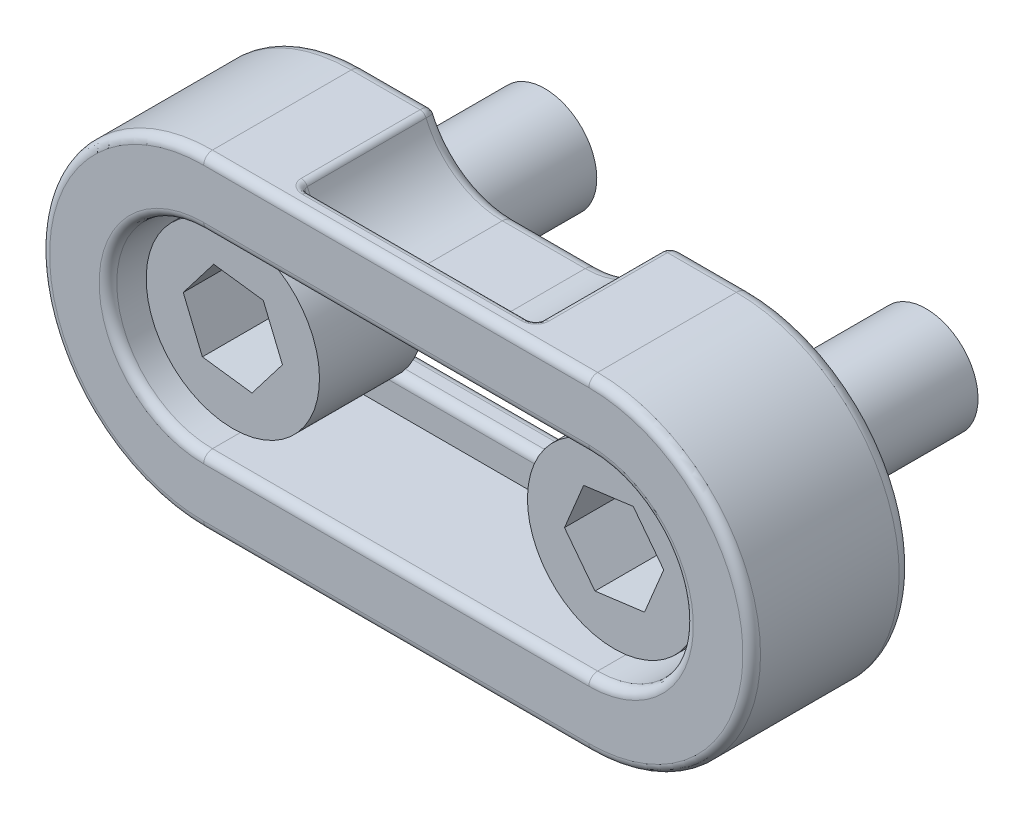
ISO-10303-21;
HEADER;
FILE_DESCRIPTION(('STEP AP214'),'2;1');
FILE_NAME('part.step','',(''),(''),'','','');
FILE_SCHEMA(('AUTOMOTIVE_DESIGN { 1 0 10303 214 1 1 1 1 }'));
ENDSEC;
DATA;
#1=APPLICATION_CONTEXT('core data for automotive mechanical design processes');
#2=APPLICATION_PROTOCOL_DEFINITION('international standard','automotive_design',2000,#1);
#3=PRODUCT_CONTEXT('',#1,'mechanical');
#4=PRODUCT('Part','Part','',(#3));
#5=PRODUCT_RELATED_PRODUCT_CATEGORY('part','',(#4));
#6=PRODUCT_DEFINITION_FORMATION('','',#4);
#7=PRODUCT_DEFINITION_CONTEXT('part definition',#1,'design');
#8=PRODUCT_DEFINITION('design','',#6,#7);
#9=PRODUCT_DEFINITION_SHAPE('','',#8);
#10=(LENGTH_UNIT() NAMED_UNIT(*) SI_UNIT(.MILLI.,.METRE.));
#11=(NAMED_UNIT(*) PLANE_ANGLE_UNIT() SI_UNIT($,.RADIAN.));
#12=(NAMED_UNIT(*) SI_UNIT($,.STERADIAN.) SOLID_ANGLE_UNIT());
#13=UNCERTAINTY_MEASURE_WITH_UNIT(LENGTH_MEASURE(1.E-05),#10,'distance_accuracy_value','');
#14=(GEOMETRIC_REPRESENTATION_CONTEXT(3) GLOBAL_UNCERTAINTY_ASSIGNED_CONTEXT((#13)) GLOBAL_UNIT_ASSIGNED_CONTEXT((#10,
#11,#12)) REPRESENTATION_CONTEXT('',''));
#15=CARTESIAN_POINT('',(0.,0.,0.));
#16=DIRECTION('',(0.,0.,1.));
#17=DIRECTION('',(1.,0.,0.));
#18=AXIS2_PLACEMENT_3D('',#15,#16,#17);
#19=CARTESIAN_POINT('',(11.,0.,-10.2982));
#20=DIRECTION('',(0.,0.,-1.));
#21=DIRECTION('',(-0.923728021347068,0.383049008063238,0.));
#22=AXIS2_PLACEMENT_3D('',#19,#20,#21);
#23=PLANE('',#22);
#24=CARTESIAN_POINT('',(11.,0.,-10.2982));
#25=DIRECTION('',(0.,0.,1.));
#26=DIRECTION('',(-0.923728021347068,0.383049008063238,0.));
#27=AXIS2_PLACEMENT_3D('',#24,#25,#26);
#28=CIRCLE('',#27,3.);
#29=CARTESIAN_POINT('',(8.2288159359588,1.14914702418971,-10.2982));
#30=VERTEX_POINT('',#29);
#31=EDGE_CURVE('E12',#30,#30,#28,.T.);
#32=ORIENTED_EDGE('',*,*,#31,.F.);
#33=EDGE_LOOP('',(#32));
#34=FACE_BOUND('',#33,.T.);
#35=ADVANCED_FACE('F57',(#34),#23,.T.);
#36=CARTESIAN_POINT('',(11.,0.,-10.2982));
#37=DIRECTION('',(0.,0.,-1.));
#38=DIRECTION('',(-0.923728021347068,0.383049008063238,0.));
#39=AXIS2_PLACEMENT_3D('',#36,#37,#38);
#40=CYLINDRICAL_SURFACE('',#39,3.);
#41=CARTESIAN_POINT('',(11.,0.,1.7018));
#42=DIRECTION('',(0.,0.,1.));
#43=DIRECTION('',(-0.923728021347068,0.383049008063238,0.));
#44=AXIS2_PLACEMENT_3D('',#41,#42,#43);
#45=CIRCLE('',#44,3.);
#46=CARTESIAN_POINT('',(8.2288159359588,1.14914702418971,1.7018));
#47=VERTEX_POINT('',#46);
#48=EDGE_CURVE('E64',#47,#47,#45,.T.);
#49=ORIENTED_EDGE('',*,*,#48,.F.);
#50=EDGE_LOOP('',(#49));
#51=FACE_BOUND('',#50,.T.);
#52=ORIENTED_EDGE('',*,*,#31,.T.);
#53=EDGE_LOOP('',(#52));
#54=FACE_BOUND('',#53,.T.);
#55=ADVANCED_FACE('F156',(#51,#54),#40,.T.);
#56=CARTESIAN_POINT('',(12.1491470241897,2.7711840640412,1.7018));
#57=DIRECTION('',(0.,0.,-1.));
#58=DIRECTION('',(-0.923728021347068,0.383049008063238,0.));
#59=AXIS2_PLACEMENT_3D('',#56,#57,#58);
#60=PLANE('',#59);
#61=CARTESIAN_POINT('',(11.,0.,1.7018));
#62=DIRECTION('',(0.,0.,1.));
#63=DIRECTION('',(-0.923728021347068,0.383049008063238,0.));
#64=AXIS2_PLACEMENT_3D('',#61,#62,#63);
#65=CIRCLE('',#64,5.);
#66=CARTESIAN_POINT('',(6.38135989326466,1.91524504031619,1.7018));
#67=VERTEX_POINT('',#66);
#68=EDGE_CURVE('E149',#67,#67,#65,.T.);
#69=ORIENTED_EDGE('',*,*,#68,.F.);
#70=EDGE_LOOP('',(#69));
#71=FACE_BOUND('',#70,.T.);
#72=ORIENTED_EDGE('',*,*,#48,.T.);
#73=EDGE_LOOP('',(#72));
#74=FACE_BOUND('',#73,.T.);
#75=ADVANCED_FACE('F154',(#71,#74),#60,.T.);
#76=CARTESIAN_POINT('',(11.,0.,-10.2982));
#77=DIRECTION('',(0.,0.,-1.));
#78=DIRECTION('',(-0.923728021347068,0.383049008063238,0.));
#79=AXIS2_PLACEMENT_3D('',#76,#77,#78);
#80=CYLINDRICAL_SURFACE('',#79,5.);
#81=CARTESIAN_POINT('',(11.,0.,7.7018));
#82=DIRECTION('',(0.,0.,1.));
#83=DIRECTION('',(-0.923728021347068,0.383049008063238,0.));
#84=AXIS2_PLACEMENT_3D('',#81,#82,#83);
#85=CIRCLE('',#84,5.);
#86=CARTESIAN_POINT('',(6.38135989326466,1.91524504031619,7.7018));
#87=VERTEX_POINT('',#86);
#88=EDGE_CURVE('E146',#87,#87,#85,.T.);
#89=ORIENTED_EDGE('',*,*,#88,.F.);
#90=EDGE_LOOP('',(#89));
#91=FACE_BOUND('',#90,.T.);
#92=ORIENTED_EDGE('',*,*,#68,.T.);
#93=EDGE_LOOP('',(#92));
#94=FACE_BOUND('',#93,.T.);
#95=ADVANCED_FACE('F174',(#91,#94),#80,.T.);
#96=CARTESIAN_POINT('',(12.9152450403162,4.61864010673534,7.7018));
#97=DIRECTION('',(0.,0.,1.));
#98=DIRECTION('',(0.923728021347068,-0.383049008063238,0.));
#99=AXIS2_PLACEMENT_3D('',#96,#97,#98);
#100=PLANE('',#99);
#101=DIRECTION('',(-0.608447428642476,0.793594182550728,0.));
#102=VECTOR('',#101,1.);
#103=CARTESIAN_POINT('',(9.89423276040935,-2.66657310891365,7.7018));
#104=LINE('',#103,#102);
#105=CARTESIAN_POINT('',(9.89423276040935,-2.66657310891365,7.7018));
#106=VERTEX_POINT('',#105);
#107=CARTESIAN_POINT('',(8.13779632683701,-0.375664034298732,7.7018));
#108=VERTEX_POINT('',#107);
#109=EDGE_CURVE('E320',#106,#108,#104,.T.);
#110=ORIENTED_EDGE('',*,*,#109,.T.);
#111=DIRECTION('',(0.383049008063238,0.923728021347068,0.));
#112=VECTOR('',#111,1.);
#113=CARTESIAN_POINT('',(8.13779632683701,-0.375664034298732,7.7018));
#114=LINE('',#113,#112);
#115=CARTESIAN_POINT('',(9.24356356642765,2.29090907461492,7.7018));
#116=VERTEX_POINT('',#115);
#117=EDGE_CURVE('E314',#108,#116,#114,.T.);
#118=ORIENTED_EDGE('',*,*,#117,.T.);
#119=DIRECTION('',(0.991496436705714,0.13013383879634,0.));
#120=VECTOR('',#119,1.);
#121=CARTESIAN_POINT('',(9.24356356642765,2.29090907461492,7.7018));
#122=LINE('',#121,#120);
#123=CARTESIAN_POINT('',(12.1057672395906,2.66657310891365,7.7018));
#124=VERTEX_POINT('',#123);
#125=EDGE_CURVE('E319',#116,#124,#122,.T.);
#126=ORIENTED_EDGE('',*,*,#125,.T.);
#127=DIRECTION('',(0.608447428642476,-0.793594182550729,0.));
#128=VECTOR('',#127,1.);
#129=CARTESIAN_POINT('',(12.1057672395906,2.66657310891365,7.7018));
#130=LINE('',#129,#128);
#131=CARTESIAN_POINT('',(13.862203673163,0.375664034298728,7.7018));
#132=VERTEX_POINT('',#131);
#133=EDGE_CURVE('E328',#124,#132,#130,.T.);
#134=ORIENTED_EDGE('',*,*,#133,.T.);
#135=DIRECTION('',(-0.383049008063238,-0.923728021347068,0.));
#136=VECTOR('',#135,1.);
#137=CARTESIAN_POINT('',(13.862203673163,0.375664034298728,7.7018));
#138=LINE('',#137,#136);
#139=CARTESIAN_POINT('',(12.7564364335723,-2.29090907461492,7.7018));
#140=VERTEX_POINT('',#139);
#141=EDGE_CURVE('E135',#132,#140,#138,.T.);
#142=ORIENTED_EDGE('',*,*,#141,.T.);
#143=DIRECTION('',(-0.991496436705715,-0.13013383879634,0.));
#144=VECTOR('',#143,1.);
#145=CARTESIAN_POINT('',(12.7564364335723,-2.29090907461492,7.7018));
#146=LINE('',#145,#144);
#147=EDGE_CURVE('E323',#140,#106,#146,.T.);
#148=ORIENTED_EDGE('',*,*,#147,.T.);
#149=EDGE_LOOP('',(#110,#118,#126,#134,#142,#148));
#150=FACE_BOUND('',#149,.T.);
#151=ORIENTED_EDGE('',*,*,#88,.T.);
#152=EDGE_LOOP('',(#151));
#153=FACE_BOUND('',#152,.T.);
#154=ADVANCED_FACE('F182',(#150,#153),#100,.T.);
#155=CARTESIAN_POINT('',(9.89423276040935,-2.66657310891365,2.7018));
#156=DIRECTION('',(-0.793594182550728,-0.608447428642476,0.));
#157=DIRECTION('',(0.608447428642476,-0.793594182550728,0.));
#158=AXIS2_PLACEMENT_3D('',#155,#156,#157);
#159=PLANE('',#158);
#160=ORIENTED_EDGE('',*,*,#109,.F.);
#161=DIRECTION('',(0.,0.,1.));
#162=VECTOR('',#161,1.);
#163=CARTESIAN_POINT('',(9.89423276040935,-2.66657310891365,2.7018));
#164=LINE('',#163,#162);
#165=CARTESIAN_POINT('',(9.89423276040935,-2.66657310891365,2.7018));
#166=VERTEX_POINT('',#165);
#167=EDGE_CURVE('E102',#166,#106,#164,.T.);
#168=ORIENTED_EDGE('',*,*,#167,.F.);
#169=DIRECTION('',(-0.608447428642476,0.793594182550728,0.));
#170=VECTOR('',#169,1.);
#171=CARTESIAN_POINT('',(9.89423276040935,-2.66657310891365,2.7018));
#172=LINE('',#171,#170);
#173=CARTESIAN_POINT('',(8.13779632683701,-0.375664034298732,2.7018));
#174=VERTEX_POINT('',#173);
#175=EDGE_CURVE('E331',#166,#174,#172,.T.);
#176=ORIENTED_EDGE('',*,*,#175,.T.);
#177=DIRECTION('',(0.,0.,1.));
#178=VECTOR('',#177,1.);
#179=CARTESIAN_POINT('',(8.13779632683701,-0.375664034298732,2.7018));
#180=LINE('',#179,#178);
#181=EDGE_CURVE('E71',#174,#108,#180,.T.);
#182=ORIENTED_EDGE('',*,*,#181,.T.);
#183=EDGE_LOOP('',(#160,#168,#176,#182));
#184=FACE_BOUND('',#183,.T.);
#185=ADVANCED_FACE('F190',(#184),#159,.F.);
#186=CARTESIAN_POINT('',(12.7564364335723,-2.29090907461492,2.7018));
#187=DIRECTION('',(0.13013383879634,-0.991496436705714,0.));
#188=DIRECTION('',(0.991496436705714,0.13013383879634,0.));
#189=AXIS2_PLACEMENT_3D('',#186,#187,#188);
#190=PLANE('',#189);
#191=ORIENTED_EDGE('',*,*,#147,.F.);
#192=DIRECTION('',(0.,0.,1.));
#193=VECTOR('',#192,1.);
#194=CARTESIAN_POINT('',(12.7564364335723,-2.29090907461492,2.7018));
#195=LINE('',#194,#193);
#196=CARTESIAN_POINT('',(12.7564364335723,-2.29090907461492,2.7018));
#197=VERTEX_POINT('',#196);
#198=EDGE_CURVE('E137',#197,#140,#195,.T.);
#199=ORIENTED_EDGE('',*,*,#198,.F.);
#200=DIRECTION('',(-0.991496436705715,-0.13013383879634,0.));
#201=VECTOR('',#200,1.);
#202=CARTESIAN_POINT('',(12.7564364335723,-2.29090907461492,2.7018));
#203=LINE('',#202,#201);
#204=EDGE_CURVE('E80',#197,#166,#203,.T.);
#205=ORIENTED_EDGE('',*,*,#204,.T.);
#206=ORIENTED_EDGE('',*,*,#167,.T.);
#207=EDGE_LOOP('',(#191,#199,#205,#206));
#208=FACE_BOUND('',#207,.T.);
#209=ADVANCED_FACE('F198',(#208),#190,.F.);
#210=CARTESIAN_POINT('',(13.862203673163,0.375664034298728,2.7018));
#211=DIRECTION('',(0.923728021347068,-0.383049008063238,0.));
#212=DIRECTION('',(0.383049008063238,0.923728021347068,0.));
#213=AXIS2_PLACEMENT_3D('',#210,#211,#212);
#214=PLANE('',#213);
#215=ORIENTED_EDGE('',*,*,#141,.F.);
#216=DIRECTION('',(0.,0.,1.));
#217=VECTOR('',#216,1.);
#218=CARTESIAN_POINT('',(13.862203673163,0.375664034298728,2.7018));
#219=LINE('',#218,#217);
#220=CARTESIAN_POINT('',(13.862203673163,0.375664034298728,2.7018));
#221=VERTEX_POINT('',#220);
#222=EDGE_CURVE('E124',#221,#132,#219,.T.);
#223=ORIENTED_EDGE('',*,*,#222,.F.);
#224=DIRECTION('',(-0.383049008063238,-0.923728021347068,0.));
#225=VECTOR('',#224,1.);
#226=CARTESIAN_POINT('',(13.862203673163,0.375664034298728,2.7018));
#227=LINE('',#226,#225);
#228=EDGE_CURVE('E127',#221,#197,#227,.T.);
#229=ORIENTED_EDGE('',*,*,#228,.T.);
#230=ORIENTED_EDGE('',*,*,#198,.T.);
#231=EDGE_LOOP('',(#215,#223,#229,#230));
#232=FACE_BOUND('',#231,.T.);
#233=ADVANCED_FACE('F133',(#232),#214,.F.);
#234=CARTESIAN_POINT('',(12.1057672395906,2.66657310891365,2.7018));
#235=DIRECTION('',(0.793594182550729,0.608447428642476,0.));
#236=DIRECTION('',(-0.608447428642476,0.793594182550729,0.));
#237=AXIS2_PLACEMENT_3D('',#234,#235,#236);
#238=PLANE('',#237);
#239=ORIENTED_EDGE('',*,*,#133,.F.);
#240=DIRECTION('',(0.,0.,1.));
#241=VECTOR('',#240,1.);
#242=CARTESIAN_POINT('',(12.1057672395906,2.66657310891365,2.7018));
#243=LINE('',#242,#241);
#244=CARTESIAN_POINT('',(12.1057672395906,2.66657310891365,2.7018));
#245=VERTEX_POINT('',#244);
#246=EDGE_CURVE('E126',#245,#124,#243,.T.);
#247=ORIENTED_EDGE('',*,*,#246,.F.);
#248=DIRECTION('',(0.608447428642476,-0.793594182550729,0.));
#249=VECTOR('',#248,1.);
#250=CARTESIAN_POINT('',(12.1057672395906,2.66657310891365,2.7018));
#251=LINE('',#250,#249);
#252=EDGE_CURVE('E119',#245,#221,#251,.T.);
#253=ORIENTED_EDGE('',*,*,#252,.T.);
#254=ORIENTED_EDGE('',*,*,#222,.T.);
#255=EDGE_LOOP('',(#239,#247,#253,#254));
#256=FACE_BOUND('',#255,.T.);
#257=ADVANCED_FACE('F122',(#256),#238,.F.);
#258=CARTESIAN_POINT('',(9.24356356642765,2.29090907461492,2.7018));
#259=DIRECTION('',(-0.13013383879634,0.991496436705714,0.));
#260=DIRECTION('',(-0.991496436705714,-0.13013383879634,0.));
#261=AXIS2_PLACEMENT_3D('',#258,#259,#260);
#262=PLANE('',#261);
#263=ORIENTED_EDGE('',*,*,#125,.F.);
#264=DIRECTION('',(0.,0.,1.));
#265=VECTOR('',#264,1.);
#266=CARTESIAN_POINT('',(9.24356356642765,2.29090907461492,2.7018));
#267=LINE('',#266,#265);
#268=CARTESIAN_POINT('',(9.24356356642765,2.29090907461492,2.7018));
#269=VERTEX_POINT('',#268);
#270=EDGE_CURVE('E140',#269,#116,#267,.T.);
#271=ORIENTED_EDGE('',*,*,#270,.F.);
#272=DIRECTION('',(0.991496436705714,0.13013383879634,0.));
#273=VECTOR('',#272,1.);
#274=CARTESIAN_POINT('',(9.24356356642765,2.29090907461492,2.7018));
#275=LINE('',#274,#273);
#276=EDGE_CURVE('E128',#269,#245,#275,.T.);
#277=ORIENTED_EDGE('',*,*,#276,.T.);
#278=ORIENTED_EDGE('',*,*,#246,.T.);
#279=EDGE_LOOP('',(#263,#271,#277,#278));
#280=FACE_BOUND('',#279,.T.);
#281=ADVANCED_FACE('F217',(#280),#262,.F.);
#282=CARTESIAN_POINT('',(8.13779632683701,-0.375664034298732,2.7018));
#283=DIRECTION('',(-0.923728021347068,0.383049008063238,0.));
#284=DIRECTION('',(0.,0.,1.));
#285=AXIS2_PLACEMENT_3D('',#282,#283,#284);
#286=PLANE('',#285);
#287=ORIENTED_EDGE('',*,*,#117,.F.);
#288=ORIENTED_EDGE('',*,*,#181,.F.);
#289=DIRECTION('',(0.383049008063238,0.923728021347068,0.));
#290=VECTOR('',#289,1.);
#291=CARTESIAN_POINT('',(8.13779632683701,-0.375664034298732,2.7018));
#292=LINE('',#291,#290);
#293=EDGE_CURVE('E110',#174,#269,#292,.T.);
#294=ORIENTED_EDGE('',*,*,#293,.T.);
#295=ORIENTED_EDGE('',*,*,#270,.T.);
#296=EDGE_LOOP('',(#287,#288,#294,#295));
#297=FACE_BOUND('',#296,.T.);
#298=ADVANCED_FACE('F224',(#297),#286,.F.);
#299=CARTESIAN_POINT('',(6.38135989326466,1.91524504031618,2.7018));
#300=DIRECTION('',(0.,0.,1.));
#301=DIRECTION('',(0.923728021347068,-0.383049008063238,0.));
#302=AXIS2_PLACEMENT_3D('',#299,#300,#301);
#303=PLANE('',#302);
#304=ORIENTED_EDGE('',*,*,#175,.F.);
#305=ORIENTED_EDGE('',*,*,#204,.F.);
#306=ORIENTED_EDGE('',*,*,#228,.F.);
#307=ORIENTED_EDGE('',*,*,#252,.F.);
#308=ORIENTED_EDGE('',*,*,#276,.F.);
#309=ORIENTED_EDGE('',*,*,#293,.F.);
#310=EDGE_LOOP('',(#304,#305,#306,#307,#308,#309));
#311=FACE_BOUND('',#310,.T.);
#312=ADVANCED_FACE('F130',(#311),#303,.T.);
#313=CLOSED_SHELL('',(#35,#55,#75,#95,#154,#185,#209,#233,#257,#281,#298,#312));
#314=MANIFOLD_SOLID_BREP('B2',#313);
#315=CARTESIAN_POINT('',(-11.,0.,-10.2982));
#316=DIRECTION('',(0.,0.,-1.));
#317=DIRECTION('',(0.923728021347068,0.383049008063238,0.));
#318=AXIS2_PLACEMENT_3D('',#315,#316,#317);
#319=PLANE('',#318);
#320=CARTESIAN_POINT('',(-11.,0.,-10.2982));
#321=DIRECTION('',(0.,0.,-1.));
#322=DIRECTION('',(0.923728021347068,0.383049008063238,0.));
#323=AXIS2_PLACEMENT_3D('',#320,#321,#322);
#324=CIRCLE('',#323,3.);
#325=CARTESIAN_POINT('',(-8.2288159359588,1.14914702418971,-10.2982));
#326=VERTEX_POINT('',#325);
#327=EDGE_CURVE('E55',#326,#326,#324,.T.);
#328=ORIENTED_EDGE('',*,*,#327,.T.);
#329=EDGE_LOOP('',(#328));
#330=FACE_BOUND('',#329,.T.);
#331=ADVANCED_FACE('F349',(#330),#319,.T.);
#332=CARTESIAN_POINT('',(-11.,0.,-10.2982));
#333=DIRECTION('',(0.,0.,-1.));
#334=DIRECTION('',(0.923728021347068,0.383049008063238,0.));
#335=AXIS2_PLACEMENT_3D('',#332,#333,#334);
#336=CYLINDRICAL_SURFACE('',#335,3.);
#337=CARTESIAN_POINT('',(-11.,0.,1.7018));
#338=DIRECTION('',(0.,0.,-1.));
#339=DIRECTION('',(0.923728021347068,0.383049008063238,0.));
#340=AXIS2_PLACEMENT_3D('',#337,#338,#339);
#341=CIRCLE('',#340,3.);
#342=CARTESIAN_POINT('',(-8.2288159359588,1.14914702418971,1.7018));
#343=VERTEX_POINT('',#342);
#344=EDGE_CURVE('E356',#343,#343,#341,.T.);
#345=ORIENTED_EDGE('',*,*,#344,.T.);
#346=EDGE_LOOP('',(#345));
#347=FACE_BOUND('',#346,.T.);
#348=ORIENTED_EDGE('',*,*,#327,.F.);
#349=EDGE_LOOP('',(#348));
#350=FACE_BOUND('',#349,.T.);
#351=ADVANCED_FACE('F463',(#347,#350),#336,.T.);
#352=CARTESIAN_POINT('',(-12.1491470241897,2.7711840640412,1.7018));
#353=DIRECTION('',(0.,0.,-1.));
#354=DIRECTION('',(0.923728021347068,0.383049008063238,0.));
#355=AXIS2_PLACEMENT_3D('',#352,#353,#354);
#356=PLANE('',#355);
#357=CARTESIAN_POINT('',(-11.,0.,1.7018));
#358=DIRECTION('',(0.,0.,-1.));
#359=DIRECTION('',(0.923728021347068,0.383049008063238,0.));
#360=AXIS2_PLACEMENT_3D('',#357,#358,#359);
#361=CIRCLE('',#360,5.);
#362=CARTESIAN_POINT('',(-6.38135989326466,1.91524504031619,1.7018));
#363=VERTEX_POINT('',#362);
#364=EDGE_CURVE('E458',#363,#363,#361,.T.);
#365=ORIENTED_EDGE('',*,*,#364,.T.);
#366=EDGE_LOOP('',(#365));
#367=FACE_BOUND('',#366,.T.);
#368=ORIENTED_EDGE('',*,*,#344,.F.);
#369=EDGE_LOOP('',(#368));
#370=FACE_BOUND('',#369,.T.);
#371=ADVANCED_FACE('F466',(#367,#370),#356,.T.);
#372=CARTESIAN_POINT('',(-11.,0.,-10.2982));
#373=DIRECTION('',(0.,0.,-1.));
#374=DIRECTION('',(0.923728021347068,0.383049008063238,0.));
#375=AXIS2_PLACEMENT_3D('',#372,#373,#374);
#376=CYLINDRICAL_SURFACE('',#375,5.);
#377=CARTESIAN_POINT('',(-11.,0.,7.7018));
#378=DIRECTION('',(0.,0.,-1.));
#379=DIRECTION('',(0.923728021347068,0.383049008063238,0.));
#380=AXIS2_PLACEMENT_3D('',#377,#378,#379);
#381=CIRCLE('',#380,5.);
#382=CARTESIAN_POINT('',(-6.38135989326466,1.91524504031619,7.7018));
#383=VERTEX_POINT('',#382);
#384=EDGE_CURVE('E450',#383,#383,#381,.T.);
#385=ORIENTED_EDGE('',*,*,#384,.T.);
#386=EDGE_LOOP('',(#385));
#387=FACE_BOUND('',#386,.T.);
#388=ORIENTED_EDGE('',*,*,#364,.F.);
#389=EDGE_LOOP('',(#388));
#390=FACE_BOUND('',#389,.T.);
#391=ADVANCED_FACE('F468',(#387,#390),#376,.T.);
#392=CARTESIAN_POINT('',(-12.9152450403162,4.61864010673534,7.7018));
#393=DIRECTION('',(0.,0.,1.));
#394=DIRECTION('',(-0.923728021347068,-0.383049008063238,0.));
#395=AXIS2_PLACEMENT_3D('',#392,#393,#394);
#396=PLANE('',#395);
#397=DIRECTION('',(0.608447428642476,0.793594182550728,0.));
#398=VECTOR('',#397,1.);
#399=CARTESIAN_POINT('',(-9.89423276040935,-2.66657310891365,7.7018));
#400=LINE('',#399,#398);
#401=CARTESIAN_POINT('',(-9.89423276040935,-2.66657310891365,7.7018));
#402=VERTEX_POINT('',#401);
#403=CARTESIAN_POINT('',(-8.13779632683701,-0.375664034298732,7.7018));
#404=VERTEX_POINT('',#403);
#405=EDGE_CURVE('E363',#402,#404,#400,.T.);
#406=ORIENTED_EDGE('',*,*,#405,.F.);
#407=DIRECTION('',(0.991496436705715,-0.13013383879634,0.));
#408=VECTOR('',#407,1.);
#409=CARTESIAN_POINT('',(-12.7564364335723,-2.29090907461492,7.7018));
#410=LINE('',#409,#408);
#411=CARTESIAN_POINT('',(-12.7564364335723,-2.29090907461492,7.7018));
#412=VERTEX_POINT('',#411);
#413=EDGE_CURVE('E446',#412,#402,#410,.T.);
#414=ORIENTED_EDGE('',*,*,#413,.F.);
#415=DIRECTION('',(0.383049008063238,-0.923728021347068,0.));
#416=VECTOR('',#415,1.);
#417=CARTESIAN_POINT('',(-13.862203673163,0.375664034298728,7.7018));
#418=LINE('',#417,#416);
#419=CARTESIAN_POINT('',(-13.862203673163,0.375664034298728,7.7018));
#420=VERTEX_POINT('',#419);
#421=EDGE_CURVE('E444',#420,#412,#418,.T.);
#422=ORIENTED_EDGE('',*,*,#421,.F.);
#423=DIRECTION('',(-0.608447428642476,-0.793594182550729,0.));
#424=VECTOR('',#423,1.);
#425=CARTESIAN_POINT('',(-12.1057672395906,2.66657310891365,7.7018));
#426=LINE('',#425,#424);
#427=CARTESIAN_POINT('',(-12.1057672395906,2.66657310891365,7.7018));
#428=VERTEX_POINT('',#427);
#429=EDGE_CURVE('E411',#428,#420,#426,.T.);
#430=ORIENTED_EDGE('',*,*,#429,.F.);
#431=DIRECTION('',(-0.991496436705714,0.13013383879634,0.));
#432=VECTOR('',#431,1.);
#433=CARTESIAN_POINT('',(-9.24356356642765,2.29090907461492,7.7018));
#434=LINE('',#433,#432);
#435=CARTESIAN_POINT('',(-9.24356356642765,2.29090907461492,7.7018));
#436=VERTEX_POINT('',#435);
#437=EDGE_CURVE('E440',#436,#428,#434,.T.);
#438=ORIENTED_EDGE('',*,*,#437,.F.);
#439=DIRECTION('',(-0.383049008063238,0.923728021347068,0.));
#440=VECTOR('',#439,1.);
#441=CARTESIAN_POINT('',(-8.13779632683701,-0.375664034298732,7.7018));
#442=LINE('',#441,#440);
#443=EDGE_CURVE('E437',#404,#436,#442,.T.);
#444=ORIENTED_EDGE('',*,*,#443,.F.);
#445=EDGE_LOOP('',(#406,#414,#422,#430,#438,#444));
#446=FACE_BOUND('',#445,.T.);
#447=ORIENTED_EDGE('',*,*,#384,.F.);
#448=EDGE_LOOP('',(#447));
#449=FACE_BOUND('',#448,.T.);
#450=ADVANCED_FACE('F475',(#446,#449),#396,.T.);
#451=CARTESIAN_POINT('',(-9.89423276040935,-2.66657310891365,2.7018));
#452=DIRECTION('',(0.793594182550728,-0.608447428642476,0.));
#453=DIRECTION('',(-0.608447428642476,-0.793594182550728,0.));
#454=AXIS2_PLACEMENT_3D('',#451,#452,#453);
#455=PLANE('',#454);
#456=ORIENTED_EDGE('',*,*,#405,.T.);
#457=DIRECTION('',(0.,0.,1.));
#458=VECTOR('',#457,1.);
#459=CARTESIAN_POINT('',(-8.13779632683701,-0.375664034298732,2.7018));
#460=LINE('',#459,#458);
#461=CARTESIAN_POINT('',(-8.13779632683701,-0.375664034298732,2.7018));
#462=VERTEX_POINT('',#461);
#463=EDGE_CURVE('E393',#462,#404,#460,.T.);
#464=ORIENTED_EDGE('',*,*,#463,.F.);
#465=DIRECTION('',(0.608447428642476,0.793594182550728,0.));
#466=VECTOR('',#465,1.);
#467=CARTESIAN_POINT('',(-9.89423276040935,-2.66657310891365,2.7018));
#468=LINE('',#467,#466);
#469=CARTESIAN_POINT('',(-9.89423276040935,-2.66657310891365,2.7018));
#470=VERTEX_POINT('',#469);
#471=EDGE_CURVE('E448',#470,#462,#468,.T.);
#472=ORIENTED_EDGE('',*,*,#471,.F.);
#473=DIRECTION('',(0.,0.,1.));
#474=VECTOR('',#473,1.);
#475=CARTESIAN_POINT('',(-9.89423276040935,-2.66657310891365,2.7018));
#476=LINE('',#475,#474);
#477=EDGE_CURVE('E371',#470,#402,#476,.T.);
#478=ORIENTED_EDGE('',*,*,#477,.T.);
#479=EDGE_LOOP('',(#456,#464,#472,#478));
#480=FACE_BOUND('',#479,.T.);
#481=ADVANCED_FACE('F509',(#480),#455,.F.);
#482=CARTESIAN_POINT('',(-12.7564364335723,-2.29090907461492,2.7018));
#483=DIRECTION('',(-0.13013383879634,-0.991496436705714,0.));
#484=DIRECTION('',(-0.991496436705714,0.13013383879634,0.));
#485=AXIS2_PLACEMENT_3D('',#482,#483,#484);
#486=PLANE('',#485);
#487=ORIENTED_EDGE('',*,*,#413,.T.);
#488=ORIENTED_EDGE('',*,*,#477,.F.);
#489=DIRECTION('',(0.991496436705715,-0.13013383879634,0.));
#490=VECTOR('',#489,1.);
#491=CARTESIAN_POINT('',(-12.7564364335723,-2.29090907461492,2.7018));
#492=LINE('',#491,#490);
#493=CARTESIAN_POINT('',(-12.7564364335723,-2.29090907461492,2.7018));
#494=VERTEX_POINT('',#493);
#495=EDGE_CURVE('E423',#494,#470,#492,.T.);
#496=ORIENTED_EDGE('',*,*,#495,.F.);
#497=DIRECTION('',(0.,0.,1.));
#498=VECTOR('',#497,1.);
#499=CARTESIAN_POINT('',(-12.7564364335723,-2.29090907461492,2.7018));
#500=LINE('',#499,#498);
#501=EDGE_CURVE('E415',#494,#412,#500,.T.);
#502=ORIENTED_EDGE('',*,*,#501,.T.);
#503=EDGE_LOOP('',(#487,#488,#496,#502));
#504=FACE_BOUND('',#503,.T.);
#505=ADVANCED_FACE('F520',(#504),#486,.F.);
#506=CARTESIAN_POINT('',(-13.862203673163,0.375664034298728,2.7018));
#507=DIRECTION('',(-0.923728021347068,-0.383049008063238,0.));
#508=DIRECTION('',(-0.383049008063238,0.923728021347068,0.));
#509=AXIS2_PLACEMENT_3D('',#506,#507,#508);
#510=PLANE('',#509);
#511=ORIENTED_EDGE('',*,*,#421,.T.);
#512=ORIENTED_EDGE('',*,*,#501,.F.);
#513=DIRECTION('',(0.383049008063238,-0.923728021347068,0.));
#514=VECTOR('',#513,1.);
#515=CARTESIAN_POINT('',(-13.862203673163,0.375664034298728,2.7018));
#516=LINE('',#515,#514);
#517=CARTESIAN_POINT('',(-13.862203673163,0.375664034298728,2.7018));
#518=VERTEX_POINT('',#517);
#519=EDGE_CURVE('E419',#518,#494,#516,.T.);
#520=ORIENTED_EDGE('',*,*,#519,.F.);
#521=DIRECTION('',(0.,0.,1.));
#522=VECTOR('',#521,1.);
#523=CARTESIAN_POINT('',(-13.862203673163,0.375664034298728,2.7018));
#524=LINE('',#523,#522);
#525=EDGE_CURVE('E404',#518,#420,#524,.T.);
#526=ORIENTED_EDGE('',*,*,#525,.T.);
#527=EDGE_LOOP('',(#511,#512,#520,#526));
#528=FACE_BOUND('',#527,.T.);
#529=ADVANCED_FACE('F420',(#528),#510,.F.);
#530=CARTESIAN_POINT('',(-12.1057672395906,2.66657310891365,2.7018));
#531=DIRECTION('',(-0.793594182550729,0.608447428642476,0.));
#532=DIRECTION('',(0.608447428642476,0.793594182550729,0.));
#533=AXIS2_PLACEMENT_3D('',#530,#531,#532);
#534=PLANE('',#533);
#535=ORIENTED_EDGE('',*,*,#429,.T.);
#536=ORIENTED_EDGE('',*,*,#525,.F.);
#537=DIRECTION('',(-0.608447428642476,-0.793594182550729,0.));
#538=VECTOR('',#537,1.);
#539=CARTESIAN_POINT('',(-12.1057672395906,2.66657310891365,2.7018));
#540=LINE('',#539,#538);
#541=CARTESIAN_POINT('',(-12.1057672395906,2.66657310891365,2.7018));
#542=VERTEX_POINT('',#541);
#543=EDGE_CURVE('E408',#542,#518,#540,.T.);
#544=ORIENTED_EDGE('',*,*,#543,.F.);
#545=DIRECTION('',(0.,0.,1.));
#546=VECTOR('',#545,1.);
#547=CARTESIAN_POINT('',(-12.1057672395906,2.66657310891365,2.7018));
#548=LINE('',#547,#546);
#549=EDGE_CURVE('E416',#542,#428,#548,.T.);
#550=ORIENTED_EDGE('',*,*,#549,.T.);
#551=EDGE_LOOP('',(#535,#536,#544,#550));
#552=FACE_BOUND('',#551,.T.);
#553=ADVANCED_FACE('F406',(#552),#534,.F.);
#554=CARTESIAN_POINT('',(-9.24356356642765,2.29090907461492,2.7018));
#555=DIRECTION('',(0.13013383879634,0.991496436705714,0.));
#556=DIRECTION('',(0.991496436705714,-0.13013383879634,0.));
#557=AXIS2_PLACEMENT_3D('',#554,#555,#556);
#558=PLANE('',#557);
#559=ORIENTED_EDGE('',*,*,#437,.T.);
#560=ORIENTED_EDGE('',*,*,#549,.F.);
#561=DIRECTION('',(-0.991496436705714,0.13013383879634,0.));
#562=VECTOR('',#561,1.);
#563=CARTESIAN_POINT('',(-9.24356356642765,2.29090907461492,2.7018));
#564=LINE('',#563,#562);
#565=CARTESIAN_POINT('',(-9.24356356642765,2.29090907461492,2.7018));
#566=VERTEX_POINT('',#565);
#567=EDGE_CURVE('E429',#566,#542,#564,.T.);
#568=ORIENTED_EDGE('',*,*,#567,.F.);
#569=DIRECTION('',(0.,0.,1.));
#570=VECTOR('',#569,1.);
#571=CARTESIAN_POINT('',(-9.24356356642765,2.29090907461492,2.7018));
#572=LINE('',#571,#570);
#573=EDGE_CURVE('E453',#566,#436,#572,.T.);
#574=ORIENTED_EDGE('',*,*,#573,.T.);
#575=EDGE_LOOP('',(#559,#560,#568,#574));
#576=FACE_BOUND('',#575,.T.);
#577=ADVANCED_FACE('F548',(#576),#558,.F.);
#578=CARTESIAN_POINT('',(-8.13779632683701,-0.375664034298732,2.7018));
#579=DIRECTION('',(0.923728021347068,0.383049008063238,0.));
#580=DIRECTION('',(0.,0.,1.));
#581=AXIS2_PLACEMENT_3D('',#578,#579,#580);
#582=PLANE('',#581);
#583=ORIENTED_EDGE('',*,*,#443,.T.);
#584=ORIENTED_EDGE('',*,*,#573,.F.);
#585=DIRECTION('',(-0.383049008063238,0.923728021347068,0.));
#586=VECTOR('',#585,1.);
#587=CARTESIAN_POINT('',(-8.13779632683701,-0.375664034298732,2.7018));
#588=LINE('',#587,#586);
#589=EDGE_CURVE('E431',#462,#566,#588,.T.);
#590=ORIENTED_EDGE('',*,*,#589,.F.);
#591=ORIENTED_EDGE('',*,*,#463,.T.);
#592=EDGE_LOOP('',(#583,#584,#590,#591));
#593=FACE_BOUND('',#592,.T.);
#594=ADVANCED_FACE('F558',(#593),#582,.F.);
#595=CARTESIAN_POINT('',(-6.38135989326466,1.91524504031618,2.7018));
#596=DIRECTION('',(0.,0.,1.));
#597=DIRECTION('',(-0.923728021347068,-0.383049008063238,0.));
#598=AXIS2_PLACEMENT_3D('',#595,#596,#597);
#599=PLANE('',#598);
#600=ORIENTED_EDGE('',*,*,#471,.T.);
#601=ORIENTED_EDGE('',*,*,#589,.T.);
#602=ORIENTED_EDGE('',*,*,#567,.T.);
#603=ORIENTED_EDGE('',*,*,#543,.T.);
#604=ORIENTED_EDGE('',*,*,#519,.T.);
#605=ORIENTED_EDGE('',*,*,#495,.T.);
#606=EDGE_LOOP('',(#600,#601,#602,#603,#604,#605));
#607=FACE_BOUND('',#606,.T.);
#608=ADVANCED_FACE('F426',(#607),#599,.T.);
#609=CLOSED_SHELL('',(#331,#351,#371,#391,#450,#481,#505,#529,#553,#577,#594,#608));
#610=MANIFOLD_SOLID_BREP('B6',#609);
#611=CARTESIAN_POINT('',(0.,3.54964999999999,1.7018));
#612=DIRECTION('',(0.,-1.,0.));
#613=DIRECTION('',(0.,0.,-1.));
#614=AXIS2_PLACEMENT_3D('',#611,#612,#613);
#615=PLANE('',#614);
#616=DIRECTION('',(0.,0.,-1.));
#617=VECTOR('',#616,1.);
#618=CARTESIAN_POINT('',(11.1125,3.54964999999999,1.7018));
#619=LINE('',#618,#617);
#620=CARTESIAN_POINT('',(11.1125,3.54964999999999,1.1938));
#621=VERTEX_POINT('',#620);
#622=CARTESIAN_POINT('',(11.1125,3.54964999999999,0.508));
#623=VERTEX_POINT('',#622);
#624=EDGE_CURVE('E938',#621,#623,#619,.T.);
#625=ORIENTED_EDGE('',*,*,#624,.F.);
#626=DIRECTION('',(-1.,0.,0.));
#627=VECTOR('',#626,1.);
#628=CARTESIAN_POINT('',(0.,3.54964999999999,1.1938));
#629=LINE('',#628,#627);
#630=CARTESIAN_POINT('',(-11.1125,3.54964999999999,1.1938));
#631=VERTEX_POINT('',#630);
#632=EDGE_CURVE('E976',#621,#631,#629,.T.);
#633=ORIENTED_EDGE('',*,*,#632,.T.);
#634=DIRECTION('',(0.,0.,-1.));
#635=VECTOR('',#634,1.);
#636=CARTESIAN_POINT('',(-11.1125,3.54964999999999,1.7018));
#637=LINE('',#636,#635);
#638=CARTESIAN_POINT('',(-11.1125,3.54964999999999,0.508));
#639=VERTEX_POINT('',#638);
#640=EDGE_CURVE('E926',#631,#639,#637,.T.);
#641=ORIENTED_EDGE('',*,*,#640,.T.);
#642=DIRECTION('',(-1.,0.,0.));
#643=VECTOR('',#642,1.);
#644=CARTESIAN_POINT('',(11.1125,3.54964999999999,0.508));
#645=LINE('',#644,#643);
#646=EDGE_CURVE('E973',#639,#623,#645,.F.);
#647=ORIENTED_EDGE('',*,*,#646,.T.);
#648=EDGE_LOOP('',(#625,#633,#641,#647));
#649=FACE_BOUND('',#648,.T.);
#650=ADVANCED_FACE('F609',(#649),#615,.T.);
#651=CARTESIAN_POINT('',(11.1125,0.,1.7018));
#652=DIRECTION('',(0.,0.,-1.));
#653=DIRECTION('',(-1.,0.,0.));
#654=AXIS2_PLACEMENT_3D('',#651,#652,#653);
#655=CYLINDRICAL_SURFACE('',#654,3.54965);
#656=DIRECTION('',(0.,0.,-1.));
#657=VECTOR('',#656,1.);
#658=CARTESIAN_POINT('',(11.1125,-3.54965,1.7018));
#659=LINE('',#658,#657);
#660=CARTESIAN_POINT('',(11.1125,-3.54965,1.1938));
#661=VERTEX_POINT('',#660);
#662=CARTESIAN_POINT('',(11.1125,-3.54965,0.508));
#663=VERTEX_POINT('',#662);
#664=EDGE_CURVE('E935',#661,#663,#659,.T.);
#665=ORIENTED_EDGE('',*,*,#664,.F.);
#666=CARTESIAN_POINT('',(11.1125,0.,1.1938));
#667=DIRECTION('',(0.,0.,1.));
#668=DIRECTION('',(1.,0.,0.));
#669=AXIS2_PLACEMENT_3D('',#666,#667,#668);
#670=CIRCLE('',#669,3.54965);
#671=EDGE_CURVE('E1010',#661,#621,#670,.T.);
#672=ORIENTED_EDGE('',*,*,#671,.T.);
#673=ORIENTED_EDGE('',*,*,#624,.T.);
#674=CARTESIAN_POINT('',(11.1125,0.,0.508));
#675=DIRECTION('',(0.,0.,1.));
#676=DIRECTION('',(1.,0.,0.));
#677=AXIS2_PLACEMENT_3D('',#674,#675,#676);
#678=CIRCLE('',#677,3.54965);
#679=EDGE_CURVE('E1008',#623,#663,#678,.F.);
#680=ORIENTED_EDGE('',*,*,#679,.T.);
#681=EDGE_LOOP('',(#665,#672,#673,#680));
#682=FACE_BOUND('',#681,.T.);
#683=ADVANCED_FACE('F1408',(#682),#655,.F.);
#684=CARTESIAN_POINT('',(0.,-3.54965,1.7018));
#685=DIRECTION('',(0.,-1.,0.));
#686=DIRECTION('',(0.,0.,-1.));
#687=AXIS2_PLACEMENT_3D('',#684,#685,#686);
#688=PLANE('',#687);
#689=DIRECTION('',(0.,0.,-1.));
#690=VECTOR('',#689,1.);
#691=CARTESIAN_POINT('',(-11.1125,-3.54965,1.7018));
#692=LINE('',#691,#690);
#693=CARTESIAN_POINT('',(-11.1125,-3.54965,1.1938));
#694=VERTEX_POINT('',#693);
#695=CARTESIAN_POINT('',(-11.1125,-3.54965,0.508));
#696=VERTEX_POINT('',#695);
#697=EDGE_CURVE('E932',#694,#696,#692,.T.);
#698=ORIENTED_EDGE('',*,*,#697,.F.);
#699=DIRECTION('',(-1.,0.,0.));
#700=VECTOR('',#699,1.);
#701=CARTESIAN_POINT('',(11.1125,-3.54965,1.1938));
#702=LINE('',#701,#700);
#703=EDGE_CURVE('E994',#694,#661,#702,.F.);
#704=ORIENTED_EDGE('',*,*,#703,.T.);
#705=ORIENTED_EDGE('',*,*,#664,.T.);
#706=DIRECTION('',(-1.,0.,0.));
#707=VECTOR('',#706,1.);
#708=CARTESIAN_POINT('',(0.,-3.54965,0.508));
#709=LINE('',#708,#707);
#710=EDGE_CURVE('E992',#663,#696,#709,.T.);
#711=ORIENTED_EDGE('',*,*,#710,.T.);
#712=EDGE_LOOP('',(#698,#704,#705,#711));
#713=FACE_BOUND('',#712,.T.);
#714=ADVANCED_FACE('F1414',(#713),#688,.F.);
#715=CARTESIAN_POINT('',(-11.1125,0.,1.7018));
#716=DIRECTION('',(0.,0.,-1.));
#717=DIRECTION('',(-1.,0.,0.));
#718=AXIS2_PLACEMENT_3D('',#715,#716,#717);
#719=CYLINDRICAL_SURFACE('',#718,3.54965);
#720=ORIENTED_EDGE('',*,*,#640,.F.);
#721=CARTESIAN_POINT('',(-11.1125,0.,1.1938));
#722=DIRECTION('',(0.,0.,1.));
#723=DIRECTION('',(1.,0.,0.));
#724=AXIS2_PLACEMENT_3D('',#721,#722,#723);
#725=CIRCLE('',#724,3.54965);
#726=EDGE_CURVE('E990',#631,#694,#725,.T.);
#727=ORIENTED_EDGE('',*,*,#726,.T.);
#728=ORIENTED_EDGE('',*,*,#697,.T.);
#729=CARTESIAN_POINT('',(-11.1125,0.,0.508));
#730=DIRECTION('',(0.,0.,1.));
#731=DIRECTION('',(1.,0.,0.));
#732=AXIS2_PLACEMENT_3D('',#729,#730,#731);
#733=CIRCLE('',#732,3.54965);
#734=EDGE_CURVE('E988',#696,#639,#733,.F.);
#735=ORIENTED_EDGE('',*,*,#734,.T.);
#736=EDGE_LOOP('',(#720,#727,#728,#735));
#737=FACE_BOUND('',#736,.T.);
#738=ADVANCED_FACE('F1494',(#737),#719,.F.);
#739=CARTESIAN_POINT('',(0.,0.,1.7018));
#740=DIRECTION('',(0.,0.,1.));
#741=DIRECTION('',(1.,0.,0.));
#742=AXIS2_PLACEMENT_3D('',#739,#740,#741);
#743=PLANE('',#742);
#744=CARTESIAN_POINT('',(-11.1125,0.,1.7018));
#745=DIRECTION('',(0.,0.,1.));
#746=DIRECTION('',(1.,0.,0.));
#747=AXIS2_PLACEMENT_3D('',#744,#745,#746);
#748=CIRCLE('',#747,4.05765);
#749=CARTESIAN_POINT('',(-11.1125,-4.05765,1.7018));
#750=VERTEX_POINT('',#749);
#751=CARTESIAN_POINT('',(-11.1125,4.05765,1.7018));
#752=VERTEX_POINT('',#751);
#753=EDGE_CURVE('E983',#750,#752,#748,.F.);
#754=ORIENTED_EDGE('',*,*,#753,.T.);
#755=DIRECTION('',(-1.,0.,0.));
#756=VECTOR('',#755,1.);
#757=CARTESIAN_POINT('',(0.,4.05764999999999,1.7018));
#758=LINE('',#757,#756);
#759=CARTESIAN_POINT('',(11.1125,4.05765,1.7018));
#760=VERTEX_POINT('',#759);
#761=EDGE_CURVE('E985',#752,#760,#758,.F.);
#762=ORIENTED_EDGE('',*,*,#761,.T.);
#763=CARTESIAN_POINT('',(11.1125,0.,1.7018));
#764=DIRECTION('',(0.,0.,1.));
#765=DIRECTION('',(1.,0.,0.));
#766=AXIS2_PLACEMENT_3D('',#763,#764,#765);
#767=CIRCLE('',#766,4.05765);
#768=CARTESIAN_POINT('',(11.1125,-4.05765,1.7018));
#769=VERTEX_POINT('',#768);
#770=EDGE_CURVE('E979',#760,#769,#767,.F.);
#771=ORIENTED_EDGE('',*,*,#770,.T.);
#772=DIRECTION('',(-1.,0.,0.));
#773=VECTOR('',#772,1.);
#774=CARTESIAN_POINT('',(-11.1125,-4.05765,1.7018));
#775=LINE('',#774,#773);
#776=EDGE_CURVE('E981',#769,#750,#775,.T.);
#777=ORIENTED_EDGE('',*,*,#776,.T.);
#778=EDGE_LOOP('',(#754,#762,#771,#777));
#779=FACE_BOUND('',#778,.T.);
#780=DIRECTION('',(1.,0.,0.));
#781=VECTOR('',#780,1.);
#782=CARTESIAN_POINT('',(0.,-5.5245,1.7018));
#783=LINE('',#782,#781);
#784=CARTESIAN_POINT('',(-11.1125,-5.5245,1.7018));
#785=VERTEX_POINT('',#784);
#786=CARTESIAN_POINT('',(11.1125,-5.5245,1.7018));
#787=VERTEX_POINT('',#786);
#788=EDGE_CURVE('E920',#785,#787,#783,.T.);
#789=ORIENTED_EDGE('',*,*,#788,.T.);
#790=CARTESIAN_POINT('',(11.1125,0.,1.7018));
#791=DIRECTION('',(0.,0.,1.));
#792=DIRECTION('',(1.,0.,0.));
#793=AXIS2_PLACEMENT_3D('',#790,#791,#792);
#794=CIRCLE('',#793,5.5245);
#795=CARTESIAN_POINT('',(11.1125,5.5245,1.7018));
#796=VERTEX_POINT('',#795);
#797=EDGE_CURVE('E903',#787,#796,#794,.T.);
#798=ORIENTED_EDGE('',*,*,#797,.T.);
#799=DIRECTION('',(1.,0.,0.));
#800=VECTOR('',#799,1.);
#801=CARTESIAN_POINT('',(0.,5.5245,1.7018));
#802=LINE('',#801,#800);
#803=CARTESIAN_POINT('',(-11.1125,5.5245,1.7018));
#804=VERTEX_POINT('',#803);
#805=EDGE_CURVE('E917',#804,#796,#802,.T.);
#806=ORIENTED_EDGE('',*,*,#805,.F.);
#807=CARTESIAN_POINT('',(-11.1125,0.,1.7018));
#808=DIRECTION('',(0.,0.,1.));
#809=DIRECTION('',(1.,0.,0.));
#810=AXIS2_PLACEMENT_3D('',#807,#808,#809);
#811=CIRCLE('',#810,5.5245);
#812=EDGE_CURVE('E924',#804,#785,#811,.T.);
#813=ORIENTED_EDGE('',*,*,#812,.T.);
#814=EDGE_LOOP('',(#789,#798,#806,#813));
#815=FACE_BOUND('',#814,.T.);
#816=ADVANCED_FACE('F915',(#779,#815),#743,.T.);
#817=CARTESIAN_POINT('',(0.,0.,0.));
#818=DIRECTION('',(0.,0.,1.));
#819=DIRECTION('',(1.,0.,0.));
#820=AXIS2_PLACEMENT_3D('',#817,#818,#819);
#821=PLANE('',#820);
#822=CARTESIAN_POINT('',(-11.1125,0.,0.));
#823=DIRECTION('',(0.,0.,1.));
#824=DIRECTION('',(1.,0.,0.));
#825=AXIS2_PLACEMENT_3D('',#822,#823,#824);
#826=CIRCLE('',#825,8.636);
#827=CARTESIAN_POINT('',(-11.1125,-8.636,0.));
#828=VERTEX_POINT('',#827);
#829=CARTESIAN_POINT('',(-11.1125,8.636,0.));
#830=VERTEX_POINT('',#829);
#831=EDGE_CURVE('E1210',#828,#830,#826,.F.);
#832=ORIENTED_EDGE('',*,*,#831,.T.);
#833=DIRECTION('',(1.,0.,0.));
#834=VECTOR('',#833,1.);
#835=CARTESIAN_POINT('',(-7.13950488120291,8.636,0.));
#836=LINE('',#835,#834);
#837=CARTESIAN_POINT('',(-7.3875949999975,8.636,0.));
#838=VERTEX_POINT('',#837);
#839=EDGE_CURVE('E2275',#830,#838,#836,.T.);
#840=ORIENTED_EDGE('',*,*,#839,.T.);
#841=CARTESIAN_POINT('',(-2.3876,10.9855,0.));
#842=DIRECTION('',(0.,0.,1.));
#843=DIRECTION('',(1.,0.,0.));
#844=AXIS2_PLACEMENT_3D('',#841,#842,#843);
#845=CIRCLE('',#844,5.5245);
#846=CARTESIAN_POINT('',(-2.3876,5.461,0.));
#847=VERTEX_POINT('',#846);
#848=EDGE_CURVE('E2273',#838,#847,#845,.T.);
#849=ORIENTED_EDGE('',*,*,#848,.T.);
#850=DIRECTION('',(-1.,0.,0.));
#851=VECTOR('',#850,1.);
#852=CARTESIAN_POINT('',(0.,5.461,0.));
#853=LINE('',#852,#851);
#854=CARTESIAN_POINT('',(2.3876,5.461,0.));
#855=VERTEX_POINT('',#854);
#856=EDGE_CURVE('E2271',#847,#855,#853,.F.);
#857=ORIENTED_EDGE('',*,*,#856,.T.);
#858=CARTESIAN_POINT('',(2.3876,10.9855,0.));
#859=DIRECTION('',(0.,0.,1.));
#860=DIRECTION('',(1.,0.,0.));
#861=AXIS2_PLACEMENT_3D('',#858,#859,#860);
#862=CIRCLE('',#861,5.5245);
#863=CARTESIAN_POINT('',(7.3875949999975,8.636,0.));
#864=VERTEX_POINT('',#863);
#865=EDGE_CURVE('E2269',#855,#864,#862,.T.);
#866=ORIENTED_EDGE('',*,*,#865,.T.);
#867=DIRECTION('',(1.,0.,0.));
#868=VECTOR('',#867,1.);
#869=CARTESIAN_POINT('',(11.1125,8.636,0.));
#870=LINE('',#869,#868);
#871=CARTESIAN_POINT('',(11.1125,8.636,0.));
#872=VERTEX_POINT('',#871);
#873=EDGE_CURVE('E2267',#864,#872,#870,.T.);
#874=ORIENTED_EDGE('',*,*,#873,.T.);
#875=CARTESIAN_POINT('',(11.1125,0.,0.));
#876=DIRECTION('',(0.,0.,1.));
#877=DIRECTION('',(1.,0.,0.));
#878=AXIS2_PLACEMENT_3D('',#875,#876,#877);
#879=CIRCLE('',#878,8.636);
#880=CARTESIAN_POINT('',(11.1125,-8.636,0.));
#881=VERTEX_POINT('',#880);
#882=EDGE_CURVE('E2265',#872,#881,#879,.F.);
#883=ORIENTED_EDGE('',*,*,#882,.T.);
#884=DIRECTION('',(1.,0.,0.));
#885=VECTOR('',#884,1.);
#886=CARTESIAN_POINT('',(0.,-8.636,0.));
#887=LINE('',#886,#885);
#888=CARTESIAN_POINT('',(7.3875949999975,-8.636,0.));
#889=VERTEX_POINT('',#888);
#890=EDGE_CURVE('E2260',#881,#889,#887,.F.);
#891=ORIENTED_EDGE('',*,*,#890,.T.);
#892=CARTESIAN_POINT('',(2.3876,-10.9855,0.));
#893=DIRECTION('',(0.,0.,1.));
#894=DIRECTION('',(1.,0.,0.));
#895=AXIS2_PLACEMENT_3D('',#892,#893,#894);
#896=CIRCLE('',#895,5.5245);
#897=CARTESIAN_POINT('',(2.3876,-5.461,0.));
#898=VERTEX_POINT('',#897);
#899=EDGE_CURVE('E2257',#889,#898,#896,.T.);
#900=ORIENTED_EDGE('',*,*,#899,.T.);
#901=DIRECTION('',(1.,0.,0.));
#902=VECTOR('',#901,1.);
#903=CARTESIAN_POINT('',(0.,-5.461,0.));
#904=LINE('',#903,#902);
#905=CARTESIAN_POINT('',(-2.3876,-5.461,0.));
#906=VERTEX_POINT('',#905);
#907=EDGE_CURVE('E2255',#898,#906,#904,.F.);
#908=ORIENTED_EDGE('',*,*,#907,.T.);
#909=CARTESIAN_POINT('',(-2.3876,-10.9855,0.));
#910=DIRECTION('',(0.,0.,1.));
#911=DIRECTION('',(1.,0.,0.));
#912=AXIS2_PLACEMENT_3D('',#909,#910,#911);
#913=CIRCLE('',#912,5.5245);
#914=CARTESIAN_POINT('',(-7.3875949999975,-8.636,0.));
#915=VERTEX_POINT('',#914);
#916=EDGE_CURVE('E2258',#906,#915,#913,.T.);
#917=ORIENTED_EDGE('',*,*,#916,.T.);
#918=DIRECTION('',(1.,0.,0.));
#919=VECTOR('',#918,1.);
#920=CARTESIAN_POINT('',(0.,-8.636,0.));
#921=LINE('',#920,#919);
#922=EDGE_CURVE('E2220',#915,#828,#921,.F.);
#923=ORIENTED_EDGE('',*,*,#922,.T.);
#924=EDGE_LOOP('',(#832,#840,#849,#857,#866,#874,#883,#891,#900,#908,#917,#923));
#925=FACE_BOUND('',#924,.T.);
#926=CARTESIAN_POINT('',(11.1125,0.,0.));
#927=DIRECTION('',(0.,0.,1.));
#928=DIRECTION('',(1.,0.,0.));
#929=AXIS2_PLACEMENT_3D('',#926,#927,#928);
#930=CIRCLE('',#929,4.05765);
#931=CARTESIAN_POINT('',(11.1125,-4.05765,0.));
#932=VERTEX_POINT('',#931);
#933=CARTESIAN_POINT('',(11.1125,4.05765,0.));
#934=VERTEX_POINT('',#933);
#935=EDGE_CURVE('E996',#932,#934,#930,.T.);
#936=ORIENTED_EDGE('',*,*,#935,.T.);
#937=DIRECTION('',(-1.,0.,0.));
#938=VECTOR('',#937,1.);
#939=CARTESIAN_POINT('',(-11.1125,4.05764999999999,0.));
#940=LINE('',#939,#938);
#941=CARTESIAN_POINT('',(-11.1125,4.05765,0.));
#942=VERTEX_POINT('',#941);
#943=EDGE_CURVE('E1002',#934,#942,#940,.T.);
#944=ORIENTED_EDGE('',*,*,#943,.T.);
#945=CARTESIAN_POINT('',(-11.1125,0.,0.));
#946=DIRECTION('',(0.,0.,1.));
#947=DIRECTION('',(1.,0.,0.));
#948=AXIS2_PLACEMENT_3D('',#945,#946,#947);
#949=CIRCLE('',#948,4.05765);
#950=CARTESIAN_POINT('',(-11.1125,-4.05765,0.));
#951=VERTEX_POINT('',#950);
#952=EDGE_CURVE('E1000',#942,#951,#949,.T.);
#953=ORIENTED_EDGE('',*,*,#952,.T.);
#954=DIRECTION('',(-1.,0.,0.));
#955=VECTOR('',#954,1.);
#956=CARTESIAN_POINT('',(0.,-4.05765,0.));
#957=LINE('',#956,#955);
#958=EDGE_CURVE('E998',#951,#932,#957,.F.);
#959=ORIENTED_EDGE('',*,*,#958,.T.);
#960=EDGE_LOOP('',(#936,#944,#953,#959));
#961=FACE_BOUND('',#960,.T.);
#962=ADVANCED_FACE('F1517',(#925,#961),#821,.F.);
#963=CARTESIAN_POINT('',(11.1125,0.,9.271));
#964=DIRECTION('',(0.,0.,-1.));
#965=DIRECTION('',(-1.,0.,0.));
#966=AXIS2_PLACEMENT_3D('',#963,#964,#965);
#967=CYLINDRICAL_SURFACE('',#966,5.5245);
#968=DIRECTION('',(0.,0.,-1.));
#969=VECTOR('',#968,1.);
#970=CARTESIAN_POINT('',(11.1125,-5.5245,9.271));
#971=LINE('',#970,#969);
#972=CARTESIAN_POINT('',(11.1125,-5.5245,8.763));
#973=VERTEX_POINT('',#972);
#974=EDGE_CURVE('E2331',#973,#787,#971,.T.);
#975=ORIENTED_EDGE('',*,*,#974,.F.);
#976=CARTESIAN_POINT('',(11.1125,0.,8.763));
#977=DIRECTION('',(0.,0.,1.));
#978=DIRECTION('',(1.,0.,0.));
#979=AXIS2_PLACEMENT_3D('',#976,#977,#978);
#980=CIRCLE('',#979,5.5245);
#981=CARTESIAN_POINT('',(11.1125,5.5245,8.763));
#982=VERTEX_POINT('',#981);
#983=EDGE_CURVE('E905',#973,#982,#980,.T.);
#984=ORIENTED_EDGE('',*,*,#983,.T.);
#985=DIRECTION('',(0.,0.,-1.));
#986=VECTOR('',#985,1.);
#987=CARTESIAN_POINT('',(11.1125,5.5245,9.271));
#988=LINE('',#987,#986);
#989=EDGE_CURVE('E899',#982,#796,#988,.T.);
#990=ORIENTED_EDGE('',*,*,#989,.T.);
#991=ORIENTED_EDGE('',*,*,#797,.F.);
#992=EDGE_LOOP('',(#975,#984,#990,#991));
#993=FACE_BOUND('',#992,.T.);
#994=ADVANCED_FACE('F902',(#993),#967,.F.);
#995=CARTESIAN_POINT('',(0.,-5.5245,9.271));
#996=DIRECTION('',(0.,1.,0.));
#997=DIRECTION('',(0.,0.,1.));
#998=AXIS2_PLACEMENT_3D('',#995,#996,#997);
#999=PLANE('',#998);
#1000=DIRECTION('',(0.,0.,-1.));
#1001=VECTOR('',#1000,1.);
#1002=CARTESIAN_POINT('',(-11.1125,-5.5245,9.271));
#1003=LINE('',#1002,#1001);
#1004=CARTESIAN_POINT('',(-11.1125,-5.5245,8.763));
#1005=VERTEX_POINT('',#1004);
#1006=EDGE_CURVE('E2329',#1005,#785,#1003,.T.);
#1007=ORIENTED_EDGE('',*,*,#1006,.F.);
#1008=DIRECTION('',(1.,0.,0.));
#1009=VECTOR('',#1008,1.);
#1010=CARTESIAN_POINT('',(0.,-5.5245,8.763));
#1011=LINE('',#1010,#1009);
#1012=EDGE_CURVE('E941',#1005,#973,#1011,.T.);
#1013=ORIENTED_EDGE('',*,*,#1012,.T.);
#1014=ORIENTED_EDGE('',*,*,#974,.T.);
#1015=ORIENTED_EDGE('',*,*,#788,.F.);
#1016=EDGE_LOOP('',(#1007,#1013,#1014,#1015));
#1017=FACE_BOUND('',#1016,.T.);
#1018=ADVANCED_FACE('F1552',(#1017),#999,.T.);
#1019=CARTESIAN_POINT('',(-11.1125,0.,9.271));
#1020=DIRECTION('',(0.,0.,-1.));
#1021=DIRECTION('',(-1.,0.,0.));
#1022=AXIS2_PLACEMENT_3D('',#1019,#1020,#1021);
#1023=CYLINDRICAL_SURFACE('',#1022,5.5245);
#1024=DIRECTION('',(0.,0.,-1.));
#1025=VECTOR('',#1024,1.);
#1026=CARTESIAN_POINT('',(-11.1125,5.5245,9.271));
#1027=LINE('',#1026,#1025);
#1028=CARTESIAN_POINT('',(-11.1125,5.5245,8.763));
#1029=VERTEX_POINT('',#1028);
#1030=EDGE_CURVE('E909',#1029,#804,#1027,.T.);
#1031=ORIENTED_EDGE('',*,*,#1030,.F.);
#1032=CARTESIAN_POINT('',(-11.1125,0.,8.763));
#1033=DIRECTION('',(0.,0.,1.));
#1034=DIRECTION('',(1.,0.,0.));
#1035=AXIS2_PLACEMENT_3D('',#1032,#1033,#1034);
#1036=CIRCLE('',#1035,5.5245);
#1037=EDGE_CURVE('E962',#1029,#1005,#1036,.T.);
#1038=ORIENTED_EDGE('',*,*,#1037,.T.);
#1039=ORIENTED_EDGE('',*,*,#1006,.T.);
#1040=ORIENTED_EDGE('',*,*,#812,.F.);
#1041=EDGE_LOOP('',(#1031,#1038,#1039,#1040));
#1042=FACE_BOUND('',#1041,.T.);
#1043=ADVANCED_FACE('F1562',(#1042),#1023,.F.);
#1044=CARTESIAN_POINT('',(11.1125,0.,9.271));
#1045=DIRECTION('',(0.,0.,-1.));
#1046=DIRECTION('',(-1.,0.,0.));
#1047=AXIS2_PLACEMENT_3D('',#1044,#1045,#1046);
#1048=CYLINDRICAL_SURFACE('',#1047,9.398);
#1049=DIRECTION('',(0.,0.,-1.));
#1050=VECTOR('',#1049,1.);
#1051=CARTESIAN_POINT('',(11.1125,-9.398,9.271));
#1052=LINE('',#1051,#1050);
#1053=CARTESIAN_POINT('',(11.1125,-9.398,8.763));
#1054=VERTEX_POINT('',#1053);
#1055=CARTESIAN_POINT('',(11.1125,-9.398,0.762000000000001));
#1056=VERTEX_POINT('',#1055);
#1057=EDGE_CURVE('E2320',#1054,#1056,#1052,.T.);
#1058=ORIENTED_EDGE('',*,*,#1057,.T.);
#1059=CARTESIAN_POINT('',(11.1125,0.,0.762000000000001));
#1060=DIRECTION('',(0.,0.,1.));
#1061=DIRECTION('',(1.,0.,0.));
#1062=AXIS2_PLACEMENT_3D('',#1059,#1060,#1061);
#1063=CIRCLE('',#1062,9.398);
#1064=CARTESIAN_POINT('',(11.1125,9.398,0.762000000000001));
#1065=VERTEX_POINT('',#1064);
#1066=EDGE_CURVE('E2225',#1056,#1065,#1063,.T.);
#1067=ORIENTED_EDGE('',*,*,#1066,.T.);
#1068=DIRECTION('',(0.,0.,-1.));
#1069=VECTOR('',#1068,1.);
#1070=CARTESIAN_POINT('',(11.1125,9.398,9.271));
#1071=LINE('',#1070,#1069);
#1072=CARTESIAN_POINT('',(11.1125,9.398,8.763));
#1073=VERTEX_POINT('',#1072);
#1074=EDGE_CURVE('E910',#1073,#1065,#1071,.T.);
#1075=ORIENTED_EDGE('',*,*,#1074,.F.);
#1076=CARTESIAN_POINT('',(11.1125,0.,8.763));
#1077=DIRECTION('',(0.,0.,1.));
#1078=DIRECTION('',(1.,0.,0.));
#1079=AXIS2_PLACEMENT_3D('',#1076,#1077,#1078);
#1080=CIRCLE('',#1079,9.398);
#1081=EDGE_CURVE('E1006',#1073,#1054,#1080,.F.);
#1082=ORIENTED_EDGE('',*,*,#1081,.T.);
#1083=EDGE_LOOP('',(#1058,#1067,#1075,#1082));
#1084=FACE_BOUND('',#1083,.T.);
#1085=ADVANCED_FACE('F1526',(#1084),#1048,.T.);
#1086=CARTESIAN_POINT('',(0.,9.398,9.271));
#1087=DIRECTION('',(0.,1.,0.));
#1088=DIRECTION('',(0.,0.,1.));
#1089=AXIS2_PLACEMENT_3D('',#1086,#1087,#1088);
#1090=PLANE('',#1089);
#1091=DIRECTION('',(0.,0.,1.));
#1092=VECTOR('',#1091,1.);
#1093=CARTESIAN_POINT('',(-7.13950488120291,9.398,0.));
#1094=LINE('',#1093,#1092);
#1095=CARTESIAN_POINT('',(-7.13950488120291,9.398,7.62));
#1096=VERTEX_POINT('',#1095);
#1097=CARTESIAN_POINT('',(-7.13950488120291,9.398,0.762));
#1098=VERTEX_POINT('',#1097);
#1099=EDGE_CURVE('E2303',#1096,#1098,#1094,.F.);
#1100=ORIENTED_EDGE('',*,*,#1099,.T.);
#1101=DIRECTION('',(1.,0.,0.));
#1102=VECTOR('',#1101,1.);
#1103=CARTESIAN_POINT('',(-11.1125,9.398,0.762));
#1104=LINE('',#1103,#1102);
#1105=CARTESIAN_POINT('',(-11.1125,9.398,0.762000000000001));
#1106=VERTEX_POINT('',#1105);
#1107=EDGE_CURVE('E2280',#1098,#1106,#1104,.F.);
#1108=ORIENTED_EDGE('',*,*,#1107,.T.);
#1109=DIRECTION('',(0.,0.,-1.));
#1110=VECTOR('',#1109,1.);
#1111=CARTESIAN_POINT('',(-11.1125,9.398,9.271));
#1112=LINE('',#1111,#1110);
#1113=CARTESIAN_POINT('',(-11.1125,9.398,8.763));
#1114=VERTEX_POINT('',#1113);
#1115=EDGE_CURVE('E2334',#1114,#1106,#1112,.T.);
#1116=ORIENTED_EDGE('',*,*,#1115,.F.);
#1117=DIRECTION('',(1.,0.,0.));
#1118=VECTOR('',#1117,1.);
#1119=CARTESIAN_POINT('',(0.,9.398,8.763));
#1120=LINE('',#1119,#1118);
#1121=EDGE_CURVE('E966',#1114,#1073,#1120,.T.);
#1122=ORIENTED_EDGE('',*,*,#1121,.T.);
#1123=ORIENTED_EDGE('',*,*,#1074,.T.);
#1124=DIRECTION('',(1.,0.,0.));
#1125=VECTOR('',#1124,1.);
#1126=CARTESIAN_POINT('',(7.13950488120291,9.398,0.762));
#1127=LINE('',#1126,#1125);
#1128=CARTESIAN_POINT('',(7.13950488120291,9.398,0.762));
#1129=VERTEX_POINT('',#1128);
#1130=EDGE_CURVE('E2278',#1065,#1129,#1127,.F.);
#1131=ORIENTED_EDGE('',*,*,#1130,.T.);
#1132=DIRECTION('',(0.,0.,1.));
#1133=VECTOR('',#1132,1.);
#1134=CARTESIAN_POINT('',(7.13950488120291,9.398,7.62));
#1135=LINE('',#1134,#1133);
#1136=CARTESIAN_POINT('',(7.13950488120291,9.398,7.62));
#1137=VERTEX_POINT('',#1136);
#1138=EDGE_CURVE('E2295',#1129,#1137,#1135,.T.);
#1139=ORIENTED_EDGE('',*,*,#1138,.T.);
#1140=CARTESIAN_POINT('',(5.98299013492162,9.398,8.32769995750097));
#1141=CARTESIAN_POINT('',(6.13372071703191,9.398,7.89720477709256));
#1142=CARTESIAN_POINT('',(6.10688470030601,8.94916690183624,7.97384997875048));
#1143=CARTESIAN_POINT('',(6.03409886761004,9.398,8.3456041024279));
#1144=CARTESIAN_POINT('',(6.15535953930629,9.398,7.91970964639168));
#1145=CARTESIAN_POINT('',(6.13875126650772,8.9606873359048,7.98280205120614));
#1146=CARTESIAN_POINT('',(6.08672935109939,9.398,8.35917381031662));
#1147=CARTESIAN_POINT('',(6.18114577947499,9.398,7.94035128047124));
#1148=CARTESIAN_POINT('',(6.1712313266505,8.97220145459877,7.98958690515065));
#1149=CARTESIAN_POINT('',(6.19357264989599,9.398,8.37737641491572));
#1150=CARTESIAN_POINT('',(6.23799066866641,9.398,7.97535600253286));
#1151=CARTESIAN_POINT('',(6.23656667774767,8.99491713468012,7.99868820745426));
#1152=CARTESIAN_POINT('',(6.24778713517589,9.398,8.38199950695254));
#1153=CARTESIAN_POINT('',(6.26895954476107,9.398,7.98995560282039));
#1154=CARTESIAN_POINT('',(6.2694223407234,9.00611833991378,8.00099975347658));
#1155=CARTESIAN_POINT('',(6.35332463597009,9.398,8.38200046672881));
#1156=CARTESIAN_POINT('',(6.33242443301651,9.398,8.01116808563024));
#1157=CARTESIAN_POINT('',(6.33284430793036,9.02730080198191,8.00100023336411));
#1158=CARTESIAN_POINT('',(6.40464751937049,9.398,8.37785866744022));
#1159=CARTESIAN_POINT('',(6.36470717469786,9.398,8.01835766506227));
#1160=CARTESIAN_POINT('',(6.36343919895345,9.03731526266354,7.99892933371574));
#1161=CARTESIAN_POINT('',(6.50588967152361,9.398,8.36114255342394));
#1162=CARTESIAN_POINT('',(6.43035034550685,9.398,8.02565995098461));
#1163=CARTESIAN_POINT('',(6.42337327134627,9.056559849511,7.99057127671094));
#1164=CARTESIAN_POINT('',(6.55580977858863,9.398,8.3485733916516));
#1165=CARTESIAN_POINT('',(6.4637715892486,9.398,8.0259483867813));
#1166=CARTESIAN_POINT('',(6.45271320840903,9.06579045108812,7.98428669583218));
#1167=CARTESIAN_POINT('',(6.65299702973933,9.398,8.31491590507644));
#1168=CARTESIAN_POINT('',(6.53013736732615,9.398,8.01927663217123));
#1169=CARTESIAN_POINT('',(6.5094940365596,9.08332785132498,7.96745795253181));
#1170=CARTESIAN_POINT('',(6.70024962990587,9.398,8.29378521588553));
#1171=CARTESIAN_POINT('',(6.56318680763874,9.398,8.01241379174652));
#1172=CARTESIAN_POINT('',(6.53692467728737,9.09162979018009,7.95689260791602));
#1173=CARTESIAN_POINT('',(6.79002681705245,9.398,8.24330604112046));
#1174=CARTESIAN_POINT('',(6.62678384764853,9.398,7.99156500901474));
#1175=CARTESIAN_POINT('',(6.58878461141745,9.10706192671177,7.93165302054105));
#1176=CARTESIAN_POINT('',(6.83256296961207,9.398,8.21397830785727));
#1177=CARTESIAN_POINT('',(6.65746609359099,9.398,7.97768439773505));
#1178=CARTESIAN_POINT('',(6.61322126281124,9.11419501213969,7.91698915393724));
#1179=CARTESIAN_POINT('',(6.90835408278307,9.398,8.15015031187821));
#1180=CARTESIAN_POINT('',(6.71258165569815,9.398,7.94460329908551));
#1181=CARTESIAN_POINT('',(6.65659469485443,9.12667369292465,7.88507515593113));
#1182=CARTESIAN_POINT('',(6.94206117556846,9.398,8.11618790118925));
#1183=CARTESIAN_POINT('',(6.73739863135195,9.398,7.92591353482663));
#1184=CARTESIAN_POINT('',(6.67580354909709,9.13211207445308,7.86809395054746));
#1185=CARTESIAN_POINT('',(7.00252544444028,9.398,8.04265036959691));
#1186=CARTESIAN_POINT('',(6.78209428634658,9.398,7.88369619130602));
#1187=CARTESIAN_POINT('',(6.71016818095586,9.14173677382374,7.83132518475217));
#1188=CARTESIAN_POINT('',(7.02929894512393,9.398,8.00308877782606));
#1189=CARTESIAN_POINT('',(6.80208796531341,9.398,7.86017260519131));
#1190=CARTESIAN_POINT('',(6.72533348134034,9.1459260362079,7.81154438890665));
#1191=CARTESIAN_POINT('',(7.07267904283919,9.398,7.92332367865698));
#1192=CARTESIAN_POINT('',(6.83453915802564,9.398,7.81164676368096));
#1193=CARTESIAN_POINT('',(6.7498613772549,9.1526504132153,7.77166183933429));
#1194=CARTESIAN_POINT('',(7.08998443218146,9.398,7.8834993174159));
#1195=CARTESIAN_POINT('',(6.84757271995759,9.398,7.78694949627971));
#1196=CARTESIAN_POINT('',(6.75962374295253,9.1553005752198,7.75174965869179));
#1197=CARTESIAN_POINT('',(7.11711359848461,9.398,7.80144735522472));
#1198=CARTESIAN_POINT('',(6.86799795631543,9.398,7.73552226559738));
#1199=CARTESIAN_POINT('',(6.77491413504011,9.15943499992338,7.71072367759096));
#1200=CARTESIAN_POINT('',(7.12695393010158,9.398,7.75922529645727));
#1201=CARTESIAN_POINT('',(6.87544692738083,9.398,7.70874801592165));
#1202=CARTESIAN_POINT('',(6.78045153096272,9.16092184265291,7.68961264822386));
#1203=CARTESIAN_POINT('',(7.137286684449,9.398,7.6845212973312));
#1204=CARTESIAN_POINT('',(6.8832591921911,9.398,7.66120303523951));
#1205=CARTESIAN_POINT('',(6.78626458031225,9.16248096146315,7.65226064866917));
#1206=CARTESIAN_POINT('',(7.13950997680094,9.398,7.65226637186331));
#1207=CARTESIAN_POINT('',(6.88494416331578,9.398,7.64059810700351));
#1208=CARTESIAN_POINT('',(6.78751460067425,9.16281530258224,7.63613318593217));
#1209=CARTESIAN_POINT('',(7.13949852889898,9.398,7.57977590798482));
#1210=CARTESIAN_POINT('',(6.88493154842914,9.398,7.59432184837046));
#1211=CARTESIAN_POINT('',(6.78750859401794,9.16281420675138,7.59988795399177));
#1212=CARTESIAN_POINT('',(7.13602909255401,9.398,7.53953402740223));
#1213=CARTESIAN_POINT('',(6.88229677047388,9.398,7.56860861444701));
#1214=CARTESIAN_POINT('',(6.78555847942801,9.16229324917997,7.57976701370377));
#1215=CARTESIAN_POINT('',(7.12231406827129,9.398,7.46000277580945));
#1216=CARTESIAN_POINT('',(6.87195011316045,9.398,7.5180895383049));
#1217=CARTESIAN_POINT('',(6.77783916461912,9.16021873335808,7.54000138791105));
#1218=CARTESIAN_POINT('',(7.11203273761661,9.398,7.42071956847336));
#1219=CARTESIAN_POINT('',(6.8641911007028,9.398,7.49324133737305));
#1220=CARTESIAN_POINT('',(6.77204981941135,9.15865972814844,7.52035978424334));
#1221=CARTESIAN_POINT('',(7.09844025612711,9.398,7.38263214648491));
#1222=CARTESIAN_POINT('',(6.85396030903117,9.398,7.4694926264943));
#1223=CARTESIAN_POINT('',(6.76438914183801,9.15658860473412,7.50131607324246));
#1224=(BOUNDED_SURFACE() B_SPLINE_SURFACE(3,2,((#1140,#1141,#1142),(#1143,#1144,#1145),(#1146,
#1147,#1148),(#1149,#1150,#1151),(#1152,#1153,#1154),(#1155,#1156,#1157),(#1158,#1159,#1160),
(#1161,#1162,#1163),(#1164,#1165,#1166),(#1167,#1168,#1169),(#1170,#1171,#1172),(#1173,#1174,
#1175),(#1176,#1177,#1178),(#1179,#1180,#1181),(#1182,#1183,#1184),(#1185,#1186,#1187),(#1188,
#1189,#1190),(#1191,#1192,#1193),(#1194,#1195,#1196),(#1197,#1198,#1199),(#1200,#1201,#1202),
(#1203,#1204,#1205),(#1206,#1207,#1208),(#1209,#1210,#1211),(#1212,#1213,#1214),(#1215,#1216,
#1217),(#1218,#1219,#1220),(#1221,#1222,#1223)),.UNSPECIFIED.,.F.,.F.,
.F.) B_SPLINE_SURFACE_WITH_KNOTS((4,2,2,2,2,2,2,2,2,2,2,2,2,4),(3,3),(0.,0.162284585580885,
0.324746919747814,0.478537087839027,0.632233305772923,0.786699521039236,0.940778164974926,
1.08354445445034,1.22597149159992,1.35556313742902,1.48486655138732,1.58158264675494,
1.7021514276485,1.82335790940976),(0.,1.),
.UNSPECIFIED.) GEOMETRIC_REPRESENTATION_ITEM() RATIONAL_B_SPLINE_SURFACE(((1.,0.641077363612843,
1.),(1.,0.652873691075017,1.),(1.,0.664328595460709,1.),(1.,0.686396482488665,1.),(1.,
0.697008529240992,1.),(1.,0.716665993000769,1.),(1.,0.725764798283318,1.),(1.,0.742959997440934,
1.),(1.,0.751057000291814,1.),(1.,0.766226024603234,1.),(1.,0.773292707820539,1.),(1.,
0.786278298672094,1.),(1.,0.792200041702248,1.),(1.,0.802466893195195,1.),(1.,0.806895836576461,
1.),(1.,0.814685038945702,1.),(1.,0.818047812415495,1.),(1.,0.823423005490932,1.),(1.,
0.825529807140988,1.),(1.,0.828809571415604,1.),(1.,0.829984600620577,1.),(1.,0.831216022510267,
1.),(1.,0.831479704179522,1.),(1.,0.831479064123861,1.),(1.,0.831068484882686,1.),(1.,
0.829428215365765,1.),(1.,0.828194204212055,1.),(1.,0.826551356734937,1.))) REPRESENTATION_ITEM('') SURFACE());
#1225=CARTESIAN_POINT('',(7.09844025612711,9.398,7.38263214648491));
#1226=CARTESIAN_POINT('',(7.11203273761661,9.398,7.42071956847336));
#1227=CARTESIAN_POINT('',(7.12231406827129,9.398,7.46000277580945));
#1228=CARTESIAN_POINT('',(7.13602909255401,9.398,7.53953402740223));
#1229=CARTESIAN_POINT('',(7.13949852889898,9.398,7.57977590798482));
#1230=CARTESIAN_POINT('',(7.13950997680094,9.398,7.65226637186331));
#1231=CARTESIAN_POINT('',(7.137286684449,9.398,7.6845212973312));
#1232=CARTESIAN_POINT('',(7.12695393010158,9.398,7.75922529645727));
#1233=CARTESIAN_POINT('',(7.11711359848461,9.398,7.80144735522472));
#1234=CARTESIAN_POINT('',(7.08998443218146,9.398,7.8834993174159));
#1235=CARTESIAN_POINT('',(7.07267904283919,9.398,7.92332367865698));
#1236=CARTESIAN_POINT('',(7.02929894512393,9.398,8.00308877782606));
#1237=CARTESIAN_POINT('',(7.00252544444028,9.398,8.04265036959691));
#1238=CARTESIAN_POINT('',(6.94206117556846,9.398,8.11618790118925));
#1239=CARTESIAN_POINT('',(6.90835408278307,9.398,8.1501503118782));
#1240=CARTESIAN_POINT('',(6.83256296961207,9.398,8.21397830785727));
#1241=CARTESIAN_POINT('',(6.79002681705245,9.398,8.24330604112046));
#1242=CARTESIAN_POINT('',(6.70024962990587,9.398,8.29378521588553));
#1243=CARTESIAN_POINT('',(6.65299702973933,9.398,8.31491590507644));
#1244=CARTESIAN_POINT('',(6.55580977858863,9.398,8.3485733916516));
#1245=CARTESIAN_POINT('',(6.50588967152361,9.398,8.36114255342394));
#1246=CARTESIAN_POINT('',(6.40464751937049,9.398,8.37785866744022));
#1247=CARTESIAN_POINT('',(6.35332463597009,9.398,8.38200046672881));
#1248=CARTESIAN_POINT('',(6.24778713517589,9.398,8.38199950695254));
#1249=CARTESIAN_POINT('',(6.19357264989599,9.398,8.37737641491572));
#1250=CARTESIAN_POINT('',(6.08672935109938,9.398,8.35917381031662));
#1251=CARTESIAN_POINT('',(6.03409886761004,9.398,8.3456041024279));
#1252=CARTESIAN_POINT('',(5.98299013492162,9.398,8.32769995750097));
#1253=B_SPLINE_CURVE_WITH_KNOTS('',3,(#1225,#1226,#1227,#1228,#1229,#1230,#1231,#1232,#1233,
#1234,#1235,#1236,#1237,#1238,#1239,#1240,#1241,#1242,#1243,#1244,#1245,#1246,#1247,#1248,#1249,
#1250,#1251,#1252),.UNSPECIFIED.,.F.,.F.,(4,2,2,2,2,2,2,2,2,2,2,2,2,4),(0.,0.121206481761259,
0.241775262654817,0.338491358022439,0.467794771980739,0.597386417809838,0.739813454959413,
0.88257974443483,1.03665838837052,1.19112460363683,1.34482082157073,1.49861098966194,
1.66107332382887,1.82335790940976),.UNSPECIFIED.);
#1254=CARTESIAN_POINT('',(6.3020028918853,9.398,8.382));
#1255=VERTEX_POINT('',#1254);
#1256=EDGE_CURVE('E2417',#1137,#1255,#1253,.T.);
#1257=ORIENTED_EDGE('',*,*,#1256,.T.);
#1258=DIRECTION('',(-1.,0.,0.));
#1259=VECTOR('',#1258,1.);
#1260=CARTESIAN_POINT('',(0.,9.398,8.382));
#1261=LINE('',#1260,#1259);
#1262=CARTESIAN_POINT('',(-6.3020028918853,9.398,8.382));
#1263=VERTEX_POINT('',#1262);
#1264=EDGE_CURVE('E2411',#1255,#1263,#1261,.T.);
#1265=ORIENTED_EDGE('',*,*,#1264,.T.);
#1266=CARTESIAN_POINT('',(-7.09844025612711,9.398,7.38263214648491));
#1267=CARTESIAN_POINT('',(-6.85396030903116,9.398,7.4694926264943));
#1268=CARTESIAN_POINT('',(-6.764389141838,9.15658860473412,7.50131607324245));
#1269=CARTESIAN_POINT('',(-7.11200130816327,9.398,7.42065340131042));
#1270=CARTESIAN_POINT('',(-6.86416681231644,9.398,7.49320003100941));
#1271=CARTESIAN_POINT('',(-6.77203218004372,9.15865504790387,7.52032670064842));
#1272=CARTESIAN_POINT('',(-7.12226967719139,9.398,7.4598459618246));
#1273=CARTESIAN_POINT('',(-6.87191630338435,9.398,7.517990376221));
#1274=CARTESIAN_POINT('',(-6.77781420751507,9.16021205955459,7.53992298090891));
#1275=CARTESIAN_POINT('',(-7.13601598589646,9.398,7.53935923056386));
#1276=CARTESIAN_POINT('',(-6.88228707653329,9.398,7.56849706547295));
#1277=CARTESIAN_POINT('',(-6.78555108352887,9.16229123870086,7.57967961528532));
#1278=CARTESIAN_POINT('',(-7.13950150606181,9.398,7.57967862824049));
#1279=CARTESIAN_POINT('',(-6.88493438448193,9.398,7.59426010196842));
#1280=CARTESIAN_POINT('',(-6.78751020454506,9.16281456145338,7.59983931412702));
#1281=CARTESIAN_POINT('',(-7.13950825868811,9.398,7.6603493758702));
#1282=CARTESIAN_POINT('',(-6.88494271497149,9.398,7.64575776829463));
#1283=CARTESIAN_POINT('',(-6.7875136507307,9.16281506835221,7.64017468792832));
#1284=CARTESIAN_POINT('',(-7.13602465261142,9.398,7.70070072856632));
#1285=CARTESIAN_POINT('',(-6.88230007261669,9.398,7.67154353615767));
#1286=CARTESIAN_POINT('',(-6.78555525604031,9.16229152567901,7.66035036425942));
#1287=CARTESIAN_POINT('',(-7.12224179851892,9.398,7.78020485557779));
#1288=CARTESIAN_POINT('',(-6.87188873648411,9.398,7.72203942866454));
#1289=CARTESIAN_POINT('',(-6.77779922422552,9.16020887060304,7.70010242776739));
#1290=CARTESIAN_POINT('',(-7.11194438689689,9.398,7.81935794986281));
#1291=CARTESIAN_POINT('',(-6.86410092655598,9.398,7.74679773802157));
#1292=CARTESIAN_POINT('',(-6.77200262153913,9.15865003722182,7.71967897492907));
#1293=CARTESIAN_POINT('',(-7.08496242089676,9.398,7.89530374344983));
#1294=CARTESIAN_POINT('',(-6.84379932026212,9.398,7.79426463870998));
#1295=CARTESIAN_POINT('',(-6.75679048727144,9.15453118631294,7.75765187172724));
#1296=CARTESIAN_POINT('',(-7.06829034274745,9.398,7.93210089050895));
#1297=CARTESIAN_POINT('',(-6.83125606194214,9.398,7.81701575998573));
#1298=CARTESIAN_POINT('',(-6.74738202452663,9.15197312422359,7.77605044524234));
#1299=CARTESIAN_POINT('',(-7.02914794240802,9.398,8.00252742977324));
#1300=CARTESIAN_POINT('',(-6.80199714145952,9.398,7.85976019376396));
#1301=CARTESIAN_POINT('',(-6.72524561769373,9.14589907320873,7.8112637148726));
#1302=CARTESIAN_POINT('',(-7.00666886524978,9.398,8.03615193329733));
#1303=CARTESIAN_POINT('',(-6.7852222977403,9.398,7.87977360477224));
#1304=CARTESIAN_POINT('',(-6.71251266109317,9.142381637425,7.82807596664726));
#1305=CARTESIAN_POINT('',(-6.95601060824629,9.398,8.100259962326));
#1306=CARTESIAN_POINT('',(-6.74771871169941,9.398,7.91685973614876));
#1307=CARTESIAN_POINT('',(-6.68373898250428,9.13434286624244,7.86012998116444));
#1308=CARTESIAN_POINT('',(-6.92769583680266,9.398,8.13063628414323));
#1309=CARTESIAN_POINT('',(-6.72683384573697,9.398,7.93384403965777));
#1310=CARTESIAN_POINT('',(-6.66761935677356,9.12979733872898,7.87531814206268));
#1311=CARTESIAN_POINT('',(-6.86666664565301,9.398,8.18662609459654));
#1312=CARTESIAN_POINT('',(-6.68227153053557,9.398,7.96374330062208));
#1313=CARTESIAN_POINT('',(-6.63275628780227,9.11983534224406,7.90331304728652));
#1314=CARTESIAN_POINT('',(-6.83394516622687,9.398,8.21223178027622));
#1315=CARTESIAN_POINT('',(-6.6585181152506,9.398,7.97663816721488));
#1316=CARTESIAN_POINT('',(-6.61400863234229,9.1144174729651,7.91611589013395));
#1317=CARTESIAN_POINT('',(-6.72569168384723,9.398,8.28442201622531));
#1318=CARTESIAN_POINT('',(-6.58039164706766,9.398,8.01034776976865));
#1319=CARTESIAN_POINT('',(-6.55172984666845,9.0961476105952,7.95221100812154));
#1320=CARTESIAN_POINT('',(-6.64377281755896,9.398,8.32177216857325));
#1321=CARTESIAN_POINT('',(-6.52252936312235,9.398,8.02273311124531));
#1322=CARTESIAN_POINT('',(-6.504249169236,9.08184512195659,7.97088608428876));
#1323=CARTESIAN_POINT('',(-6.47506449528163,9.398,8.37024385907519));
#1324=CARTESIAN_POINT('',(-6.40898539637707,9.398,8.02664175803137));
#1325=CARTESIAN_POINT('',(-6.40529429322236,9.05091166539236,7.99512192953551));
#1326=CARTESIAN_POINT('',(-6.38844699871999,9.398,8.38199503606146));
#1327=CARTESIAN_POINT('',(-6.35279433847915,9.398,8.01795622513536));
#1328=CARTESIAN_POINT('',(-6.35394889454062,9.03434750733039,8.00099751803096));
#1329=CARTESIAN_POINT('',(-6.24778689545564,9.398,8.38200311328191));
#1330=CARTESIAN_POINT('',(-6.26895033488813,9.398,7.9899657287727));
#1331=CARTESIAN_POINT('',(-6.2694234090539,9.00611999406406,8.00100155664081));
#1332=CARTESIAN_POINT('',(-6.19363910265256,9.398,8.37738580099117));
#1333=CARTESIAN_POINT('',(-6.23802334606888,9.398,7.97538073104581));
#1334=CARTESIAN_POINT('',(-6.23660767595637,8.99493185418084,7.9986929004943));
#1335=CARTESIAN_POINT('',(-6.08683803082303,9.398,8.35919425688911));
#1336=CARTESIAN_POINT('',(-6.18120696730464,9.398,7.94038437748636));
#1337=CARTESIAN_POINT('',(-6.17129743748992,8.97222398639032,7.9895971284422));
#1338=CARTESIAN_POINT('',(-6.03418557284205,9.398,8.345615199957));
#1339=CARTESIAN_POINT('',(-6.1554172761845,9.398,7.91972758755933));
#1340=CARTESIAN_POINT('',(-6.13880311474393,8.9607040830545,7.98280759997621));
#1341=CARTESIAN_POINT('',(-5.98299013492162,9.398,8.32769995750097));
#1342=CARTESIAN_POINT('',(-6.13372071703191,9.398,7.89720477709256));
#1343=CARTESIAN_POINT('',(-6.10688470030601,8.94916690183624,7.97384997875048));
#1344=(BOUNDED_SURFACE() B_SPLINE_SURFACE(3,2,((#1266,#1267,#1268),(#1269,#1270,#1271),(#1272,
#1273,#1274),(#1275,#1276,#1277),(#1278,#1279,#1280),(#1281,#1282,#1283),(#1284,#1285,#1286),
(#1287,#1288,#1289),(#1290,#1291,#1292),(#1293,#1294,#1295),(#1296,#1297,#1298),(#1299,#1300,
#1301),(#1302,#1303,#1304),(#1305,#1306,#1307),(#1308,#1309,#1310),(#1311,#1312,#1313),(#1314,
#1315,#1316),(#1317,#1318,#1319),(#1320,#1321,#1322),(#1323,#1324,#1325),(#1326,#1327,#1328),
(#1329,#1330,#1331),(#1332,#1333,#1334),(#1335,#1336,#1337),(#1338,#1339,#1340),(#1341,#1342,
#1343)),.UNSPECIFIED.,.F.,.F.,.F.) B_SPLINE_SURFACE_WITH_KNOTS((4,2,2,2,2,2,2,2,2,2,2,2,4),(3,
3),(0.,0.120955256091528,0.241775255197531,0.362679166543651,0.483550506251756,
0.604186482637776,0.72500540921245,0.849034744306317,0.973265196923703,1.23869606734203,
1.4975209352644,1.65985066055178,1.82226785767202),(0.,1.),
.UNSPECIFIED.) GEOMETRIC_REPRESENTATION_ITEM() RATIONAL_B_SPLINE_SURFACE(((1.,0.826551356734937,
1.),(1.,0.828190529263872,1.),(1.,0.829422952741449,1.),(1.,0.831066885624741,1.),(1.,
0.831479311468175,1.),(1.,0.831479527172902,1.),(1.,0.831066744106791,1.),(1.,0.82942080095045,
1.),(1.,0.828187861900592,1.),(1.,0.824918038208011,1.),(1.,0.82288272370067,1.),(1.,
0.818024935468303,1.),(1.,0.815201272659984,1.),(1.,0.80870518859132,1.),(1.,0.805012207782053,
1.),(1.,0.796850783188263,1.),(1.,0.792381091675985,1.),(1.,0.777159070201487,1.),(1.,
0.765040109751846,1.),(1.,0.738024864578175,1.),(1.,0.72320520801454,1.),(1.,0.697010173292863,
1.),(1.,0.686410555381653,1.),(1.,0.664350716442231,1.),(1.,0.652890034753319,1.),(1.,
0.641077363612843,1.))) REPRESENTATION_ITEM('') SURFACE());
#1345=CARTESIAN_POINT('',(-5.98299013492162,9.398,8.32769995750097));
#1346=CARTESIAN_POINT('',(-6.03418557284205,9.398,8.345615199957));
#1347=CARTESIAN_POINT('',(-6.08683803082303,9.398,8.35919425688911));
#1348=CARTESIAN_POINT('',(-6.19363910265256,9.398,8.37738580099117));
#1349=CARTESIAN_POINT('',(-6.24778689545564,9.398,8.38200311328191));
#1350=CARTESIAN_POINT('',(-6.38844699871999,9.398,8.38199503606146));
#1351=CARTESIAN_POINT('',(-6.47506449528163,9.398,8.37024385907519));
#1352=CARTESIAN_POINT('',(-6.64377281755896,9.398,8.32177216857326));
#1353=CARTESIAN_POINT('',(-6.72569168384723,9.398,8.2844220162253));
#1354=CARTESIAN_POINT('',(-6.83394516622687,9.398,8.21223178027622));
#1355=CARTESIAN_POINT('',(-6.86666664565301,9.398,8.18662609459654));
#1356=CARTESIAN_POINT('',(-6.92769583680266,9.398,8.13063628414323));
#1357=CARTESIAN_POINT('',(-6.95601060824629,9.398,8.100259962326));
#1358=CARTESIAN_POINT('',(-7.00666886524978,9.398,8.03615193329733));
#1359=CARTESIAN_POINT('',(-7.02914794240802,9.398,8.00252742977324));
#1360=CARTESIAN_POINT('',(-7.06829034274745,9.398,7.93210089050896));
#1361=CARTESIAN_POINT('',(-7.08496242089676,9.398,7.89530374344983));
#1362=CARTESIAN_POINT('',(-7.11194438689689,9.398,7.81935794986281));
#1363=CARTESIAN_POINT('',(-7.12224179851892,9.398,7.78020485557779));
#1364=CARTESIAN_POINT('',(-7.13602465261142,9.398,7.70070072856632));
#1365=CARTESIAN_POINT('',(-7.13950825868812,9.398,7.6603493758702));
#1366=CARTESIAN_POINT('',(-7.13950150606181,9.398,7.57967862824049));
#1367=CARTESIAN_POINT('',(-7.13601598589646,9.398,7.53935923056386));
#1368=CARTESIAN_POINT('',(-7.12226967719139,9.398,7.4598459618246));
#1369=CARTESIAN_POINT('',(-7.11200130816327,9.398,7.42065340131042));
#1370=CARTESIAN_POINT('',(-7.09844025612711,9.398,7.38263214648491));
#1371=B_SPLINE_CURVE_WITH_KNOTS('',3,(#1345,#1346,#1347,#1348,#1349,#1350,#1351,#1352,#1353,
#1354,#1355,#1356,#1357,#1358,#1359,#1360,#1361,#1362,#1363,#1364,#1365,#1366,#1367,#1368,#1369,
#1370),.UNSPECIFIED.,.F.,.F.,(4,2,2,2,2,2,2,2,2,2,2,2,4),(0.,0.162417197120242,
0.324746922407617,0.583571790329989,0.849002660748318,0.973233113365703,1.09726244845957,
1.21808137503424,1.33871735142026,1.45958869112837,1.58049260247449,1.70131260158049,
1.82226785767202),.UNSPECIFIED.);
#1372=EDGE_CURVE('E2359',#1263,#1096,#1371,.T.);
#1373=ORIENTED_EDGE('',*,*,#1372,.T.);
#1374=EDGE_LOOP('',(#1100,#1108,#1116,#1122,#1123,#1131,#1139,#1257,#1265,#1373));
#1375=FACE_BOUND('',#1374,.T.);
#1376=ADVANCED_FACE('F1169',(#1375),#1090,.T.);
#1377=CARTESIAN_POINT('',(-11.1125,0.,9.271));
#1378=DIRECTION('',(0.,0.,-1.));
#1379=DIRECTION('',(-1.,0.,0.));
#1380=AXIS2_PLACEMENT_3D('',#1377,#1378,#1379);
#1381=CYLINDRICAL_SURFACE('',#1380,9.398);
#1382=ORIENTED_EDGE('',*,*,#1115,.T.);
#1383=CARTESIAN_POINT('',(-11.1125,0.,0.762000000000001));
#1384=DIRECTION('',(0.,0.,1.));
#1385=DIRECTION('',(1.,0.,0.));
#1386=AXIS2_PLACEMENT_3D('',#1383,#1384,#1385);
#1387=CIRCLE('',#1386,9.398);
#1388=CARTESIAN_POINT('',(-11.1125,-9.398,0.762000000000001));
#1389=VERTEX_POINT('',#1388);
#1390=EDGE_CURVE('E347',#1106,#1389,#1387,.T.);
#1391=ORIENTED_EDGE('',*,*,#1390,.T.);
#1392=DIRECTION('',(0.,0.,-1.));
#1393=VECTOR('',#1392,1.);
#1394=CARTESIAN_POINT('',(-11.1125,-9.398,9.271));
#1395=LINE('',#1394,#1393);
#1396=CARTESIAN_POINT('',(-11.1125,-9.398,8.763));
#1397=VERTEX_POINT('',#1396);
#1398=EDGE_CURVE('E2323',#1397,#1389,#1395,.T.);
#1399=ORIENTED_EDGE('',*,*,#1398,.F.);
#1400=CARTESIAN_POINT('',(-11.1125,0.,8.763));
#1401=DIRECTION('',(0.,0.,1.));
#1402=DIRECTION('',(1.,0.,0.));
#1403=AXIS2_PLACEMENT_3D('',#1400,#1401,#1402);
#1404=CIRCLE('',#1403,9.398);
#1405=EDGE_CURVE('E969',#1397,#1114,#1404,.F.);
#1406=ORIENTED_EDGE('',*,*,#1405,.T.);
#1407=EDGE_LOOP('',(#1382,#1391,#1399,#1406));
#1408=FACE_BOUND('',#1407,.T.);
#1409=ADVANCED_FACE('F1870',(#1408),#1381,.T.);
#1410=CARTESIAN_POINT('',(0.,-9.398,9.271));
#1411=DIRECTION('',(0.,1.,0.));
#1412=DIRECTION('',(0.,0.,1.));
#1413=AXIS2_PLACEMENT_3D('',#1410,#1411,#1412);
#1414=PLANE('',#1413);
#1415=DIRECTION('',(0.,0.,-1.));
#1416=VECTOR('',#1415,1.);
#1417=CARTESIAN_POINT('',(7.13950488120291,-9.398,9.271));
#1418=LINE('',#1417,#1416);
#1419=CARTESIAN_POINT('',(7.13950488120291,-9.398,7.62));
#1420=VERTEX_POINT('',#1419);
#1421=CARTESIAN_POINT('',(7.13950488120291,-9.398,0.762000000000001));
#1422=VERTEX_POINT('',#1421);
#1423=EDGE_CURVE('E2457',#1420,#1422,#1418,.T.);
#1424=ORIENTED_EDGE('',*,*,#1423,.T.);
#1425=DIRECTION('',(1.,0.,0.));
#1426=VECTOR('',#1425,1.);
#1427=CARTESIAN_POINT('',(0.,-9.398,0.762000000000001));
#1428=LINE('',#1427,#1426);
#1429=EDGE_CURVE('E2224',#1422,#1056,#1428,.T.);
#1430=ORIENTED_EDGE('',*,*,#1429,.T.);
#1431=ORIENTED_EDGE('',*,*,#1057,.F.);
#1432=DIRECTION('',(1.,0.,0.));
#1433=VECTOR('',#1432,1.);
#1434=CARTESIAN_POINT('',(-11.1125,-9.398,8.763));
#1435=LINE('',#1434,#1433);
#1436=EDGE_CURVE('E971',#1054,#1397,#1435,.F.);
#1437=ORIENTED_EDGE('',*,*,#1436,.T.);
#1438=ORIENTED_EDGE('',*,*,#1398,.T.);
#1439=DIRECTION('',(1.,0.,0.));
#1440=VECTOR('',#1439,1.);
#1441=CARTESIAN_POINT('',(0.,-9.398,0.762000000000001));
#1442=LINE('',#1441,#1440);
#1443=CARTESIAN_POINT('',(-7.13950488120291,-9.398,0.762000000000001));
#1444=VERTEX_POINT('',#1443);
#1445=EDGE_CURVE('E2221',#1389,#1444,#1442,.T.);
#1446=ORIENTED_EDGE('',*,*,#1445,.T.);
#1447=DIRECTION('',(0.,0.,-1.));
#1448=VECTOR('',#1447,1.);
#1449=CARTESIAN_POINT('',(-7.13950488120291,-9.398,9.271));
#1450=LINE('',#1449,#1448);
#1451=CARTESIAN_POINT('',(-7.13950488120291,-9.398,7.62));
#1452=VERTEX_POINT('',#1451);
#1453=EDGE_CURVE('E1082',#1444,#1452,#1450,.F.);
#1454=ORIENTED_EDGE('',*,*,#1453,.T.);
#1455=CARTESIAN_POINT('',(-6.764389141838,-9.15658860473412,7.50131607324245));
#1456=CARTESIAN_POINT('',(-6.85396030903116,-9.398,7.4694926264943));
#1457=CARTESIAN_POINT('',(-7.09844025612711,-9.398,7.38263214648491));
#1458=CARTESIAN_POINT('',(-6.77203218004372,-9.15865504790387,7.52032670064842));
#1459=CARTESIAN_POINT('',(-6.86416681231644,-9.398,7.49320003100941));
#1460=CARTESIAN_POINT('',(-7.11200130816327,-9.398,7.42065340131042));
#1461=CARTESIAN_POINT('',(-6.77781420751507,-9.16021205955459,7.53992298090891));
#1462=CARTESIAN_POINT('',(-6.87191630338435,-9.398,7.517990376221));
#1463=CARTESIAN_POINT('',(-7.12226967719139,-9.398,7.4598459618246));
#1464=CARTESIAN_POINT('',(-6.78555108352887,-9.16229123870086,7.57967961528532));
#1465=CARTESIAN_POINT('',(-6.88228707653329,-9.398,7.56849706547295));
#1466=CARTESIAN_POINT('',(-7.13601598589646,-9.398,7.53935923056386));
#1467=CARTESIAN_POINT('',(-6.78751020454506,-9.16281456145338,7.59983931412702));
#1468=CARTESIAN_POINT('',(-6.88493438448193,-9.398,7.59426010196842));
#1469=CARTESIAN_POINT('',(-7.13950150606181,-9.398,7.57967862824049));
#1470=CARTESIAN_POINT('',(-6.7875136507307,-9.16281506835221,7.64017468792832));
#1471=CARTESIAN_POINT('',(-6.88494271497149,-9.398,7.64575776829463));
#1472=CARTESIAN_POINT('',(-7.13950825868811,-9.398,7.6603493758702));
#1473=CARTESIAN_POINT('',(-6.78555525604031,-9.16229152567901,7.66035036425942));
#1474=CARTESIAN_POINT('',(-6.88230007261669,-9.398,7.67154353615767));
#1475=CARTESIAN_POINT('',(-7.13602465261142,-9.398,7.70070072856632));
#1476=CARTESIAN_POINT('',(-6.77779922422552,-9.16020887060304,7.70010242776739));
#1477=CARTESIAN_POINT('',(-6.87188873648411,-9.398,7.72203942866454));
#1478=CARTESIAN_POINT('',(-7.12224179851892,-9.398,7.78020485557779));
#1479=CARTESIAN_POINT('',(-6.77200262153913,-9.15865003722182,7.71967897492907));
#1480=CARTESIAN_POINT('',(-6.86410092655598,-9.398,7.74679773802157));
#1481=CARTESIAN_POINT('',(-7.11194438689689,-9.398,7.81935794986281));
#1482=CARTESIAN_POINT('',(-6.75679048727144,-9.15453118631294,7.75765187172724));
#1483=CARTESIAN_POINT('',(-6.84379932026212,-9.398,7.79426463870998));
#1484=CARTESIAN_POINT('',(-7.08496242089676,-9.398,7.89530374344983));
#1485=CARTESIAN_POINT('',(-6.74738202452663,-9.15197312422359,7.77605044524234));
#1486=CARTESIAN_POINT('',(-6.83125606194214,-9.398,7.81701575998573));
#1487=CARTESIAN_POINT('',(-7.06829034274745,-9.398,7.93210089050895));
#1488=CARTESIAN_POINT('',(-6.72524561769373,-9.14589907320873,7.8112637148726));
#1489=CARTESIAN_POINT('',(-6.80199714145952,-9.398,7.85976019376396));
#1490=CARTESIAN_POINT('',(-7.02914794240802,-9.398,8.00252742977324));
#1491=CARTESIAN_POINT('',(-6.71251266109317,-9.142381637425,7.82807596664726));
#1492=CARTESIAN_POINT('',(-6.7852222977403,-9.398,7.87977360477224));
#1493=CARTESIAN_POINT('',(-7.00666886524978,-9.398,8.03615193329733));
#1494=CARTESIAN_POINT('',(-6.68373898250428,-9.13434286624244,7.86012998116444));
#1495=CARTESIAN_POINT('',(-6.74771871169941,-9.398,7.91685973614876));
#1496=CARTESIAN_POINT('',(-6.95601060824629,-9.398,8.100259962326));
#1497=CARTESIAN_POINT('',(-6.66761935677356,-9.12979733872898,7.87531814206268));
#1498=CARTESIAN_POINT('',(-6.72683384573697,-9.398,7.93384403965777));
#1499=CARTESIAN_POINT('',(-6.92769583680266,-9.398,8.13063628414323));
#1500=CARTESIAN_POINT('',(-6.63275628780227,-9.11983534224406,7.90331304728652));
#1501=CARTESIAN_POINT('',(-6.68227153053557,-9.398,7.96374330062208));
#1502=CARTESIAN_POINT('',(-6.86666664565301,-9.398,8.18662609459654));
#1503=CARTESIAN_POINT('',(-6.61400863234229,-9.1144174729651,7.91611589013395));
#1504=CARTESIAN_POINT('',(-6.6585181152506,-9.398,7.97663816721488));
#1505=CARTESIAN_POINT('',(-6.83394516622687,-9.398,8.21223178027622));
#1506=CARTESIAN_POINT('',(-6.55172984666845,-9.0961476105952,7.95221100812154));
#1507=CARTESIAN_POINT('',(-6.58039164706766,-9.398,8.01034776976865));
#1508=CARTESIAN_POINT('',(-6.72569168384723,-9.398,8.28442201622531));
#1509=CARTESIAN_POINT('',(-6.504249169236,-9.08184512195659,7.97088608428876));
#1510=CARTESIAN_POINT('',(-6.52252936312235,-9.398,8.02273311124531));
#1511=CARTESIAN_POINT('',(-6.64377281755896,-9.398,8.32177216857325));
#1512=CARTESIAN_POINT('',(-6.40529429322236,-9.05091166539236,7.99512192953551));
#1513=CARTESIAN_POINT('',(-6.40898539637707,-9.398,8.02664175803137));
#1514=CARTESIAN_POINT('',(-6.47506449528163,-9.398,8.37024385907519));
#1515=CARTESIAN_POINT('',(-6.35394889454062,-9.03434750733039,8.00099751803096));
#1516=CARTESIAN_POINT('',(-6.35279433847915,-9.398,8.01795622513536));
#1517=CARTESIAN_POINT('',(-6.38844699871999,-9.398,8.38199503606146));
#1518=CARTESIAN_POINT('',(-6.2694234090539,-9.00611999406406,8.00100155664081));
#1519=CARTESIAN_POINT('',(-6.26895033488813,-9.398,7.9899657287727));
#1520=CARTESIAN_POINT('',(-6.24778689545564,-9.398,8.38200311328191));
#1521=CARTESIAN_POINT('',(-6.23660767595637,-8.99493185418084,7.9986929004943));
#1522=CARTESIAN_POINT('',(-6.23802334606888,-9.398,7.97538073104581));
#1523=CARTESIAN_POINT('',(-6.19363910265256,-9.398,8.37738580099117));
#1524=CARTESIAN_POINT('',(-6.17129743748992,-8.97222398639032,7.9895971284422));
#1525=CARTESIAN_POINT('',(-6.18120696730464,-9.398,7.94038437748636));
#1526=CARTESIAN_POINT('',(-6.08683803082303,-9.398,8.35919425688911));
#1527=CARTESIAN_POINT('',(-6.13880311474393,-8.9607040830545,7.98280759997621));
#1528=CARTESIAN_POINT('',(-6.1554172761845,-9.398,7.91972758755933));
#1529=CARTESIAN_POINT('',(-6.03418557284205,-9.398,8.345615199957));
#1530=CARTESIAN_POINT('',(-6.10688470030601,-8.94916690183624,7.97384997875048));
#1531=CARTESIAN_POINT('',(-6.13372071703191,-9.398,7.89720477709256));
#1532=CARTESIAN_POINT('',(-5.98299013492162,-9.398,8.32769995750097));
#1533=(BOUNDED_SURFACE() B_SPLINE_SURFACE(3,2,((#1455,#1456,#1457),(#1458,#1459,#1460),(#1461,
#1462,#1463),(#1464,#1465,#1466),(#1467,#1468,#1469),(#1470,#1471,#1472),(#1473,#1474,#1475),
(#1476,#1477,#1478),(#1479,#1480,#1481),(#1482,#1483,#1484),(#1485,#1486,#1487),(#1488,#1489,
#1490),(#1491,#1492,#1493),(#1494,#1495,#1496),(#1497,#1498,#1499),(#1500,#1501,#1502),(#1503,
#1504,#1505),(#1506,#1507,#1508),(#1509,#1510,#1511),(#1512,#1513,#1514),(#1515,#1516,#1517),
(#1518,#1519,#1520),(#1521,#1522,#1523),(#1524,#1525,#1526),(#1527,#1528,#1529),(#1530,#1531,
#1532)),.UNSPECIFIED.,.F.,.F.,.F.) B_SPLINE_SURFACE_WITH_KNOTS((4,2,2,2,2,2,2,2,2,2,2,2,4),(3,
3),(0.,0.120955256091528,0.241775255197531,0.362679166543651,0.483550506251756,
0.604186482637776,0.72500540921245,0.849034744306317,0.973265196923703,1.23869606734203,
1.4975209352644,1.65985066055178,1.82226785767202),(0.,1.),
.UNSPECIFIED.) GEOMETRIC_REPRESENTATION_ITEM() RATIONAL_B_SPLINE_SURFACE(((1.,0.826551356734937,
1.),(1.,0.828190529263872,1.),(1.,0.829422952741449,1.),(1.,0.831066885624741,1.),(1.,
0.831479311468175,1.),(1.,0.831479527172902,1.),(1.,0.831066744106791,1.),(1.,0.82942080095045,
1.),(1.,0.828187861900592,1.),(1.,0.824918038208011,1.),(1.,0.82288272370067,1.),(1.,
0.818024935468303,1.),(1.,0.815201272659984,1.),(1.,0.80870518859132,1.),(1.,0.805012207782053,
1.),(1.,0.796850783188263,1.),(1.,0.792381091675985,1.),(1.,0.777159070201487,1.),(1.,
0.765040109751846,1.),(1.,0.738024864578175,1.),(1.,0.72320520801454,1.),(1.,0.697010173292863,
1.),(1.,0.686410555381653,1.),(1.,0.664350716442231,1.),(1.,0.652890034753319,1.),(1.,
0.641077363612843,1.))) REPRESENTATION_ITEM('') SURFACE());
#1534=CARTESIAN_POINT('',(-7.09844025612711,-9.398,7.38263214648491));
#1535=CARTESIAN_POINT('',(-7.11200130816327,-9.398,7.42065340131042));
#1536=CARTESIAN_POINT('',(-7.12226967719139,-9.398,7.4598459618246));
#1537=CARTESIAN_POINT('',(-7.13601598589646,-9.398,7.53935923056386));
#1538=CARTESIAN_POINT('',(-7.13950150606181,-9.398,7.57967862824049));
#1539=CARTESIAN_POINT('',(-7.13950825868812,-9.398,7.6603493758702));
#1540=CARTESIAN_POINT('',(-7.13602465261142,-9.398,7.70070072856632));
#1541=CARTESIAN_POINT('',(-7.12224179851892,-9.398,7.78020485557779));
#1542=CARTESIAN_POINT('',(-7.11194438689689,-9.398,7.81935794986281));
#1543=CARTESIAN_POINT('',(-7.08496242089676,-9.398,7.89530374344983));
#1544=CARTESIAN_POINT('',(-7.06829034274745,-9.398,7.93210089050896));
#1545=CARTESIAN_POINT('',(-7.02914794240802,-9.398,8.00252742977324));
#1546=CARTESIAN_POINT('',(-7.00666886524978,-9.398,8.03615193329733));
#1547=CARTESIAN_POINT('',(-6.95601060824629,-9.398,8.100259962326));
#1548=CARTESIAN_POINT('',(-6.92769583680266,-9.398,8.13063628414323));
#1549=CARTESIAN_POINT('',(-6.86666664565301,-9.398,8.18662609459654));
#1550=CARTESIAN_POINT('',(-6.83394516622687,-9.398,8.21223178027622));
#1551=CARTESIAN_POINT('',(-6.72569168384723,-9.398,8.2844220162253));
#1552=CARTESIAN_POINT('',(-6.64377281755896,-9.398,8.32177216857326));
#1553=CARTESIAN_POINT('',(-6.47506449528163,-9.398,8.37024385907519));
#1554=CARTESIAN_POINT('',(-6.38844699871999,-9.398,8.38199503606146));
#1555=CARTESIAN_POINT('',(-6.24778689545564,-9.398,8.38200311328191));
#1556=CARTESIAN_POINT('',(-6.19363910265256,-9.398,8.37738580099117));
#1557=CARTESIAN_POINT('',(-6.08683803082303,-9.398,8.35919425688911));
#1558=CARTESIAN_POINT('',(-6.03418557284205,-9.398,8.345615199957));
#1559=CARTESIAN_POINT('',(-5.98299013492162,-9.398,8.32769995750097));
#1560=B_SPLINE_CURVE_WITH_KNOTS('',3,(#1534,#1535,#1536,#1537,#1538,#1539,#1540,#1541,#1542,
#1543,#1544,#1545,#1546,#1547,#1548,#1549,#1550,#1551,#1552,#1553,#1554,#1555,#1556,#1557,#1558,
#1559),.UNSPECIFIED.,.F.,.F.,(4,2,2,2,2,2,2,2,2,2,2,2,4),(0.,0.120955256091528,
0.241775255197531,0.362679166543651,0.483550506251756,0.604186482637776,0.72500540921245,
0.849034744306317,0.973265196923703,1.23869606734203,1.4975209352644,1.65985066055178,
1.82226785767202),.UNSPECIFIED.);
#1561=CARTESIAN_POINT('',(-6.3020028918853,-9.398,8.382));
#1562=VERTEX_POINT('',#1561);
#1563=EDGE_CURVE('E1096',#1452,#1562,#1560,.T.);
#1564=ORIENTED_EDGE('',*,*,#1563,.T.);
#1565=DIRECTION('',(1.,0.,0.));
#1566=VECTOR('',#1565,1.);
#1567=CARTESIAN_POINT('',(0.,-9.398,8.382));
#1568=LINE('',#1567,#1566);
#1569=CARTESIAN_POINT('',(6.3020028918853,-9.398,8.382));
#1570=VERTEX_POINT('',#1569);
#1571=EDGE_CURVE('E1104',#1562,#1570,#1568,.T.);
#1572=ORIENTED_EDGE('',*,*,#1571,.T.);
#1573=CARTESIAN_POINT('',(6.10688470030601,-8.94916690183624,7.97384997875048));
#1574=CARTESIAN_POINT('',(6.13372071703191,-9.398,7.89720477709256));
#1575=CARTESIAN_POINT('',(5.98299013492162,-9.398,8.32769995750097));
#1576=CARTESIAN_POINT('',(6.13875126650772,-8.9606873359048,7.98280205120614));
#1577=CARTESIAN_POINT('',(6.15535953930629,-9.398,7.91970964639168));
#1578=CARTESIAN_POINT('',(6.03409886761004,-9.398,8.3456041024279));
#1579=CARTESIAN_POINT('',(6.1712313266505,-8.97220145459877,7.98958690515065));
#1580=CARTESIAN_POINT('',(6.18114577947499,-9.398,7.94035128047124));
#1581=CARTESIAN_POINT('',(6.08672935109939,-9.398,8.35917381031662));
#1582=CARTESIAN_POINT('',(6.23656667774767,-8.99491713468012,7.99868820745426));
#1583=CARTESIAN_POINT('',(6.23799066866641,-9.398,7.97535600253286));
#1584=CARTESIAN_POINT('',(6.19357264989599,-9.398,8.37737641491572));
#1585=CARTESIAN_POINT('',(6.2694223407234,-9.00611833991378,8.00099975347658));
#1586=CARTESIAN_POINT('',(6.26895954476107,-9.398,7.98995560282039));
#1587=CARTESIAN_POINT('',(6.24778713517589,-9.398,8.38199950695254));
#1588=CARTESIAN_POINT('',(6.33284430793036,-9.02730080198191,8.00100023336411));
#1589=CARTESIAN_POINT('',(6.33242443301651,-9.398,8.01116808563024));
#1590=CARTESIAN_POINT('',(6.35332463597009,-9.398,8.38200046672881));
#1591=CARTESIAN_POINT('',(6.36343919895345,-9.03731526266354,7.99892933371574));
#1592=CARTESIAN_POINT('',(6.36470717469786,-9.398,8.01835766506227));
#1593=CARTESIAN_POINT('',(6.40464751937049,-9.398,8.37785866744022));
#1594=CARTESIAN_POINT('',(6.42337327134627,-9.056559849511,7.99057127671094));
#1595=CARTESIAN_POINT('',(6.43035034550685,-9.398,8.02565995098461));
#1596=CARTESIAN_POINT('',(6.50588967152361,-9.398,8.36114255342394));
#1597=CARTESIAN_POINT('',(6.45271320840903,-9.06579045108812,7.98428669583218));
#1598=CARTESIAN_POINT('',(6.4637715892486,-9.398,8.0259483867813));
#1599=CARTESIAN_POINT('',(6.55580977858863,-9.398,8.3485733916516));
#1600=CARTESIAN_POINT('',(6.5094940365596,-9.08332785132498,7.96745795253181));
#1601=CARTESIAN_POINT('',(6.53013736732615,-9.398,8.01927663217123));
#1602=CARTESIAN_POINT('',(6.65299702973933,-9.398,8.31491590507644));
#1603=CARTESIAN_POINT('',(6.53692467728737,-9.09162979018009,7.95689260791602));
#1604=CARTESIAN_POINT('',(6.56318680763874,-9.398,8.01241379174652));
#1605=CARTESIAN_POINT('',(6.70024962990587,-9.398,8.29378521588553));
#1606=CARTESIAN_POINT('',(6.58878461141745,-9.10706192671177,7.93165302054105));
#1607=CARTESIAN_POINT('',(6.62678384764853,-9.398,7.99156500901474));
#1608=CARTESIAN_POINT('',(6.79002681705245,-9.398,8.24330604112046));
#1609=CARTESIAN_POINT('',(6.61322126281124,-9.11419501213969,7.91698915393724));
#1610=CARTESIAN_POINT('',(6.65746609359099,-9.398,7.97768439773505));
#1611=CARTESIAN_POINT('',(6.83256296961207,-9.398,8.21397830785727));
#1612=CARTESIAN_POINT('',(6.65659469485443,-9.12667369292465,7.88507515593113));
#1613=CARTESIAN_POINT('',(6.71258165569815,-9.398,7.94460329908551));
#1614=CARTESIAN_POINT('',(6.90835408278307,-9.398,8.15015031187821));
#1615=CARTESIAN_POINT('',(6.67580354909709,-9.13211207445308,7.86809395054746));
#1616=CARTESIAN_POINT('',(6.73739863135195,-9.398,7.92591353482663));
#1617=CARTESIAN_POINT('',(6.94206117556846,-9.398,8.11618790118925));
#1618=CARTESIAN_POINT('',(6.71016818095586,-9.14173677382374,7.83132518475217));
#1619=CARTESIAN_POINT('',(6.78209428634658,-9.398,7.88369619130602));
#1620=CARTESIAN_POINT('',(7.00252544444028,-9.398,8.04265036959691));
#1621=CARTESIAN_POINT('',(6.72533348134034,-9.1459260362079,7.81154438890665));
#1622=CARTESIAN_POINT('',(6.80208796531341,-9.398,7.86017260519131));
#1623=CARTESIAN_POINT('',(7.02929894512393,-9.398,8.00308877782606));
#1624=CARTESIAN_POINT('',(6.7498613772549,-9.1526504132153,7.77166183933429));
#1625=CARTESIAN_POINT('',(6.83453915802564,-9.398,7.81164676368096));
#1626=CARTESIAN_POINT('',(7.07267904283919,-9.398,7.92332367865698));
#1627=CARTESIAN_POINT('',(6.75962374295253,-9.1553005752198,7.75174965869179));
#1628=CARTESIAN_POINT('',(6.84757271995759,-9.398,7.78694949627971));
#1629=CARTESIAN_POINT('',(7.08998443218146,-9.398,7.8834993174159));
#1630=CARTESIAN_POINT('',(6.77491413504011,-9.15943499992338,7.71072367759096));
#1631=CARTESIAN_POINT('',(6.86799795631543,-9.398,7.73552226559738));
#1632=CARTESIAN_POINT('',(7.11711359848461,-9.398,7.80144735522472));
#1633=CARTESIAN_POINT('',(6.78045153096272,-9.16092184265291,7.68961264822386));
#1634=CARTESIAN_POINT('',(6.87544692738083,-9.398,7.70874801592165));
#1635=CARTESIAN_POINT('',(7.12695393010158,-9.398,7.75922529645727));
#1636=CARTESIAN_POINT('',(6.78626458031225,-9.16248096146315,7.65226064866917));
#1637=CARTESIAN_POINT('',(6.8832591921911,-9.398,7.66120303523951));
#1638=CARTESIAN_POINT('',(7.137286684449,-9.398,7.6845212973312));
#1639=CARTESIAN_POINT('',(6.78751460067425,-9.16281530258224,7.63613318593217));
#1640=CARTESIAN_POINT('',(6.88494416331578,-9.398,7.64059810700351));
#1641=CARTESIAN_POINT('',(7.13950997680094,-9.398,7.65226637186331));
#1642=CARTESIAN_POINT('',(6.78750859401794,-9.16281420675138,7.59988795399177));
#1643=CARTESIAN_POINT('',(6.88493154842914,-9.398,7.59432184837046));
#1644=CARTESIAN_POINT('',(7.13949852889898,-9.398,7.57977590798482));
#1645=CARTESIAN_POINT('',(6.78555847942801,-9.16229324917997,7.57976701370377));
#1646=CARTESIAN_POINT('',(6.88229677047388,-9.398,7.56860861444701));
#1647=CARTESIAN_POINT('',(7.13602909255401,-9.398,7.53953402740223));
#1648=CARTESIAN_POINT('',(6.77783916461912,-9.16021873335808,7.54000138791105));
#1649=CARTESIAN_POINT('',(6.87195011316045,-9.398,7.5180895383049));
#1650=CARTESIAN_POINT('',(7.12231406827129,-9.398,7.46000277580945));
#1651=CARTESIAN_POINT('',(6.77204981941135,-9.15865972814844,7.52035978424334));
#1652=CARTESIAN_POINT('',(6.8641911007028,-9.398,7.49324133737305));
#1653=CARTESIAN_POINT('',(7.11203273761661,-9.398,7.42071956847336));
#1654=CARTESIAN_POINT('',(6.76438914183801,-9.15658860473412,7.50131607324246));
#1655=CARTESIAN_POINT('',(6.85396030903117,-9.398,7.4694926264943));
#1656=CARTESIAN_POINT('',(7.09844025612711,-9.398,7.38263214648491));
#1657=(BOUNDED_SURFACE() B_SPLINE_SURFACE(3,2,((#1573,#1574,#1575),(#1576,#1577,#1578),(#1579,
#1580,#1581),(#1582,#1583,#1584),(#1585,#1586,#1587),(#1588,#1589,#1590),(#1591,#1592,#1593),
(#1594,#1595,#1596),(#1597,#1598,#1599),(#1600,#1601,#1602),(#1603,#1604,#1605),(#1606,#1607,
#1608),(#1609,#1610,#1611),(#1612,#1613,#1614),(#1615,#1616,#1617),(#1618,#1619,#1620),(#1621,
#1622,#1623),(#1624,#1625,#1626),(#1627,#1628,#1629),(#1630,#1631,#1632),(#1633,#1634,#1635),
(#1636,#1637,#1638),(#1639,#1640,#1641),(#1642,#1643,#1644),(#1645,#1646,#1647),(#1648,#1649,
#1650),(#1651,#1652,#1653),(#1654,#1655,#1656)),.UNSPECIFIED.,.F.,.F.,
.F.) B_SPLINE_SURFACE_WITH_KNOTS((4,2,2,2,2,2,2,2,2,2,2,2,2,4),(3,3),(0.,0.162284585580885,
0.324746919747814,0.478537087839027,0.632233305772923,0.786699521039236,0.940778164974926,
1.08354445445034,1.22597149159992,1.35556313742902,1.48486655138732,1.58158264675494,
1.7021514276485,1.82335790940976),(0.,1.),
.UNSPECIFIED.) GEOMETRIC_REPRESENTATION_ITEM() RATIONAL_B_SPLINE_SURFACE(((1.,0.641077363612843,
1.),(1.,0.652873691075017,1.),(1.,0.664328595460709,1.),(1.,0.686396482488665,1.),(1.,
0.697008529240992,1.),(1.,0.716665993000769,1.),(1.,0.725764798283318,1.),(1.,0.742959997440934,
1.),(1.,0.751057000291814,1.),(1.,0.766226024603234,1.),(1.,0.773292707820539,1.),(1.,
0.786278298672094,1.),(1.,0.792200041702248,1.),(1.,0.802466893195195,1.),(1.,0.806895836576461,
1.),(1.,0.814685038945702,1.),(1.,0.818047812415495,1.),(1.,0.823423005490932,1.),(1.,
0.825529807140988,1.),(1.,0.828809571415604,1.),(1.,0.829984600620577,1.),(1.,0.831216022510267,
1.),(1.,0.831479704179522,1.),(1.,0.831479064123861,1.),(1.,0.831068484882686,1.),(1.,
0.829428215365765,1.),(1.,0.828194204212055,1.),(1.,0.826551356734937,1.))) REPRESENTATION_ITEM('') SURFACE());
#1658=CARTESIAN_POINT('',(5.98299013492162,-9.398,8.32769995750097));
#1659=CARTESIAN_POINT('',(6.03409886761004,-9.398,8.3456041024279));
#1660=CARTESIAN_POINT('',(6.08672935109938,-9.398,8.35917381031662));
#1661=CARTESIAN_POINT('',(6.19357264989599,-9.398,8.37737641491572));
#1662=CARTESIAN_POINT('',(6.24778713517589,-9.398,8.38199950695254));
#1663=CARTESIAN_POINT('',(6.35332463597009,-9.398,8.38200046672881));
#1664=CARTESIAN_POINT('',(6.40464751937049,-9.398,8.37785866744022));
#1665=CARTESIAN_POINT('',(6.50588967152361,-9.398,8.36114255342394));
#1666=CARTESIAN_POINT('',(6.55580977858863,-9.398,8.3485733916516));
#1667=CARTESIAN_POINT('',(6.65299702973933,-9.398,8.31491590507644));
#1668=CARTESIAN_POINT('',(6.70024962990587,-9.398,8.29378521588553));
#1669=CARTESIAN_POINT('',(6.79002681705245,-9.398,8.24330604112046));
#1670=CARTESIAN_POINT('',(6.83256296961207,-9.398,8.21397830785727));
#1671=CARTESIAN_POINT('',(6.90835408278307,-9.398,8.1501503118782));
#1672=CARTESIAN_POINT('',(6.94206117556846,-9.398,8.11618790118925));
#1673=CARTESIAN_POINT('',(7.00252544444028,-9.398,8.04265036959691));
#1674=CARTESIAN_POINT('',(7.02929894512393,-9.398,8.00308877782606));
#1675=CARTESIAN_POINT('',(7.07267904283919,-9.398,7.92332367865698));
#1676=CARTESIAN_POINT('',(7.08998443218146,-9.398,7.8834993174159));
#1677=CARTESIAN_POINT('',(7.11711359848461,-9.398,7.80144735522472));
#1678=CARTESIAN_POINT('',(7.12695393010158,-9.398,7.75922529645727));
#1679=CARTESIAN_POINT('',(7.137286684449,-9.398,7.6845212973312));
#1680=CARTESIAN_POINT('',(7.13950997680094,-9.398,7.65226637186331));
#1681=CARTESIAN_POINT('',(7.13949852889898,-9.398,7.57977590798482));
#1682=CARTESIAN_POINT('',(7.13602909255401,-9.398,7.53953402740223));
#1683=CARTESIAN_POINT('',(7.12231406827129,-9.398,7.46000277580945));
#1684=CARTESIAN_POINT('',(7.11203273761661,-9.398,7.42071956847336));
#1685=CARTESIAN_POINT('',(7.09844025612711,-9.398,7.38263214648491));
#1686=B_SPLINE_CURVE_WITH_KNOTS('',3,(#1658,#1659,#1660,#1661,#1662,#1663,#1664,#1665,#1666,
#1667,#1668,#1669,#1670,#1671,#1672,#1673,#1674,#1675,#1676,#1677,#1678,#1679,#1680,#1681,#1682,
#1683,#1684,#1685),.UNSPECIFIED.,.F.,.F.,(4,2,2,2,2,2,2,2,2,2,2,2,2,4),(0.,0.162284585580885,
0.324746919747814,0.478537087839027,0.632233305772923,0.786699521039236,0.940778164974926,
1.08354445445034,1.22597149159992,1.35556313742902,1.48486655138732,1.58158264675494,
1.7021514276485,1.82335790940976),.UNSPECIFIED.);
#1687=EDGE_CURVE('E2460',#1570,#1420,#1686,.T.);
#1688=ORIENTED_EDGE('',*,*,#1687,.T.);
#1689=EDGE_LOOP('',(#1424,#1430,#1431,#1437,#1438,#1446,#1454,#1564,#1572,#1688));
#1690=FACE_BOUND('',#1689,.T.);
#1691=ADVANCED_FACE('F1106',(#1690),#1414,.F.);
#1692=CARTESIAN_POINT('',(0.,5.5245,9.271));
#1693=DIRECTION('',(0.,1.,0.));
#1694=DIRECTION('',(0.,0.,1.));
#1695=AXIS2_PLACEMENT_3D('',#1692,#1693,#1694);
#1696=PLANE('',#1695);
#1697=ORIENTED_EDGE('',*,*,#989,.F.);
#1698=DIRECTION('',(1.,0.,0.));
#1699=VECTOR('',#1698,1.);
#1700=CARTESIAN_POINT('',(-11.1125,5.5245,8.763));
#1701=LINE('',#1700,#1699);
#1702=EDGE_CURVE('E964',#982,#1029,#1701,.F.);
#1703=ORIENTED_EDGE('',*,*,#1702,.T.);
#1704=ORIENTED_EDGE('',*,*,#1030,.T.);
#1705=ORIENTED_EDGE('',*,*,#805,.T.);
#1706=EDGE_LOOP('',(#1697,#1703,#1704,#1705));
#1707=FACE_BOUND('',#1706,.T.);
#1708=ADVANCED_FACE('F922',(#1707),#1696,.F.);
#1709=CARTESIAN_POINT('',(0.,0.,9.271));
#1710=DIRECTION('',(0.,0.,1.));
#1711=DIRECTION('',(1.,0.,0.));
#1712=AXIS2_PLACEMENT_3D('',#1709,#1710,#1711);
#1713=PLANE('',#1712);
#1714=CARTESIAN_POINT('',(11.1125,0.,9.271));
#1715=DIRECTION('',(0.,0.,1.));
#1716=DIRECTION('',(1.,0.,0.));
#1717=AXIS2_PLACEMENT_3D('',#1714,#1715,#1716);
#1718=CIRCLE('',#1717,6.0325);
#1719=CARTESIAN_POINT('',(11.1125,6.0325,9.271));
#1720=VERTEX_POINT('',#1719);
#1721=CARTESIAN_POINT('',(11.1125,-6.0325,9.271));
#1722=VERTEX_POINT('',#1721);
#1723=EDGE_CURVE('E953',#1720,#1722,#1718,.F.);
#1724=ORIENTED_EDGE('',*,*,#1723,.T.);
#1725=DIRECTION('',(1.,0.,0.));
#1726=VECTOR('',#1725,1.);
#1727=CARTESIAN_POINT('',(0.,-6.0325,9.271));
#1728=LINE('',#1727,#1726);
#1729=CARTESIAN_POINT('',(-11.1125,-6.0325,9.271));
#1730=VERTEX_POINT('',#1729);
#1731=EDGE_CURVE('E959',#1722,#1730,#1728,.F.);
#1732=ORIENTED_EDGE('',*,*,#1731,.T.);
#1733=CARTESIAN_POINT('',(-11.1125,0.,9.271));
#1734=DIRECTION('',(0.,0.,1.));
#1735=DIRECTION('',(1.,0.,0.));
#1736=AXIS2_PLACEMENT_3D('',#1733,#1734,#1735);
#1737=CIRCLE('',#1736,6.0325);
#1738=CARTESIAN_POINT('',(-11.1125,6.0325,9.271));
#1739=VERTEX_POINT('',#1738);
#1740=EDGE_CURVE('E957',#1730,#1739,#1737,.F.);
#1741=ORIENTED_EDGE('',*,*,#1740,.T.);
#1742=DIRECTION('',(1.,0.,0.));
#1743=VECTOR('',#1742,1.);
#1744=CARTESIAN_POINT('',(11.1125,6.0325,9.271));
#1745=LINE('',#1744,#1743);
#1746=EDGE_CURVE('E955',#1739,#1720,#1745,.T.);
#1747=ORIENTED_EDGE('',*,*,#1746,.T.);
#1748=EDGE_LOOP('',(#1724,#1732,#1741,#1747));
#1749=FACE_BOUND('',#1748,.T.);
#1750=CARTESIAN_POINT('',(11.1125,0.,9.271));
#1751=DIRECTION('',(0.,0.,1.));
#1752=DIRECTION('',(1.,0.,0.));
#1753=AXIS2_PLACEMENT_3D('',#1750,#1751,#1752);
#1754=CIRCLE('',#1753,8.89);
#1755=CARTESIAN_POINT('',(11.1125,-8.89,9.271));
#1756=VERTEX_POINT('',#1755);
#1757=CARTESIAN_POINT('',(11.1125,8.89,9.271));
#1758=VERTEX_POINT('',#1757);
#1759=EDGE_CURVE('E944',#1756,#1758,#1754,.T.);
#1760=ORIENTED_EDGE('',*,*,#1759,.T.);
#1761=DIRECTION('',(1.,0.,0.));
#1762=VECTOR('',#1761,1.);
#1763=CARTESIAN_POINT('',(0.,8.89,9.271));
#1764=LINE('',#1763,#1762);
#1765=CARTESIAN_POINT('',(-11.1125,8.89,9.271));
#1766=VERTEX_POINT('',#1765);
#1767=EDGE_CURVE('E950',#1758,#1766,#1764,.F.);
#1768=ORIENTED_EDGE('',*,*,#1767,.T.);
#1769=CARTESIAN_POINT('',(-11.1125,0.,9.271));
#1770=DIRECTION('',(0.,0.,1.));
#1771=DIRECTION('',(1.,0.,0.));
#1772=AXIS2_PLACEMENT_3D('',#1769,#1770,#1771);
#1773=CIRCLE('',#1772,8.89);
#1774=CARTESIAN_POINT('',(-11.1125,-8.89,9.271));
#1775=VERTEX_POINT('',#1774);
#1776=EDGE_CURVE('E948',#1766,#1775,#1773,.T.);
#1777=ORIENTED_EDGE('',*,*,#1776,.T.);
#1778=DIRECTION('',(1.,0.,0.));
#1779=VECTOR('',#1778,1.);
#1780=CARTESIAN_POINT('',(11.1125,-8.89,9.271));
#1781=LINE('',#1780,#1779);
#1782=EDGE_CURVE('E946',#1775,#1756,#1781,.T.);
#1783=ORIENTED_EDGE('',*,*,#1782,.T.);
#1784=EDGE_LOOP('',(#1760,#1768,#1777,#1783));
#1785=FACE_BOUND('',#1784,.T.);
#1786=ADVANCED_FACE('F1585',(#1749,#1785),#1713,.T.);
#1787=CARTESIAN_POINT('',(2.3876,-10.9855,8.001));
#1788=DIRECTION('',(0.,0.,-1.));
#1789=DIRECTION('',(-1.,0.,0.));
#1790=AXIS2_PLACEMENT_3D('',#1787,#1788,#1789);
#1791=CYLINDRICAL_SURFACE('',#1790,4.7625);
#1792=DIRECTION('',(0.,0.,-1.));
#1793=VECTOR('',#1792,1.);
#1794=CARTESIAN_POINT('',(2.3876,-6.223,8.001));
#1795=LINE('',#1794,#1793);
#1796=CARTESIAN_POINT('',(2.3876,-6.223,7.62));
#1797=VERTEX_POINT('',#1796);
#1798=CARTESIAN_POINT('',(2.3876,-6.223,0.762));
#1799=VERTEX_POINT('',#1798);
#1800=EDGE_CURVE('E2242',#1797,#1799,#1795,.T.);
#1801=ORIENTED_EDGE('',*,*,#1800,.T.);
#1802=CARTESIAN_POINT('',(2.3876,-10.9855,0.762));
#1803=DIRECTION('',(0.,0.,1.));
#1804=DIRECTION('',(1.,0.,0.));
#1805=AXIS2_PLACEMENT_3D('',#1802,#1803,#1804);
#1806=CIRCLE('',#1805,4.7625);
#1807=CARTESIAN_POINT('',(6.78751192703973,-9.16281481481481,0.762));
#1808=VERTEX_POINT('',#1807);
#1809=EDGE_CURVE('E2234',#1799,#1808,#1806,.F.);
#1810=ORIENTED_EDGE('',*,*,#1809,.T.);
#1811=DIRECTION('',(0.,0.,-1.));
#1812=VECTOR('',#1811,1.);
#1813=CARTESIAN_POINT('',(6.78751192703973,-9.16281481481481,8.001));
#1814=LINE('',#1813,#1812);
#1815=CARTESIAN_POINT('',(6.78751192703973,-9.16281481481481,7.62));
#1816=VERTEX_POINT('',#1815);
#1817=EDGE_CURVE('E2398',#1808,#1816,#1814,.F.);
#1818=ORIENTED_EDGE('',*,*,#1817,.T.);
#1819=CARTESIAN_POINT('',(2.3876,-10.9855,7.62));
#1820=DIRECTION('',(0.,0.,1.));
#1821=DIRECTION('',(1.,0.,0.));
#1822=AXIS2_PLACEMENT_3D('',#1819,#1820,#1821);
#1823=CIRCLE('',#1822,4.7625);
#1824=EDGE_CURVE('E1076',#1816,#1797,#1823,.T.);
#1825=ORIENTED_EDGE('',*,*,#1824,.T.);
#1826=EDGE_LOOP('',(#1801,#1810,#1818,#1825));
#1827=FACE_BOUND('',#1826,.T.);
#1828=ADVANCED_FACE('F1597',(#1827),#1791,.F.);
#1829=CARTESIAN_POINT('',(-2.3876,-10.9855,8.001));
#1830=DIRECTION('',(0.,0.,-1.));
#1831=DIRECTION('',(-1.,0.,0.));
#1832=AXIS2_PLACEMENT_3D('',#1829,#1830,#1831);
#1833=CYLINDRICAL_SURFACE('',#1832,4.7625);
#1834=DIRECTION('',(0.,0.,-1.));
#1835=VECTOR('',#1834,1.);
#1836=CARTESIAN_POINT('',(-6.78751192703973,-9.16281481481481,8.001));
#1837=LINE('',#1836,#1835);
#1838=CARTESIAN_POINT('',(-6.78751192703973,-9.16281481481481,7.62));
#1839=VERTEX_POINT('',#1838);
#1840=CARTESIAN_POINT('',(-6.78751192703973,-9.16281481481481,0.762));
#1841=VERTEX_POINT('',#1840);
#1842=EDGE_CURVE('E2362',#1839,#1841,#1837,.T.);
#1843=ORIENTED_EDGE('',*,*,#1842,.T.);
#1844=CARTESIAN_POINT('',(-2.3876,-10.9855,0.762));
#1845=DIRECTION('',(0.,0.,1.));
#1846=DIRECTION('',(1.,0.,0.));
#1847=AXIS2_PLACEMENT_3D('',#1844,#1845,#1846);
#1848=CIRCLE('',#1847,4.7625);
#1849=CARTESIAN_POINT('',(-2.3876,-6.223,0.762));
#1850=VERTEX_POINT('',#1849);
#1851=EDGE_CURVE('E638',#1841,#1850,#1848,.F.);
#1852=ORIENTED_EDGE('',*,*,#1851,.T.);
#1853=DIRECTION('',(0.,0.,-1.));
#1854=VECTOR('',#1853,1.);
#1855=CARTESIAN_POINT('',(-2.3876,-6.223,8.001));
#1856=LINE('',#1855,#1854);
#1857=CARTESIAN_POINT('',(-2.3876,-6.223,7.62));
#1858=VERTEX_POINT('',#1857);
#1859=EDGE_CURVE('E1024',#1858,#1850,#1856,.T.);
#1860=ORIENTED_EDGE('',*,*,#1859,.F.);
#1861=CARTESIAN_POINT('',(-2.3876,-10.9855,7.62));
#1862=DIRECTION('',(0.,0.,1.));
#1863=DIRECTION('',(1.,0.,0.));
#1864=AXIS2_PLACEMENT_3D('',#1861,#1862,#1863);
#1865=CIRCLE('',#1864,4.7625);
#1866=EDGE_CURVE('E1073',#1858,#1839,#1865,.T.);
#1867=ORIENTED_EDGE('',*,*,#1866,.T.);
#1868=EDGE_LOOP('',(#1843,#1852,#1860,#1867));
#1869=FACE_BOUND('',#1868,.T.);
#1870=ADVANCED_FACE('F1751',(#1869),#1833,.F.);
#1871=CARTESIAN_POINT('',(2.3876,-10.9855,8.001));
#1872=DIRECTION('',(0.,0.,1.));
#1873=DIRECTION('',(1.,0.,0.));
#1874=AXIS2_PLACEMENT_3D('',#1871,#1872,#1873);
#1875=PLANE('',#1874);
#1876=CARTESIAN_POINT('',(2.3876,-10.9855,8.001));
#1877=DIRECTION('',(0.,0.,1.));
#1878=DIRECTION('',(1.,0.,0.));
#1879=AXIS2_PLACEMENT_3D('',#1876,#1877,#1878);
#1880=CIRCLE('',#1879,4.3815);
#1881=CARTESIAN_POINT('',(2.3876,-6.604,8.001));
#1882=VERTEX_POINT('',#1881);
#1883=CARTESIAN_POINT('',(6.3020028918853,-9.017,8.001));
#1884=VERTEX_POINT('',#1883);
#1885=EDGE_CURVE('E1068',#1882,#1884,#1880,.F.);
#1886=ORIENTED_EDGE('',*,*,#1885,.T.);
#1887=DIRECTION('',(1.,0.,0.));
#1888=VECTOR('',#1887,1.);
#1889=CARTESIAN_POINT('',(2.3876,-9.017,8.001));
#1890=LINE('',#1889,#1888);
#1891=CARTESIAN_POINT('',(-6.3020028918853,-9.017,8.001));
#1892=VERTEX_POINT('',#1891);
#1893=EDGE_CURVE('E2397',#1884,#1892,#1890,.F.);
#1894=ORIENTED_EDGE('',*,*,#1893,.T.);
#1895=CARTESIAN_POINT('',(-2.3876,-10.9855,8.001));
#1896=DIRECTION('',(0.,0.,1.));
#1897=DIRECTION('',(1.,0.,0.));
#1898=AXIS2_PLACEMENT_3D('',#1895,#1896,#1897);
#1899=CIRCLE('',#1898,4.3815);
#1900=CARTESIAN_POINT('',(-2.3876,-6.604,8.001));
#1901=VERTEX_POINT('',#1900);
#1902=EDGE_CURVE('E1071',#1892,#1901,#1899,.F.);
#1903=ORIENTED_EDGE('',*,*,#1902,.T.);
#1904=DIRECTION('',(1.,0.,0.));
#1905=VECTOR('',#1904,1.);
#1906=CARTESIAN_POINT('',(2.3876,-6.604,8.001));
#1907=LINE('',#1906,#1905);
#1908=EDGE_CURVE('E1066',#1901,#1882,#1907,.T.);
#1909=ORIENTED_EDGE('',*,*,#1908,.T.);
#1910=EDGE_LOOP('',(#1886,#1894,#1903,#1909));
#1911=FACE_BOUND('',#1910,.T.);
#1912=ADVANCED_FACE('F1745',(#1911),#1875,.F.);
#1913=CARTESIAN_POINT('',(2.3876,-6.223,8.001));
#1914=DIRECTION('',(0.,1.,0.));
#1915=DIRECTION('',(0.,0.,1.));
#1916=AXIS2_PLACEMENT_3D('',#1913,#1914,#1915);
#1917=PLANE('',#1916);
#1918=ORIENTED_EDGE('',*,*,#1859,.T.);
#1919=DIRECTION('',(1.,0.,0.));
#1920=VECTOR('',#1919,1.);
#1921=CARTESIAN_POINT('',(2.3876,-6.223,0.762));
#1922=LINE('',#1921,#1920);
#1923=EDGE_CURVE('E2236',#1850,#1799,#1922,.T.);
#1924=ORIENTED_EDGE('',*,*,#1923,.T.);
#1925=ORIENTED_EDGE('',*,*,#1800,.F.);
#1926=DIRECTION('',(1.,0.,0.));
#1927=VECTOR('',#1926,1.);
#1928=CARTESIAN_POINT('',(-2.3876,-6.223,7.62));
#1929=LINE('',#1928,#1927);
#1930=EDGE_CURVE('E1080',#1797,#1858,#1929,.F.);
#1931=ORIENTED_EDGE('',*,*,#1930,.T.);
#1932=EDGE_LOOP('',(#1918,#1924,#1925,#1931));
#1933=FACE_BOUND('',#1932,.T.);
#1934=ADVANCED_FACE('F1750',(#1933),#1917,.F.);
#1935=CARTESIAN_POINT('',(2.3876,10.9855,8.001));
#1936=DIRECTION('',(0.,0.,-1.));
#1937=DIRECTION('',(-1.,0.,0.));
#1938=AXIS2_PLACEMENT_3D('',#1935,#1936,#1937);
#1939=CYLINDRICAL_SURFACE('',#1938,4.7625);
#1940=DIRECTION('',(0.,0.,-1.));
#1941=VECTOR('',#1940,1.);
#1942=CARTESIAN_POINT('',(6.78751192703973,9.16281481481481,8.001));
#1943=LINE('',#1942,#1941);
#1944=CARTESIAN_POINT('',(6.78751192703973,9.16281481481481,7.62));
#1945=VERTEX_POINT('',#1944);
#1946=CARTESIAN_POINT('',(6.78751192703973,9.16281481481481,0.762));
#1947=VERTEX_POINT('',#1946);
#1948=EDGE_CURVE('E2294',#1945,#1947,#1943,.T.);
#1949=ORIENTED_EDGE('',*,*,#1948,.T.);
#1950=CARTESIAN_POINT('',(2.3876,10.9855,0.762));
#1951=DIRECTION('',(0.,0.,1.));
#1952=DIRECTION('',(1.,0.,0.));
#1953=AXIS2_PLACEMENT_3D('',#1950,#1951,#1952);
#1954=CIRCLE('',#1953,4.7625);
#1955=CARTESIAN_POINT('',(2.3876,6.223,0.762));
#1956=VERTEX_POINT('',#1955);
#1957=EDGE_CURVE('E2288',#1947,#1956,#1954,.F.);
#1958=ORIENTED_EDGE('',*,*,#1957,.T.);
#1959=DIRECTION('',(0.,0.,-1.));
#1960=VECTOR('',#1959,1.);
#1961=CARTESIAN_POINT('',(2.3876,6.223,8.001));
#1962=LINE('',#1961,#1960);
#1963=CARTESIAN_POINT('',(2.3876,6.223,7.62));
#1964=VERTEX_POINT('',#1963);
#1965=EDGE_CURVE('E2249',#1964,#1956,#1962,.T.);
#1966=ORIENTED_EDGE('',*,*,#1965,.F.);
#1967=CARTESIAN_POINT('',(2.3876,10.9855,7.62));
#1968=DIRECTION('',(0.,0.,-1.));
#1969=DIRECTION('',(-1.,0.,0.));
#1970=AXIS2_PLACEMENT_3D('',#1967,#1968,#1969);
#1971=CIRCLE('',#1970,4.7625);
#1972=EDGE_CURVE('E1061',#1964,#1945,#1971,.F.);
#1973=ORIENTED_EDGE('',*,*,#1972,.T.);
#1974=EDGE_LOOP('',(#1949,#1958,#1966,#1973));
#1975=FACE_BOUND('',#1974,.T.);
#1976=ADVANCED_FACE('F1909',(#1975),#1939,.F.);
#1977=CARTESIAN_POINT('',(-2.3876,10.9855,8.001));
#1978=DIRECTION('',(0.,0.,-1.));
#1979=DIRECTION('',(-1.,0.,0.));
#1980=AXIS2_PLACEMENT_3D('',#1977,#1978,#1979);
#1981=CYLINDRICAL_SURFACE('',#1980,4.7625);
#1982=DIRECTION('',(0.,0.,-1.));
#1983=VECTOR('',#1982,1.);
#1984=CARTESIAN_POINT('',(-2.3876,6.223,8.001));
#1985=LINE('',#1984,#1983);
#1986=CARTESIAN_POINT('',(-2.3876,6.223,7.62));
#1987=VERTEX_POINT('',#1986);
#1988=CARTESIAN_POINT('',(-2.3876,6.223,0.762));
#1989=VERTEX_POINT('',#1988);
#1990=EDGE_CURVE('E2316',#1987,#1989,#1985,.T.);
#1991=ORIENTED_EDGE('',*,*,#1990,.T.);
#1992=CARTESIAN_POINT('',(-2.3876,10.9855,0.762));
#1993=DIRECTION('',(0.,0.,1.));
#1994=DIRECTION('',(1.,0.,0.));
#1995=AXIS2_PLACEMENT_3D('',#1992,#1993,#1994);
#1996=CIRCLE('',#1995,4.7625);
#1997=CARTESIAN_POINT('',(-6.78751192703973,9.16281481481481,0.762));
#1998=VERTEX_POINT('',#1997);
#1999=EDGE_CURVE('E2284',#1989,#1998,#1996,.F.);
#2000=ORIENTED_EDGE('',*,*,#1999,.T.);
#2001=DIRECTION('',(0.,0.,-1.));
#2002=VECTOR('',#2001,1.);
#2003=CARTESIAN_POINT('',(-6.78751192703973,9.16281481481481,8.001));
#2004=LINE('',#2003,#2002);
#2005=CARTESIAN_POINT('',(-6.78751192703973,9.16281481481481,7.62));
#2006=VERTEX_POINT('',#2005);
#2007=EDGE_CURVE('E2356',#1998,#2006,#2004,.F.);
#2008=ORIENTED_EDGE('',*,*,#2007,.T.);
#2009=CARTESIAN_POINT('',(-2.3876,10.9855,7.62));
#2010=DIRECTION('',(0.,0.,-1.));
#2011=DIRECTION('',(-1.,0.,0.));
#2012=AXIS2_PLACEMENT_3D('',#2009,#2010,#2011);
#2013=CIRCLE('',#2012,4.7625);
#2014=EDGE_CURVE('E1064',#2006,#1987,#2013,.F.);
#2015=ORIENTED_EDGE('',*,*,#2014,.T.);
#2016=EDGE_LOOP('',(#1991,#2000,#2008,#2015));
#2017=FACE_BOUND('',#2016,.T.);
#2018=ADVANCED_FACE('F1920',(#2017),#1981,.F.);
#2019=CARTESIAN_POINT('',(2.3876,6.223,8.001));
#2020=DIRECTION('',(0.,-1.,0.));
#2021=DIRECTION('',(0.,0.,-1.));
#2022=AXIS2_PLACEMENT_3D('',#2019,#2020,#2021);
#2023=PLANE('',#2022);
#2024=ORIENTED_EDGE('',*,*,#1965,.T.);
#2025=DIRECTION('',(-1.,0.,0.));
#2026=VECTOR('',#2025,1.);
#2027=CARTESIAN_POINT('',(2.3876,6.223,0.762));
#2028=LINE('',#2027,#2026);
#2029=EDGE_CURVE('E2286',#1956,#1989,#2028,.T.);
#2030=ORIENTED_EDGE('',*,*,#2029,.T.);
#2031=ORIENTED_EDGE('',*,*,#1990,.F.);
#2032=DIRECTION('',(-1.,0.,0.));
#2033=VECTOR('',#2032,1.);
#2034=CARTESIAN_POINT('',(2.3876,6.223,7.62));
#2035=LINE('',#2034,#2033);
#2036=EDGE_CURVE('E1078',#1987,#1964,#2035,.F.);
#2037=ORIENTED_EDGE('',*,*,#2036,.T.);
#2038=EDGE_LOOP('',(#2024,#2030,#2031,#2037));
#2039=FACE_BOUND('',#2038,.T.);
#2040=ADVANCED_FACE('F1765',(#2039),#2023,.F.);
#2041=CARTESIAN_POINT('',(2.3876,10.9855,8.001));
#2042=DIRECTION('',(0.,0.,-1.));
#2043=DIRECTION('',(-1.,0.,0.));
#2044=AXIS2_PLACEMENT_3D('',#2041,#2042,#2043);
#2045=PLANE('',#2044);
#2046=CARTESIAN_POINT('',(-2.3876,10.9855,8.001));
#2047=DIRECTION('',(0.,0.,-1.));
#2048=DIRECTION('',(-1.,0.,0.));
#2049=AXIS2_PLACEMENT_3D('',#2046,#2047,#2048);
#2050=CIRCLE('',#2049,4.3815);
#2051=CARTESIAN_POINT('',(-2.3876,6.604,8.001));
#2052=VERTEX_POINT('',#2051);
#2053=CARTESIAN_POINT('',(-6.3020028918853,9.017,8.001));
#2054=VERTEX_POINT('',#2053);
#2055=EDGE_CURVE('E1056',#2052,#2054,#2050,.T.);
#2056=ORIENTED_EDGE('',*,*,#2055,.T.);
#2057=DIRECTION('',(-1.,0.,0.));
#2058=VECTOR('',#2057,1.);
#2059=CARTESIAN_POINT('',(2.3876,9.017,8.001));
#2060=LINE('',#2059,#2058);
#2061=CARTESIAN_POINT('',(6.3020028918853,9.017,8.001));
#2062=VERTEX_POINT('',#2061);
#2063=EDGE_CURVE('E2430',#2054,#2062,#2060,.F.);
#2064=ORIENTED_EDGE('',*,*,#2063,.T.);
#2065=CARTESIAN_POINT('',(2.3876,10.9855,8.001));
#2066=DIRECTION('',(0.,0.,-1.));
#2067=DIRECTION('',(-1.,0.,0.));
#2068=AXIS2_PLACEMENT_3D('',#2065,#2066,#2067);
#2069=CIRCLE('',#2068,4.3815);
#2070=CARTESIAN_POINT('',(2.3876,6.604,8.001));
#2071=VERTEX_POINT('',#2070);
#2072=EDGE_CURVE('E1059',#2062,#2071,#2069,.T.);
#2073=ORIENTED_EDGE('',*,*,#2072,.T.);
#2074=DIRECTION('',(-1.,0.,0.));
#2075=VECTOR('',#2074,1.);
#2076=CARTESIAN_POINT('',(2.3876,6.604,8.001));
#2077=LINE('',#2076,#2075);
#2078=EDGE_CURVE('E1012',#2071,#2052,#2077,.T.);
#2079=ORIENTED_EDGE('',*,*,#2078,.T.);
#2080=EDGE_LOOP('',(#2056,#2064,#2073,#2079));
#2081=FACE_BOUND('',#2080,.T.);
#2082=ADVANCED_FACE('F1436',(#2081),#2045,.T.);
#2083=CARTESIAN_POINT('',(0.,6.0325,8.763));
#2084=DIRECTION('',(-1.,0.,0.));
#2085=DIRECTION('',(0.,0.,1.));
#2086=AXIS2_PLACEMENT_3D('',#2083,#2084,#2085);
#2087=CYLINDRICAL_SURFACE('',#2086,0.508);
#2088=CARTESIAN_POINT('',(11.1125,6.0325,8.763));
#2089=DIRECTION('',(1.,0.,0.));
#2090=DIRECTION('',(0.,0.,-1.));
#2091=AXIS2_PLACEMENT_3D('',#2088,#2089,#2090);
#2092=CIRCLE('',#2091,0.508);
#2093=EDGE_CURVE('E1018',#1720,#982,#2092,.T.);
#2094=ORIENTED_EDGE('',*,*,#2093,.F.);
#2095=ORIENTED_EDGE('',*,*,#1746,.F.);
#2096=CARTESIAN_POINT('',(-11.1125,6.0325,8.763));
#2097=DIRECTION('',(-1.,0.,0.));
#2098=DIRECTION('',(0.,0.,1.));
#2099=AXIS2_PLACEMENT_3D('',#2096,#2097,#2098);
#2100=CIRCLE('',#2099,0.508);
#2101=EDGE_CURVE('E1021',#1029,#1739,#2100,.T.);
#2102=ORIENTED_EDGE('',*,*,#2101,.F.);
#2103=ORIENTED_EDGE('',*,*,#1702,.F.);
#2104=EDGE_LOOP('',(#2094,#2095,#2102,#2103));
#2105=FACE_BOUND('',#2104,.T.);
#2106=ADVANCED_FACE('F1432',(#2105),#2087,.T.);
#2107=CARTESIAN_POINT('',(-11.1125,0.,8.763));
#2108=DIRECTION('',(0.,0.,1.));
#2109=DIRECTION('',(1.,0.,0.));
#2110=AXIS2_PLACEMENT_3D('',#2107,#2108,#2109);
#2111=TOROIDAL_SURFACE('',#2110,6.0325,0.508);
#2112=ORIENTED_EDGE('',*,*,#2101,.T.);
#2113=ORIENTED_EDGE('',*,*,#1740,.F.);
#2114=CARTESIAN_POINT('',(-11.1125,-6.0325,8.763));
#2115=DIRECTION('',(1.,0.,0.));
#2116=DIRECTION('',(0.,0.,-1.));
#2117=AXIS2_PLACEMENT_3D('',#2114,#2115,#2116);
#2118=CIRCLE('',#2117,0.508);
#2119=EDGE_CURVE('E1015',#1005,#1730,#2118,.T.);
#2120=ORIENTED_EDGE('',*,*,#2119,.F.);
#2121=ORIENTED_EDGE('',*,*,#1037,.F.);
#2122=EDGE_LOOP('',(#2112,#2113,#2120,#2121));
#2123=FACE_BOUND('',#2122,.T.);
#2124=ADVANCED_FACE('F1428',(#2123),#2111,.T.);
#2125=CARTESIAN_POINT('',(11.1125,0.,8.763));
#2126=DIRECTION('',(0.,0.,1.));
#2127=DIRECTION('',(1.,0.,0.));
#2128=AXIS2_PLACEMENT_3D('',#2125,#2126,#2127);
#2129=TOROIDAL_SURFACE('',#2128,6.0325,0.508);
#2130=ORIENTED_EDGE('',*,*,#2093,.T.);
#2131=ORIENTED_EDGE('',*,*,#983,.F.);
#2132=CARTESIAN_POINT('',(11.1125,-6.0325,8.763));
#2133=DIRECTION('',(-1.,0.,0.));
#2134=DIRECTION('',(0.,0.,1.));
#2135=AXIS2_PLACEMENT_3D('',#2132,#2133,#2134);
#2136=CIRCLE('',#2135,0.508);
#2137=EDGE_CURVE('E1013',#1722,#973,#2136,.T.);
#2138=ORIENTED_EDGE('',*,*,#2137,.F.);
#2139=ORIENTED_EDGE('',*,*,#1723,.F.);
#2140=EDGE_LOOP('',(#2130,#2131,#2138,#2139));
#2141=FACE_BOUND('',#2140,.T.);
#2142=ADVANCED_FACE('F1424',(#2141),#2129,.T.);
#2143=CARTESIAN_POINT('',(0.,-6.0325,8.763));
#2144=DIRECTION('',(1.,0.,0.));
#2145=DIRECTION('',(0.,0.,-1.));
#2146=AXIS2_PLACEMENT_3D('',#2143,#2144,#2145);
#2147=CYLINDRICAL_SURFACE('',#2146,0.508);
#2148=ORIENTED_EDGE('',*,*,#2119,.T.);
#2149=ORIENTED_EDGE('',*,*,#1731,.F.);
#2150=ORIENTED_EDGE('',*,*,#2137,.T.);
#2151=ORIENTED_EDGE('',*,*,#1012,.F.);
#2152=EDGE_LOOP('',(#2148,#2149,#2150,#2151));
#2153=FACE_BOUND('',#2152,.T.);
#2154=ADVANCED_FACE('F1420',(#2153),#2147,.T.);
#2155=CARTESIAN_POINT('',(0.,-8.89,8.763));
#2156=DIRECTION('',(-1.,0.,0.));
#2157=DIRECTION('',(0.,0.,1.));
#2158=AXIS2_PLACEMENT_3D('',#2155,#2156,#2157);
#2159=CYLINDRICAL_SURFACE('',#2158,0.508);
#2160=CARTESIAN_POINT('',(11.1125,-8.89,8.763));
#2161=DIRECTION('',(1.,0.,0.));
#2162=DIRECTION('',(0.,0.,-1.));
#2163=AXIS2_PLACEMENT_3D('',#2160,#2161,#2162);
#2164=CIRCLE('',#2163,0.508);
#2165=EDGE_CURVE('E1030',#1756,#1054,#2164,.T.);
#2166=ORIENTED_EDGE('',*,*,#2165,.F.);
#2167=ORIENTED_EDGE('',*,*,#1782,.F.);
#2168=CARTESIAN_POINT('',(-11.1125,-8.89,8.763));
#2169=DIRECTION('',(-1.,0.,0.));
#2170=DIRECTION('',(0.,0.,1.));
#2171=AXIS2_PLACEMENT_3D('',#2168,#2169,#2170);
#2172=CIRCLE('',#2171,0.508);
#2173=EDGE_CURVE('E1016',#1397,#1775,#2172,.T.);
#2174=ORIENTED_EDGE('',*,*,#2173,.F.);
#2175=ORIENTED_EDGE('',*,*,#1436,.F.);
#2176=EDGE_LOOP('',(#2166,#2167,#2174,#2175));
#2177=FACE_BOUND('',#2176,.T.);
#2178=ADVANCED_FACE('F1423',(#2177),#2159,.T.);
#2179=CARTESIAN_POINT('',(-11.1125,0.,8.763));
#2180=DIRECTION('',(0.,0.,1.));
#2181=DIRECTION('',(1.,0.,0.));
#2182=AXIS2_PLACEMENT_3D('',#2179,#2180,#2181);
#2183=TOROIDAL_SURFACE('',#2182,8.89,0.508);
#2184=ORIENTED_EDGE('',*,*,#2173,.T.);
#2185=ORIENTED_EDGE('',*,*,#1776,.F.);
#2186=CARTESIAN_POINT('',(-11.1125,8.89,8.763));
#2187=DIRECTION('',(1.,0.,0.));
#2188=DIRECTION('',(0.,0.,-1.));
#2189=AXIS2_PLACEMENT_3D('',#2186,#2187,#2188);
#2190=CIRCLE('',#2189,0.508);
#2191=EDGE_CURVE('E1027',#1114,#1766,#2190,.T.);
#2192=ORIENTED_EDGE('',*,*,#2191,.F.);
#2193=ORIENTED_EDGE('',*,*,#1405,.F.);
#2194=EDGE_LOOP('',(#2184,#2185,#2192,#2193));
#2195=FACE_BOUND('',#2194,.T.);
#2196=ADVANCED_FACE('F1446',(#2195),#2183,.T.);
#2197=CARTESIAN_POINT('',(11.1125,0.,8.763));
#2198=DIRECTION('',(0.,0.,1.));
#2199=DIRECTION('',(1.,0.,0.));
#2200=AXIS2_PLACEMENT_3D('',#2197,#2198,#2199);
#2201=TOROIDAL_SURFACE('',#2200,8.89,0.508);
#2202=ORIENTED_EDGE('',*,*,#2165,.T.);
#2203=ORIENTED_EDGE('',*,*,#1081,.F.);
#2204=CARTESIAN_POINT('',(11.1125,8.89,8.763));
#2205=DIRECTION('',(-1.,0.,0.));
#2206=DIRECTION('',(0.,0.,1.));
#2207=AXIS2_PLACEMENT_3D('',#2204,#2205,#2206);
#2208=CIRCLE('',#2207,0.508);
#2209=EDGE_CURVE('E1025',#1758,#1073,#2208,.T.);
#2210=ORIENTED_EDGE('',*,*,#2209,.F.);
#2211=ORIENTED_EDGE('',*,*,#1759,.F.);
#2212=EDGE_LOOP('',(#2202,#2203,#2210,#2211));
#2213=FACE_BOUND('',#2212,.T.);
#2214=ADVANCED_FACE('F1442',(#2213),#2201,.T.);
#2215=CARTESIAN_POINT('',(0.,8.89,8.763));
#2216=DIRECTION('',(1.,0.,0.));
#2217=DIRECTION('',(0.,0.,-1.));
#2218=AXIS2_PLACEMENT_3D('',#2215,#2216,#2217);
#2219=CYLINDRICAL_SURFACE('',#2218,0.508);
#2220=ORIENTED_EDGE('',*,*,#2191,.T.);
#2221=ORIENTED_EDGE('',*,*,#1767,.F.);
#2222=ORIENTED_EDGE('',*,*,#2209,.T.);
#2223=ORIENTED_EDGE('',*,*,#1121,.F.);
#2224=EDGE_LOOP('',(#2220,#2221,#2222,#2223));
#2225=FACE_BOUND('',#2224,.T.);
#2226=ADVANCED_FACE('F1438',(#2225),#2219,.T.);
#2227=CARTESIAN_POINT('',(0.,-4.05765,1.1938));
#2228=DIRECTION('',(1.,0.,0.));
#2229=DIRECTION('',(0.,0.,-1.));
#2230=AXIS2_PLACEMENT_3D('',#2227,#2228,#2229);
#2231=CYLINDRICAL_SURFACE('',#2230,0.508);
#2232=CARTESIAN_POINT('',(-11.1125,-4.05765,1.1938));
#2233=DIRECTION('',(-1.,0.,0.));
#2234=DIRECTION('',(0.,0.,1.));
#2235=AXIS2_PLACEMENT_3D('',#2232,#2233,#2234);
#2236=CIRCLE('',#2235,0.508);
#2237=EDGE_CURVE('E1040',#750,#694,#2236,.T.);
#2238=ORIENTED_EDGE('',*,*,#2237,.F.);
#2239=ORIENTED_EDGE('',*,*,#776,.F.);
#2240=CARTESIAN_POINT('',(11.1125,-4.05765,1.1938));
#2241=DIRECTION('',(1.,0.,0.));
#2242=DIRECTION('',(0.,0.,-1.));
#2243=AXIS2_PLACEMENT_3D('',#2240,#2241,#2242);
#2244=CIRCLE('',#2243,0.508);
#2245=EDGE_CURVE('E1028',#661,#769,#2244,.T.);
#2246=ORIENTED_EDGE('',*,*,#2245,.F.);
#2247=ORIENTED_EDGE('',*,*,#703,.F.);
#2248=EDGE_LOOP('',(#2238,#2239,#2246,#2247));
#2249=FACE_BOUND('',#2248,.T.);
#2250=ADVANCED_FACE('F1441',(#2249),#2231,.T.);
#2251=CARTESIAN_POINT('',(11.1125,0.,1.1938));
#2252=DIRECTION('',(0.,0.,1.));
#2253=DIRECTION('',(1.,0.,0.));
#2254=AXIS2_PLACEMENT_3D('',#2251,#2252,#2253);
#2255=TOROIDAL_SURFACE('',#2254,4.05765,0.508);
#2256=ORIENTED_EDGE('',*,*,#2245,.T.);
#2257=ORIENTED_EDGE('',*,*,#770,.F.);
#2258=CARTESIAN_POINT('',(11.1125,4.05765,1.1938));
#2259=DIRECTION('',(-1.,0.,0.));
#2260=DIRECTION('',(0.,0.,1.));
#2261=AXIS2_PLACEMENT_3D('',#2258,#2259,#2260);
#2262=CIRCLE('',#2261,0.508);
#2263=EDGE_CURVE('E1037',#621,#760,#2262,.T.);
#2264=ORIENTED_EDGE('',*,*,#2263,.F.);
#2265=ORIENTED_EDGE('',*,*,#671,.F.);
#2266=EDGE_LOOP('',(#2256,#2257,#2264,#2265));
#2267=FACE_BOUND('',#2266,.T.);
#2268=ADVANCED_FACE('F1462',(#2267),#2255,.T.);
#2269=CARTESIAN_POINT('',(-11.1125,0.,1.1938));
#2270=DIRECTION('',(0.,0.,1.));
#2271=DIRECTION('',(1.,0.,0.));
#2272=AXIS2_PLACEMENT_3D('',#2269,#2270,#2271);
#2273=TOROIDAL_SURFACE('',#2272,4.05765,0.508);
#2274=ORIENTED_EDGE('',*,*,#2237,.T.);
#2275=ORIENTED_EDGE('',*,*,#726,.F.);
#2276=CARTESIAN_POINT('',(-11.1125,4.05765,1.1938));
#2277=DIRECTION('',(1.,0.,0.));
#2278=DIRECTION('',(0.,0.,-1.));
#2279=AXIS2_PLACEMENT_3D('',#2276,#2277,#2278);
#2280=CIRCLE('',#2279,0.508);
#2281=EDGE_CURVE('E1035',#752,#631,#2280,.T.);
#2282=ORIENTED_EDGE('',*,*,#2281,.F.);
#2283=ORIENTED_EDGE('',*,*,#753,.F.);
#2284=EDGE_LOOP('',(#2274,#2275,#2282,#2283));
#2285=FACE_BOUND('',#2284,.T.);
#2286=ADVANCED_FACE('F1458',(#2285),#2273,.T.);
#2287=CARTESIAN_POINT('',(0.,4.05764999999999,1.1938));
#2288=DIRECTION('',(-1.,0.,0.));
#2289=DIRECTION('',(0.,0.,1.));
#2290=AXIS2_PLACEMENT_3D('',#2287,#2288,#2289);
#2291=CYLINDRICAL_SURFACE('',#2290,0.508);
#2292=ORIENTED_EDGE('',*,*,#2263,.T.);
#2293=ORIENTED_EDGE('',*,*,#761,.F.);
#2294=ORIENTED_EDGE('',*,*,#2281,.T.);
#2295=ORIENTED_EDGE('',*,*,#632,.F.);
#2296=EDGE_LOOP('',(#2292,#2293,#2294,#2295));
#2297=FACE_BOUND('',#2296,.T.);
#2298=ADVANCED_FACE('F1454',(#2297),#2291,.T.);
#2299=CARTESIAN_POINT('',(0.,-4.05765,0.508));
#2300=DIRECTION('',(-1.,0.,0.));
#2301=DIRECTION('',(0.,0.,1.));
#2302=AXIS2_PLACEMENT_3D('',#2299,#2300,#2301);
#2303=CYLINDRICAL_SURFACE('',#2302,0.508);
#2304=CARTESIAN_POINT('',(-11.1125,-4.05765,0.508));
#2305=DIRECTION('',(-1.,0.,0.));
#2306=DIRECTION('',(0.,0.,1.));
#2307=AXIS2_PLACEMENT_3D('',#2304,#2305,#2306);
#2308=CIRCLE('',#2307,0.508);
#2309=EDGE_CURVE('E1050',#696,#951,#2308,.T.);
#2310=ORIENTED_EDGE('',*,*,#2309,.F.);
#2311=ORIENTED_EDGE('',*,*,#710,.F.);
#2312=CARTESIAN_POINT('',(11.1125,-4.05765,0.508));
#2313=DIRECTION('',(1.,0.,0.));
#2314=DIRECTION('',(0.,0.,-1.));
#2315=AXIS2_PLACEMENT_3D('',#2312,#2313,#2314);
#2316=CIRCLE('',#2315,0.508);
#2317=EDGE_CURVE('E1038',#932,#663,#2316,.T.);
#2318=ORIENTED_EDGE('',*,*,#2317,.F.);
#2319=ORIENTED_EDGE('',*,*,#958,.F.);
#2320=EDGE_LOOP('',(#2310,#2311,#2318,#2319));
#2321=FACE_BOUND('',#2320,.T.);
#2322=ADVANCED_FACE('F1457',(#2321),#2303,.T.);
#2323=CARTESIAN_POINT('',(11.1125,0.,0.508));
#2324=DIRECTION('',(0.,0.,1.));
#2325=DIRECTION('',(1.,0.,0.));
#2326=AXIS2_PLACEMENT_3D('',#2323,#2324,#2325);
#2327=TOROIDAL_SURFACE('',#2326,4.05765,0.508);
#2328=ORIENTED_EDGE('',*,*,#2317,.T.);
#2329=ORIENTED_EDGE('',*,*,#679,.F.);
#2330=CARTESIAN_POINT('',(11.1125,4.05765,0.508));
#2331=DIRECTION('',(-1.,0.,0.));
#2332=DIRECTION('',(0.,0.,1.));
#2333=AXIS2_PLACEMENT_3D('',#2330,#2331,#2332);
#2334=CIRCLE('',#2333,0.508);
#2335=EDGE_CURVE('E1047',#934,#623,#2334,.T.);
#2336=ORIENTED_EDGE('',*,*,#2335,.F.);
#2337=ORIENTED_EDGE('',*,*,#935,.F.);
#2338=EDGE_LOOP('',(#2328,#2329,#2336,#2337));
#2339=FACE_BOUND('',#2338,.T.);
#2340=ADVANCED_FACE('F1477',(#2339),#2327,.T.);
#2341=CARTESIAN_POINT('',(-11.1125,0.,0.508));
#2342=DIRECTION('',(0.,0.,1.));
#2343=DIRECTION('',(1.,0.,0.));
#2344=AXIS2_PLACEMENT_3D('',#2341,#2342,#2343);
#2345=TOROIDAL_SURFACE('',#2344,4.05765,0.508);
#2346=ORIENTED_EDGE('',*,*,#2309,.T.);
#2347=ORIENTED_EDGE('',*,*,#952,.F.);
#2348=CARTESIAN_POINT('',(-11.1125,4.05765,0.508));
#2349=DIRECTION('',(1.,0.,0.));
#2350=DIRECTION('',(0.,0.,-1.));
#2351=AXIS2_PLACEMENT_3D('',#2348,#2349,#2350);
#2352=CIRCLE('',#2351,0.508);
#2353=EDGE_CURVE('E1045',#639,#942,#2352,.T.);
#2354=ORIENTED_EDGE('',*,*,#2353,.F.);
#2355=ORIENTED_EDGE('',*,*,#734,.F.);
#2356=EDGE_LOOP('',(#2346,#2347,#2354,#2355));
#2357=FACE_BOUND('',#2356,.T.);
#2358=ADVANCED_FACE('F1473',(#2357),#2345,.T.);
#2359=CARTESIAN_POINT('',(0.,4.05764999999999,0.508));
#2360=DIRECTION('',(1.,0.,0.));
#2361=DIRECTION('',(0.,0.,-1.));
#2362=AXIS2_PLACEMENT_3D('',#2359,#2360,#2361);
#2363=CYLINDRICAL_SURFACE('',#2362,0.508);
#2364=ORIENTED_EDGE('',*,*,#2335,.T.);
#2365=ORIENTED_EDGE('',*,*,#646,.F.);
#2366=ORIENTED_EDGE('',*,*,#2353,.T.);
#2367=ORIENTED_EDGE('',*,*,#943,.F.);
#2368=EDGE_LOOP('',(#2364,#2365,#2366,#2367));
#2369=FACE_BOUND('',#2368,.T.);
#2370=ADVANCED_FACE('F1470',(#2369),#2363,.T.);
#2371=CARTESIAN_POINT('',(-2.3876,10.9855,7.62));
#2372=DIRECTION('',(0.,0.,-1.));
#2373=DIRECTION('',(-1.,0.,0.));
#2374=AXIS2_PLACEMENT_3D('',#2371,#2372,#2373);
#2375=TOROIDAL_SURFACE('',#2374,4.3815,0.381);
#2376=ORIENTED_EDGE('',*,*,#2014,.F.);
#2377=CARTESIAN_POINT('',(-6.764389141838,9.15658860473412,7.50131607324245));
#2378=CARTESIAN_POINT('',(-6.77203218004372,9.15865504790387,7.52032670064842));
#2379=CARTESIAN_POINT('',(-6.77781420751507,9.16021205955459,7.53992298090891));
#2380=CARTESIAN_POINT('',(-6.78555108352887,9.16229123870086,7.57967961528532));
#2381=CARTESIAN_POINT('',(-6.78751020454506,9.16281456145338,7.59983931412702));
#2382=CARTESIAN_POINT('',(-6.7875136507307,9.16281506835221,7.64017468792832));
#2383=CARTESIAN_POINT('',(-6.78555525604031,9.16229152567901,7.66035036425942));
#2384=CARTESIAN_POINT('',(-6.77779922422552,9.16020887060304,7.70010242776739));
#2385=CARTESIAN_POINT('',(-6.77200262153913,9.15865003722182,7.71967897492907));
#2386=CARTESIAN_POINT('',(-6.75679048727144,9.15453118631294,7.75765187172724));
#2387=CARTESIAN_POINT('',(-6.74738202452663,9.15197312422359,7.77605044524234));
#2388=CARTESIAN_POINT('',(-6.72524561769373,9.14589907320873,7.8112637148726));
#2389=CARTESIAN_POINT('',(-6.71251266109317,9.142381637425,7.82807596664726));
#2390=CARTESIAN_POINT('',(-6.68373898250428,9.13434286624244,7.86012998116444));
#2391=CARTESIAN_POINT('',(-6.66761935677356,9.12979733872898,7.87531814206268));
#2392=CARTESIAN_POINT('',(-6.63275628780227,9.11983534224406,7.90331304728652));
#2393=CARTESIAN_POINT('',(-6.61400863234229,9.1144174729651,7.91611589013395));
#2394=CARTESIAN_POINT('',(-6.55172984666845,9.0961476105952,7.95221100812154));
#2395=CARTESIAN_POINT('',(-6.504249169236,9.08184512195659,7.97088608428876));
#2396=CARTESIAN_POINT('',(-6.40529429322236,9.05091166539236,7.99512192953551));
#2397=CARTESIAN_POINT('',(-6.35394889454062,9.03434750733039,8.00099751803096));
#2398=CARTESIAN_POINT('',(-6.2694234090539,9.00611999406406,8.00100155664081));
#2399=CARTESIAN_POINT('',(-6.23660767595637,8.99493185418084,7.9986929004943));
#2400=CARTESIAN_POINT('',(-6.17129743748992,8.97222398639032,7.9895971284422));
#2401=CARTESIAN_POINT('',(-6.13880311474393,8.9607040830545,7.98280759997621));
#2402=CARTESIAN_POINT('',(-6.10688470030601,8.94916690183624,7.97384997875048));
#2403=B_SPLINE_CURVE_WITH_KNOTS('',3,(#2377,#2378,#2379,#2380,#2381,#2382,#2383,#2384,#2385,
#2386,#2387,#2388,#2389,#2390,#2391,#2392,#2393,#2394,#2395,#2396,#2397,#2398,#2399,#2400,#2401,
#2402),.UNSPECIFIED.,.F.,.F.,(4,2,2,2,2,2,2,2,2,2,2,2,4),(0.,0.120955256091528,
0.241775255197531,0.362679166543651,0.483550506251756,0.604186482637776,0.72500540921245,
0.849034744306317,0.973265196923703,1.23869606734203,1.4975209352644,1.65985066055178,
1.82226785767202),.UNSPECIFIED.);
#2404=EDGE_CURVE('E2364',#2006,#2054,#2403,.T.);
#2405=ORIENTED_EDGE('',*,*,#2404,.T.);
#2406=ORIENTED_EDGE('',*,*,#2055,.F.);
#2407=CARTESIAN_POINT('',(-2.3876,6.604,7.62));
#2408=DIRECTION('',(-1.,0.,0.));
#2409=DIRECTION('',(0.,0.,1.));
#2410=AXIS2_PLACEMENT_3D('',#2407,#2408,#2409);
#2411=CIRCLE('',#2410,0.381);
#2412=EDGE_CURVE('E1048',#1987,#2052,#2411,.T.);
#2413=ORIENTED_EDGE('',*,*,#2412,.F.);
#2414=EDGE_LOOP('',(#2376,#2405,#2406,#2413));
#2415=FACE_BOUND('',#2414,.T.);
#2416=ADVANCED_FACE('F1201',(#2415),#2375,.F.);
#2417=CARTESIAN_POINT('',(2.3876,6.604,7.62));
#2418=DIRECTION('',(-1.,0.,0.));
#2419=DIRECTION('',(0.,0.,1.));
#2420=AXIS2_PLACEMENT_3D('',#2417,#2418,#2419);
#2421=CYLINDRICAL_SURFACE('',#2420,0.381);
#2422=ORIENTED_EDGE('',*,*,#2412,.T.);
#2423=ORIENTED_EDGE('',*,*,#2078,.F.);
#2424=CARTESIAN_POINT('',(2.3876,6.604,7.62));
#2425=DIRECTION('',(-1.,0.,0.));
#2426=DIRECTION('',(0.,0.,1.));
#2427=AXIS2_PLACEMENT_3D('',#2424,#2425,#2426);
#2428=CIRCLE('',#2427,0.381);
#2429=EDGE_CURVE('E1083',#1964,#2071,#2428,.T.);
#2430=ORIENTED_EDGE('',*,*,#2429,.F.);
#2431=ORIENTED_EDGE('',*,*,#2036,.F.);
#2432=EDGE_LOOP('',(#2422,#2423,#2430,#2431));
#2433=FACE_BOUND('',#2432,.T.);
#2434=ADVANCED_FACE('F1719',(#2433),#2421,.F.);
#2435=CARTESIAN_POINT('',(2.3876,10.9855,7.62));
#2436=DIRECTION('',(0.,0.,-1.));
#2437=DIRECTION('',(-1.,0.,0.));
#2438=AXIS2_PLACEMENT_3D('',#2435,#2436,#2437);
#2439=TOROIDAL_SURFACE('',#2438,4.3815,0.381);
#2440=ORIENTED_EDGE('',*,*,#2072,.F.);
#2441=CARTESIAN_POINT('',(6.10688470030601,8.94916690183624,7.97384997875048));
#2442=CARTESIAN_POINT('',(6.13875126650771,8.9606873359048,7.98280205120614));
#2443=CARTESIAN_POINT('',(6.1712313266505,8.97220145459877,7.98958690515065));
#2444=CARTESIAN_POINT('',(6.23656667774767,8.99491713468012,7.99868820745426));
#2445=CARTESIAN_POINT('',(6.2694223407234,9.00611833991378,8.00099975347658));
#2446=CARTESIAN_POINT('',(6.33284430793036,9.02730080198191,8.00100023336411));
#2447=CARTESIAN_POINT('',(6.36343919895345,9.03731526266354,7.99892933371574));
#2448=CARTESIAN_POINT('',(6.42337327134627,9.056559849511,7.99057127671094));
#2449=CARTESIAN_POINT('',(6.45271320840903,9.06579045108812,7.98428669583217));
#2450=CARTESIAN_POINT('',(6.5094940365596,9.08332785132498,7.96745795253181));
#2451=CARTESIAN_POINT('',(6.53692467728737,9.09162979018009,7.95689260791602));
#2452=CARTESIAN_POINT('',(6.58878461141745,9.10706192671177,7.93165302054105));
#2453=CARTESIAN_POINT('',(6.61322126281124,9.11419501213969,7.91698915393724));
#2454=CARTESIAN_POINT('',(6.65659469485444,9.12667369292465,7.88507515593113));
#2455=CARTESIAN_POINT('',(6.67580354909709,9.13211207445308,7.86809395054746));
#2456=CARTESIAN_POINT('',(6.71016818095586,9.14173677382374,7.83132518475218));
#2457=CARTESIAN_POINT('',(6.72533348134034,9.1459260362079,7.81154438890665));
#2458=CARTESIAN_POINT('',(6.7498613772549,9.1526504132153,7.77166183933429));
#2459=CARTESIAN_POINT('',(6.75962374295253,9.1553005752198,7.75174965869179));
#2460=CARTESIAN_POINT('',(6.77491413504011,9.15943499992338,7.71072367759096));
#2461=CARTESIAN_POINT('',(6.78045153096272,9.16092184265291,7.68961264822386));
#2462=CARTESIAN_POINT('',(6.78626458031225,9.16248096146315,7.65226064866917));
#2463=CARTESIAN_POINT('',(6.78751460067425,9.16281530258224,7.63613318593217));
#2464=CARTESIAN_POINT('',(6.78750859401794,9.16281420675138,7.59988795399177));
#2465=CARTESIAN_POINT('',(6.78555847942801,9.16229324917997,7.57976701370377));
#2466=CARTESIAN_POINT('',(6.77783916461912,9.16021873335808,7.54000138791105));
#2467=CARTESIAN_POINT('',(6.77204981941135,9.15865972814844,7.52035978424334));
#2468=CARTESIAN_POINT('',(6.76438914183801,9.15658860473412,7.50131607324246));
#2469=B_SPLINE_CURVE_WITH_KNOTS('',3,(#2441,#2442,#2443,#2444,#2445,#2446,#2447,#2448,#2449,
#2450,#2451,#2452,#2453,#2454,#2455,#2456,#2457,#2458,#2459,#2460,#2461,#2462,#2463,#2464,#2465,
#2466,#2467,#2468),.UNSPECIFIED.,.F.,.F.,(4,2,2,2,2,2,2,2,2,2,2,2,2,4),(0.,0.162284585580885,
0.324746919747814,0.478537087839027,0.632233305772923,0.786699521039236,0.940778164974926,
1.08354445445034,1.22597149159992,1.35556313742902,1.48486655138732,1.58158264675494,
1.7021514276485,1.82335790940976),.UNSPECIFIED.);
#2470=EDGE_CURVE('E2424',#2062,#1945,#2469,.T.);
#2471=ORIENTED_EDGE('',*,*,#2470,.T.);
#2472=ORIENTED_EDGE('',*,*,#1972,.F.);
#2473=ORIENTED_EDGE('',*,*,#2429,.T.);
#2474=EDGE_LOOP('',(#2440,#2471,#2472,#2473));
#2475=FACE_BOUND('',#2474,.T.);
#2476=ADVANCED_FACE('F1172',(#2475),#2439,.F.);
#2477=CARTESIAN_POINT('',(2.3876,-10.9855,7.62));
#2478=DIRECTION('',(0.,0.,1.));
#2479=DIRECTION('',(1.,0.,0.));
#2480=AXIS2_PLACEMENT_3D('',#2477,#2478,#2479);
#2481=TOROIDAL_SURFACE('',#2480,4.3815,0.381);
#2482=ORIENTED_EDGE('',*,*,#1824,.F.);
#2483=CARTESIAN_POINT('',(6.76438914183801,-9.15658860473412,7.50131607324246));
#2484=CARTESIAN_POINT('',(6.77204981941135,-9.15865972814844,7.52035978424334));
#2485=CARTESIAN_POINT('',(6.77783916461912,-9.16021873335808,7.54000138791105));
#2486=CARTESIAN_POINT('',(6.78555847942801,-9.16229324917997,7.57976701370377));
#2487=CARTESIAN_POINT('',(6.78750859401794,-9.16281420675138,7.59988795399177));
#2488=CARTESIAN_POINT('',(6.78751460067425,-9.16281530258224,7.63613318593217));
#2489=CARTESIAN_POINT('',(6.78626458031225,-9.16248096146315,7.65226064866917));
#2490=CARTESIAN_POINT('',(6.78045153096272,-9.16092184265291,7.68961264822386));
#2491=CARTESIAN_POINT('',(6.77491413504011,-9.15943499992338,7.71072367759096));
#2492=CARTESIAN_POINT('',(6.75962374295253,-9.1553005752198,7.75174965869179));
#2493=CARTESIAN_POINT('',(6.7498613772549,-9.1526504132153,7.77166183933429));
#2494=CARTESIAN_POINT('',(6.72533348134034,-9.1459260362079,7.81154438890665));
#2495=CARTESIAN_POINT('',(6.71016818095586,-9.14173677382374,7.83132518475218));
#2496=CARTESIAN_POINT('',(6.67580354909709,-9.13211207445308,7.86809395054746));
#2497=CARTESIAN_POINT('',(6.65659469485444,-9.12667369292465,7.88507515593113));
#2498=CARTESIAN_POINT('',(6.61322126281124,-9.11419501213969,7.91698915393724));
#2499=CARTESIAN_POINT('',(6.58878461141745,-9.10706192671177,7.93165302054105));
#2500=CARTESIAN_POINT('',(6.53692467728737,-9.09162979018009,7.95689260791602));
#2501=CARTESIAN_POINT('',(6.5094940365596,-9.08332785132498,7.96745795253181));
#2502=CARTESIAN_POINT('',(6.45271320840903,-9.06579045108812,7.98428669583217));
#2503=CARTESIAN_POINT('',(6.42337327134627,-9.056559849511,7.99057127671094));
#2504=CARTESIAN_POINT('',(6.36343919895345,-9.03731526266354,7.99892933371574));
#2505=CARTESIAN_POINT('',(6.33284430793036,-9.02730080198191,8.00100023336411));
#2506=CARTESIAN_POINT('',(6.2694223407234,-9.00611833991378,8.00099975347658));
#2507=CARTESIAN_POINT('',(6.23656667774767,-8.99491713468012,7.99868820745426));
#2508=CARTESIAN_POINT('',(6.1712313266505,-8.97220145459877,7.98958690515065));
#2509=CARTESIAN_POINT('',(6.13875126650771,-8.9606873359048,7.98280205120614));
#2510=CARTESIAN_POINT('',(6.10688470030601,-8.94916690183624,7.97384997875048));
#2511=B_SPLINE_CURVE_WITH_KNOTS('',3,(#2483,#2484,#2485,#2486,#2487,#2488,#2489,#2490,#2491,
#2492,#2493,#2494,#2495,#2496,#2497,#2498,#2499,#2500,#2501,#2502,#2503,#2504,#2505,#2506,#2507,
#2508,#2509,#2510),.UNSPECIFIED.,.F.,.F.,(4,2,2,2,2,2,2,2,2,2,2,2,2,4),(0.,0.121206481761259,
0.241775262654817,0.338491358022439,0.467794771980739,0.597386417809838,0.739813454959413,
0.88257974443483,1.03665838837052,1.19112460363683,1.34482082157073,1.49861098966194,
1.66107332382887,1.82335790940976),.UNSPECIFIED.);
#2512=EDGE_CURVE('E2390',#1816,#1884,#2511,.T.);
#2513=ORIENTED_EDGE('',*,*,#2512,.T.);
#2514=ORIENTED_EDGE('',*,*,#1885,.F.);
#2515=CARTESIAN_POINT('',(2.3876,-6.604,7.62));
#2516=DIRECTION('',(1.,0.,0.));
#2517=DIRECTION('',(0.,0.,-1.));
#2518=AXIS2_PLACEMENT_3D('',#2515,#2516,#2517);
#2519=CIRCLE('',#2518,0.381);
#2520=EDGE_CURVE('E1086',#1797,#1882,#2519,.T.);
#2521=ORIENTED_EDGE('',*,*,#2520,.F.);
#2522=EDGE_LOOP('',(#2482,#2513,#2514,#2521));
#2523=FACE_BOUND('',#2522,.T.);
#2524=ADVANCED_FACE('F1114',(#2523),#2481,.F.);
#2525=CARTESIAN_POINT('',(2.3876,-6.604,7.62));
#2526=DIRECTION('',(-1.,0.,0.));
#2527=DIRECTION('',(0.,0.,1.));
#2528=AXIS2_PLACEMENT_3D('',#2525,#2526,#2527);
#2529=CYLINDRICAL_SURFACE('',#2528,0.381);
#2530=ORIENTED_EDGE('',*,*,#2520,.T.);
#2531=ORIENTED_EDGE('',*,*,#1908,.F.);
#2532=CARTESIAN_POINT('',(-2.3876,-6.604,7.62));
#2533=DIRECTION('',(1.,0.,0.));
#2534=DIRECTION('',(0.,0.,-1.));
#2535=AXIS2_PLACEMENT_3D('',#2532,#2533,#2534);
#2536=CIRCLE('',#2535,0.381);
#2537=EDGE_CURVE('E1089',#1858,#1901,#2536,.T.);
#2538=ORIENTED_EDGE('',*,*,#2537,.F.);
#2539=ORIENTED_EDGE('',*,*,#1930,.F.);
#2540=EDGE_LOOP('',(#2530,#2531,#2538,#2539));
#2541=FACE_BOUND('',#2540,.T.);
#2542=ADVANCED_FACE('F1731',(#2541),#2529,.F.);
#2543=CARTESIAN_POINT('',(-2.3876,-10.9855,7.62));
#2544=DIRECTION('',(0.,0.,1.));
#2545=DIRECTION('',(1.,0.,0.));
#2546=AXIS2_PLACEMENT_3D('',#2543,#2544,#2545);
#2547=TOROIDAL_SURFACE('',#2546,4.3815,0.381);
#2548=ORIENTED_EDGE('',*,*,#1902,.F.);
#2549=CARTESIAN_POINT('',(-6.10688470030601,-8.94916690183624,7.97384997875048));
#2550=CARTESIAN_POINT('',(-6.13880311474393,-8.9607040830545,7.98280759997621));
#2551=CARTESIAN_POINT('',(-6.17129743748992,-8.97222398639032,7.9895971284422));
#2552=CARTESIAN_POINT('',(-6.23660767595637,-8.99493185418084,7.9986929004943));
#2553=CARTESIAN_POINT('',(-6.2694234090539,-9.00611999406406,8.00100155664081));
#2554=CARTESIAN_POINT('',(-6.35394889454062,-9.03434750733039,8.00099751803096));
#2555=CARTESIAN_POINT('',(-6.40529429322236,-9.05091166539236,7.99512192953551));
#2556=CARTESIAN_POINT('',(-6.504249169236,-9.08184512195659,7.97088608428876));
#2557=CARTESIAN_POINT('',(-6.55172984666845,-9.0961476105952,7.95221100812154));
#2558=CARTESIAN_POINT('',(-6.61400863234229,-9.1144174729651,7.91611589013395));
#2559=CARTESIAN_POINT('',(-6.63275628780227,-9.11983534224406,7.90331304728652));
#2560=CARTESIAN_POINT('',(-6.66761935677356,-9.12979733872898,7.87531814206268));
#2561=CARTESIAN_POINT('',(-6.68373898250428,-9.13434286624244,7.86012998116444));
#2562=CARTESIAN_POINT('',(-6.71251266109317,-9.142381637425,7.82807596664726));
#2563=CARTESIAN_POINT('',(-6.72524561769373,-9.14589907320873,7.8112637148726));
#2564=CARTESIAN_POINT('',(-6.74738202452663,-9.15197312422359,7.77605044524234));
#2565=CARTESIAN_POINT('',(-6.75679048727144,-9.15453118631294,7.75765187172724));
#2566=CARTESIAN_POINT('',(-6.77200262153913,-9.15865003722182,7.71967897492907));
#2567=CARTESIAN_POINT('',(-6.77779922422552,-9.16020887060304,7.70010242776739));
#2568=CARTESIAN_POINT('',(-6.78555525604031,-9.16229152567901,7.66035036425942));
#2569=CARTESIAN_POINT('',(-6.7875136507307,-9.16281506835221,7.64017468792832));
#2570=CARTESIAN_POINT('',(-6.78751020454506,-9.16281456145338,7.59983931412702));
#2571=CARTESIAN_POINT('',(-6.78555108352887,-9.16229123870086,7.57967961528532));
#2572=CARTESIAN_POINT('',(-6.77781420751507,-9.16021205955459,7.53992298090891));
#2573=CARTESIAN_POINT('',(-6.77203218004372,-9.15865504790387,7.52032670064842));
#2574=CARTESIAN_POINT('',(-6.764389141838,-9.15658860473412,7.50131607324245));
#2575=B_SPLINE_CURVE_WITH_KNOTS('',3,(#2549,#2550,#2551,#2552,#2553,#2554,#2555,#2556,#2557,
#2558,#2559,#2560,#2561,#2562,#2563,#2564,#2565,#2566,#2567,#2568,#2569,#2570,#2571,#2572,#2573,
#2574),.UNSPECIFIED.,.F.,.F.,(4,2,2,2,2,2,2,2,2,2,2,2,4),(0.,0.162417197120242,
0.324746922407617,0.583571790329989,0.849002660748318,0.973233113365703,1.09726244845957,
1.21808137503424,1.33871735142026,1.45958869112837,1.58049260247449,1.70131260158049,
1.82226785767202),.UNSPECIFIED.);
#2576=EDGE_CURVE('E2304',#1892,#1839,#2575,.T.);
#2577=ORIENTED_EDGE('',*,*,#2576,.T.);
#2578=ORIENTED_EDGE('',*,*,#1866,.F.);
#2579=ORIENTED_EDGE('',*,*,#2537,.T.);
#2580=EDGE_LOOP('',(#2548,#2577,#2578,#2579));
#2581=FACE_BOUND('',#2580,.T.);
#2582=ADVANCED_FACE('F1134',(#2581),#2547,.F.);
#2583=CARTESIAN_POINT('',(-7.13950488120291,-9.017,8.001));
#2584=DIRECTION('',(0.,0.,-1.));
#2585=DIRECTION('',(-1.,0.,0.));
#2586=AXIS2_PLACEMENT_3D('',#2583,#2584,#2585);
#2587=CYLINDRICAL_SURFACE('',#2586,0.381);
#2588=ORIENTED_EDGE('',*,*,#1453,.F.);
#2589=CARTESIAN_POINT('',(-7.13950488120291,-9.017,0.762000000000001));
#2590=DIRECTION('',(0.,0.,1.));
#2591=DIRECTION('',(1.,0.,0.));
#2592=AXIS2_PLACEMENT_3D('',#2589,#2590,#2591);
#2593=CIRCLE('',#2592,0.381);
#2594=EDGE_CURVE('E624',#1444,#1841,#2593,.T.);
#2595=ORIENTED_EDGE('',*,*,#2594,.T.);
#2596=ORIENTED_EDGE('',*,*,#1842,.F.);
#2597=CARTESIAN_POINT('',(-7.13950488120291,-9.017,7.62));
#2598=DIRECTION('',(0.,0.,1.));
#2599=DIRECTION('',(1.,0.,0.));
#2600=AXIS2_PLACEMENT_3D('',#2597,#2598,#2599);
#2601=CIRCLE('',#2600,0.381);
#2602=EDGE_CURVE('E1092',#1452,#1839,#2601,.T.);
#2603=ORIENTED_EDGE('',*,*,#2602,.F.);
#2604=EDGE_LOOP('',(#2588,#2595,#2596,#2603));
#2605=FACE_BOUND('',#2604,.T.);
#2606=ADVANCED_FACE('F1128',(#2605),#2587,.T.);
#2607=ORIENTED_EDGE('',*,*,#2602,.T.);
#2608=ORIENTED_EDGE('',*,*,#2576,.F.);
#2609=CARTESIAN_POINT('',(-6.3020028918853,-9.017,8.382));
#2610=DIRECTION('',(1.,0.,0.));
#2611=DIRECTION('',(0.,0.,-1.));
#2612=AXIS2_PLACEMENT_3D('',#2609,#2610,#2611);
#2613=CIRCLE('',#2612,0.381);
#2614=EDGE_CURVE('E2374',#1562,#1892,#2613,.T.);
#2615=ORIENTED_EDGE('',*,*,#2614,.F.);
#2616=ORIENTED_EDGE('',*,*,#1563,.F.);
#2617=EDGE_LOOP('',(#2607,#2608,#2615,#2616));
#2618=FACE_BOUND('',#2617,.T.);
#2619=ADVANCED_FACE('F1120',(#2618),#1533,.T.);
#2620=CARTESIAN_POINT('',(0.,-9.017,8.382));
#2621=DIRECTION('',(1.,0.,0.));
#2622=DIRECTION('',(0.,0.,-1.));
#2623=AXIS2_PLACEMENT_3D('',#2620,#2621,#2622);
#2624=CYLINDRICAL_SURFACE('',#2623,0.381);
#2625=ORIENTED_EDGE('',*,*,#2614,.T.);
#2626=ORIENTED_EDGE('',*,*,#1893,.F.);
#2627=CARTESIAN_POINT('',(6.3020028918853,-9.017,8.382));
#2628=DIRECTION('',(1.,0.,0.));
#2629=DIRECTION('',(0.,0.,-1.));
#2630=AXIS2_PLACEMENT_3D('',#2627,#2628,#2629);
#2631=CIRCLE('',#2630,0.381);
#2632=EDGE_CURVE('E2371',#1570,#1884,#2631,.T.);
#2633=ORIENTED_EDGE('',*,*,#2632,.F.);
#2634=ORIENTED_EDGE('',*,*,#1571,.F.);
#2635=EDGE_LOOP('',(#2625,#2626,#2633,#2634));
#2636=FACE_BOUND('',#2635,.T.);
#2637=ADVANCED_FACE('F1127',(#2636),#2624,.T.);
#2638=ORIENTED_EDGE('',*,*,#2632,.T.);
#2639=ORIENTED_EDGE('',*,*,#2512,.F.);
#2640=CARTESIAN_POINT('',(7.13950488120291,-9.017,7.62));
#2641=DIRECTION('',(0.,0.,-1.));
#2642=DIRECTION('',(-1.,0.,0.));
#2643=AXIS2_PLACEMENT_3D('',#2640,#2641,#2642);
#2644=CIRCLE('',#2643,0.381);
#2645=EDGE_CURVE('E2368',#1420,#1816,#2644,.T.);
#2646=ORIENTED_EDGE('',*,*,#2645,.F.);
#2647=ORIENTED_EDGE('',*,*,#1687,.F.);
#2648=EDGE_LOOP('',(#2638,#2639,#2646,#2647));
#2649=FACE_BOUND('',#2648,.T.);
#2650=ADVANCED_FACE('F1814',(#2649),#1657,.T.);
#2651=CARTESIAN_POINT('',(7.13950488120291,-9.017,8.001));
#2652=DIRECTION('',(0.,0.,-1.));
#2653=DIRECTION('',(-1.,0.,0.));
#2654=AXIS2_PLACEMENT_3D('',#2651,#2652,#2653);
#2655=CYLINDRICAL_SURFACE('',#2654,0.381);
#2656=ORIENTED_EDGE('',*,*,#1817,.F.);
#2657=CARTESIAN_POINT('',(7.13950488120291,-9.017,0.762));
#2658=DIRECTION('',(0.,0.,1.));
#2659=DIRECTION('',(0.,-1.,0.));
#2660=AXIS2_PLACEMENT_3D('',#2657,#2658,#2659);
#2661=CIRCLE('',#2660,0.381);
#2662=EDGE_CURVE('E2227',#1808,#1422,#2661,.T.);
#2663=ORIENTED_EDGE('',*,*,#2662,.T.);
#2664=ORIENTED_EDGE('',*,*,#1423,.F.);
#2665=ORIENTED_EDGE('',*,*,#2645,.T.);
#2666=EDGE_LOOP('',(#2656,#2663,#2664,#2665));
#2667=FACE_BOUND('',#2666,.T.);
#2668=ADVANCED_FACE('F1216',(#2667),#2655,.T.);
#2669=CARTESIAN_POINT('',(-7.13950488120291,9.017,8.001));
#2670=DIRECTION('',(0.,0.,-1.));
#2671=DIRECTION('',(-1.,0.,0.));
#2672=AXIS2_PLACEMENT_3D('',#2669,#2670,#2671);
#2673=CYLINDRICAL_SURFACE('',#2672,0.381);
#2674=ORIENTED_EDGE('',*,*,#2007,.F.);
#2675=CARTESIAN_POINT('',(-7.13950488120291,9.017,0.762));
#2676=DIRECTION('',(0.,0.,1.));
#2677=DIRECTION('',(0.,-1.,0.));
#2678=AXIS2_PLACEMENT_3D('',#2675,#2676,#2677);
#2679=CIRCLE('',#2678,0.381);
#2680=EDGE_CURVE('E2282',#1998,#1098,#2679,.T.);
#2681=ORIENTED_EDGE('',*,*,#2680,.T.);
#2682=ORIENTED_EDGE('',*,*,#1099,.F.);
#2683=CARTESIAN_POINT('',(-7.13950488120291,9.017,7.62));
#2684=DIRECTION('',(0.,0.,1.));
#2685=DIRECTION('',(1.,0.,0.));
#2686=AXIS2_PLACEMENT_3D('',#2683,#2684,#2685);
#2687=CIRCLE('',#2686,0.381);
#2688=EDGE_CURVE('E1209',#2006,#1096,#2687,.T.);
#2689=ORIENTED_EDGE('',*,*,#2688,.F.);
#2690=EDGE_LOOP('',(#2674,#2681,#2682,#2689));
#2691=FACE_BOUND('',#2690,.T.);
#2692=ADVANCED_FACE('F1195',(#2691),#2673,.T.);
#2693=ORIENTED_EDGE('',*,*,#2688,.T.);
#2694=ORIENTED_EDGE('',*,*,#1372,.F.);
#2695=CARTESIAN_POINT('',(-6.3020028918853,9.017,8.382));
#2696=DIRECTION('',(1.,0.,0.));
#2697=DIRECTION('',(0.,0.,-1.));
#2698=AXIS2_PLACEMENT_3D('',#2695,#2696,#2697);
#2699=CIRCLE('',#2698,0.381);
#2700=EDGE_CURVE('E1183',#2054,#1263,#2699,.T.);
#2701=ORIENTED_EDGE('',*,*,#2700,.F.);
#2702=ORIENTED_EDGE('',*,*,#2404,.F.);
#2703=EDGE_LOOP('',(#2693,#2694,#2701,#2702));
#2704=FACE_BOUND('',#2703,.T.);
#2705=ADVANCED_FACE('F1189',(#2704),#1344,.T.);
#2706=CARTESIAN_POINT('',(0.,9.017,8.382));
#2707=DIRECTION('',(-1.,0.,0.));
#2708=DIRECTION('',(0.,0.,1.));
#2709=AXIS2_PLACEMENT_3D('',#2706,#2707,#2708);
#2710=CYLINDRICAL_SURFACE('',#2709,0.381);
#2711=ORIENTED_EDGE('',*,*,#2700,.T.);
#2712=ORIENTED_EDGE('',*,*,#1264,.F.);
#2713=CARTESIAN_POINT('',(6.3020028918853,9.017,8.382));
#2714=DIRECTION('',(1.,0.,0.));
#2715=DIRECTION('',(0.,0.,-1.));
#2716=AXIS2_PLACEMENT_3D('',#2713,#2714,#2715);
#2717=CIRCLE('',#2716,0.381);
#2718=EDGE_CURVE('E1182',#2062,#1255,#2717,.T.);
#2719=ORIENTED_EDGE('',*,*,#2718,.F.);
#2720=ORIENTED_EDGE('',*,*,#2063,.F.);
#2721=EDGE_LOOP('',(#2711,#2712,#2719,#2720));
#2722=FACE_BOUND('',#2721,.T.);
#2723=ADVANCED_FACE('F1163',(#2722),#2710,.T.);
#2724=ORIENTED_EDGE('',*,*,#2718,.T.);
#2725=ORIENTED_EDGE('',*,*,#1256,.F.);
#2726=CARTESIAN_POINT('',(7.13950488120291,9.017,7.62));
#2727=DIRECTION('',(0.,0.,-1.));
#2728=DIRECTION('',(-1.,0.,0.));
#2729=AXIS2_PLACEMENT_3D('',#2726,#2727,#2728);
#2730=CIRCLE('',#2729,0.381);
#2731=EDGE_CURVE('E1145',#1945,#1137,#2730,.T.);
#2732=ORIENTED_EDGE('',*,*,#2731,.F.);
#2733=ORIENTED_EDGE('',*,*,#2470,.F.);
#2734=EDGE_LOOP('',(#2724,#2725,#2732,#2733));
#2735=FACE_BOUND('',#2734,.T.);
#2736=ADVANCED_FACE('F1155',(#2735),#1224,.T.);
#2737=CARTESIAN_POINT('',(7.13950488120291,9.017,8.001));
#2738=DIRECTION('',(0.,0.,-1.));
#2739=DIRECTION('',(-1.,0.,0.));
#2740=AXIS2_PLACEMENT_3D('',#2737,#2738,#2739);
#2741=CYLINDRICAL_SURFACE('',#2740,0.381);
#2742=ORIENTED_EDGE('',*,*,#1138,.F.);
#2743=CARTESIAN_POINT('',(7.13950488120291,9.017,0.762));
#2744=DIRECTION('',(0.,0.,1.));
#2745=DIRECTION('',(1.,0.,0.));
#2746=AXIS2_PLACEMENT_3D('',#2743,#2744,#2745);
#2747=CIRCLE('',#2746,0.381);
#2748=EDGE_CURVE('E2229',#1129,#1947,#2747,.T.);
#2749=ORIENTED_EDGE('',*,*,#2748,.T.);
#2750=ORIENTED_EDGE('',*,*,#1948,.F.);
#2751=ORIENTED_EDGE('',*,*,#2731,.T.);
#2752=EDGE_LOOP('',(#2742,#2749,#2750,#2751));
#2753=FACE_BOUND('',#2752,.T.);
#2754=ADVANCED_FACE('F1151',(#2753),#2741,.T.);
#2755=CARTESIAN_POINT('',(0.,-8.636,0.762000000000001));
#2756=DIRECTION('',(1.,0.,0.));
#2757=DIRECTION('',(0.,0.,-1.));
#2758=AXIS2_PLACEMENT_3D('',#2755,#2756,#2757);
#2759=CYLINDRICAL_SURFACE('',#2758,0.762);
#2760=CARTESIAN_POINT('',(11.1125,-8.636,0.762000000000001));
#2761=DIRECTION('',(1.,0.,0.));
#2762=DIRECTION('',(0.,0.,-1.));
#2763=AXIS2_PLACEMENT_3D('',#2760,#2761,#2762);
#2764=CIRCLE('',#2763,0.762);
#2765=EDGE_CURVE('E1377',#1056,#881,#2764,.T.);
#2766=ORIENTED_EDGE('',*,*,#2765,.F.);
#2767=ORIENTED_EDGE('',*,*,#1429,.F.);
#2768=CARTESIAN_POINT('',(6.81397451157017,-9.14079615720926,0.983441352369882));
#2769=CARTESIAN_POINT('',(6.91624988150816,-9.35192808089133,1.02685823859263));
#2770=CARTESIAN_POINT('',(7.15047853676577,-9.36511434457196,0.983441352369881));
#2771=CARTESIAN_POINT('',(6.80528011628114,-9.14804441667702,0.948041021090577));
#2772=CARTESIAN_POINT('',(6.90619285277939,-9.36674155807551,0.986164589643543));
#2773=CARTESIAN_POINT('',(7.14687354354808,-9.37592708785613,0.948041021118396));
#2774=CARTESIAN_POINT('',(6.79866148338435,-9.15355171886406,0.911483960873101));
#2775=CARTESIAN_POINT('',(6.89837868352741,-9.37823966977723,0.94310983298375));
#2776=CARTESIAN_POINT('',(7.14412889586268,-9.38415230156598,0.911483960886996));
#2777=CARTESIAN_POINT('',(6.78978327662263,-9.16093217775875,0.837284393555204));
#2778=CARTESIAN_POINT('',(6.88772682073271,-9.39390543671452,0.853919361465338));
#2779=CARTESIAN_POINT('',(7.14044701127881,-9.39518153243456,0.837284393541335));
#2780=CARTESIAN_POINT('',(6.7875150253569,-9.16281256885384,0.799644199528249));
#2781=CARTESIAN_POINT('',(6.88494443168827,-9.39799170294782,0.808043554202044));
#2782=CARTESIAN_POINT('',(7.13950617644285,-9.39799634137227,0.799644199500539));
#2783=CARTESIAN_POINT('',(6.78750882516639,-9.16281706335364,0.724312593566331));
#2784=CARTESIAN_POINT('',(6.88493265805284,-9.39800830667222,0.715903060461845));
#2785=CARTESIAN_POINT('',(7.13950358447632,-9.39800366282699,0.724312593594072));
#2786=CARTESIAN_POINT('',(6.78977607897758,-9.1609368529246,0.686621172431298));
#2787=CARTESIAN_POINT('',(6.88770974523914,-9.39392914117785,0.669956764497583));
#2788=CARTESIAN_POINT('',(7.14044398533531,-9.39518971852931,0.686621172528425));
#2789=CARTESIAN_POINT('',(6.79868921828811,-9.15352997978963,0.612439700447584));
#2790=CARTESIAN_POINT('',(6.89841997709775,-9.3781803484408,0.580811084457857));
#2791=CARTESIAN_POINT('',(7.14414043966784,-9.38411860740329,0.612439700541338));
#2792=CARTESIAN_POINT('',(6.80533381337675,-9.14800439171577,0.575949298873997));
#2793=CARTESIAN_POINT('',(6.90628458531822,-9.36661155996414,0.537870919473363));
#2794=CARTESIAN_POINT('',(7.14689595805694,-9.37586304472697,0.575949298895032));
#2795=CARTESIAN_POINT('',(6.82257969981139,-9.13361754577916,0.505313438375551));
#2796=CARTESIAN_POINT('',(6.92605641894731,-9.33747852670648,0.457061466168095));
#2797=CARTESIAN_POINT('',(7.15404639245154,-9.35440981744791,0.505313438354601));
#2798=CARTESIAN_POINT('',(6.83316461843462,-9.12477008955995,0.471158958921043));
#2799=CARTESIAN_POINT('',(6.93785258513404,-9.32007853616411,0.419305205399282));
#2800=CARTESIAN_POINT('',(7.15843452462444,-9.34123260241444,0.471158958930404));
#2801=CARTESIAN_POINT('',(6.85776481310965,-9.1041242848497,0.40573176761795));
#2802=CARTESIAN_POINT('',(6.96421965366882,-9.28109902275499,0.349560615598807));
#2803=CARTESIAN_POINT('',(7.16863029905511,-9.31055927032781,0.405731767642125));
#2804=CARTESIAN_POINT('',(6.87178616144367,-9.09232071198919,0.374464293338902));
#2805=CARTESIAN_POINT('',(6.97871693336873,-9.25962938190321,0.31759074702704));
#2806=CARTESIAN_POINT('',(7.1744404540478,-9.29305550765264,0.374464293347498));
#2807=CARTESIAN_POINT('',(6.92009746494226,-9.05144753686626,0.282125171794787));
#2808=CARTESIAN_POINT('',(7.02616404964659,-9.18916156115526,0.227598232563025));
#2809=CARTESIAN_POINT('',(7.19445350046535,-9.23262705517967,0.282125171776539));
#2810=CARTESIAN_POINT('',(6.95947606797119,-9.01786599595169,0.226980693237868));
#2811=CARTESIAN_POINT('',(7.06221890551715,-9.13535069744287,0.17831056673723));
#2812=CARTESIAN_POINT('',(7.21075811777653,-9.18321712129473,0.22698069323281));
#2813=CARTESIAN_POINT('',(7.05290402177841,-8.93710127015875,0.126951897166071));
#2814=CARTESIAN_POINT('',(7.14114096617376,-9.0165878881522,0.0947129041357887));
#2815=CARTESIAN_POINT('',(7.24941167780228,-9.06534489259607,0.126951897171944));
#2816=CARTESIAN_POINT('',(7.1082954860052,-8.88859748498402,0.0851610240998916));
#2817=CARTESIAN_POINT('',(7.18474690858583,-8.95040952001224,0.0624828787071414));
#2818=CARTESIAN_POINT('',(7.27231146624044,-8.99509456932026,0.0851610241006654));
#2819=CARTESIAN_POINT('',(7.23608274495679,-8.7747935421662,0.0193913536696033));
#2820=CARTESIAN_POINT('',(7.27981643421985,-8.80454719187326,0.0138333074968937));
#2821=CARTESIAN_POINT('',(7.32509581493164,-8.83187625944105,0.0193913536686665));
#2822=CARTESIAN_POINT('',(7.309624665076,-8.70809504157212,0.000892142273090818));
#2823=CARTESIAN_POINT('',(7.33251684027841,-8.72268392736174,0.000633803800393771));
#2824=CARTESIAN_POINT('',(7.35544486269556,-8.73721619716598,0.000892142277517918));
#2825=CARTESIAN_POINT('',(7.38403846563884,-8.63929077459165,1.04119105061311E-05));
#2826=CARTESIAN_POINT('',(7.38508348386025,-8.63995454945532,7.46796365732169E-06));
#2827=CARTESIAN_POINT('',(7.38612854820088,-8.64061825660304,1.04119107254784E-05));
#2828=CARTESIAN_POINT('',(7.38581703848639,-8.63764549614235,-8.64783711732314E-08));
#2829=CARTESIAN_POINT('',(7.38633945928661,-8.63797725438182,-1.12652286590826E-08));
#2830=CARTESIAN_POINT('',(7.38686190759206,-8.6383089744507,-8.6478258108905E-08));
#2831=CARTESIAN_POINT('',(7.3875949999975,-8.636,0.));
#2832=CARTESIAN_POINT('',(7.3875949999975,-8.636,0.));
#2833=CARTESIAN_POINT('',(7.3875949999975,-8.636,0.));
#2834=(BOUNDED_SURFACE() B_SPLINE_SURFACE(3,2,((#2768,#2769,#2770),(#2771,#2772,#2773),(#2774,
#2775,#2776),(#2777,#2778,#2779),(#2780,#2781,#2782),(#2783,#2784,#2785),(#2786,#2787,#2788),
(#2789,#2790,#2791),(#2792,#2793,#2794),(#2795,#2796,#2797),(#2798,#2799,#2800),(#2801,#2802,
#2803),(#2804,#2805,#2806),(#2807,#2808,#2809),(#2810,#2811,#2812),(#2813,#2814,#2815),(#2816,
#2817,#2818),(#2819,#2820,#2821),(#2822,#2823,#2824),(#2825,#2826,#2827),(#2828,#2829,#2830),
(#2831,#2832,#2833)),.UNSPECIFIED.,.F.,.F.,.F.) B_SPLINE_SURFACE_WITH_KNOTS((4,2,2,2,2,2,2,2,2,
2,4),(3,3),(0.,0.0565091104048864,0.112905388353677,0.169366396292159,0.225810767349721,
0.282023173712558,0.338335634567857,0.457838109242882,0.596632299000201,0.76416395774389,
0.768267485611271),(0.,1.),
.UNSPECIFIED.) GEOMETRIC_REPRESENTATION_ITEM() RATIONAL_B_SPLINE_SURFACE(((1.,0.847539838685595,
1.),(1.,0.842394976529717,1.),(1.,0.838379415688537,1.),(1.,0.83292662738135,1.),(1.,
0.831484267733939,1.),(1.,0.831474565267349,1.),(1.,0.832910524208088,1.),(1.,0.838408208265,
1.),(1.,0.842469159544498,1.),(1.,0.852589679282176,1.),(1.,0.858640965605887,1.),(1.,
0.871984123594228,1.),(1.,0.879278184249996,1.),(1.,0.902770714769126,1.),(1.,0.91977657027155,
1.),(1.,0.952727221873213,1.),(1.,0.968057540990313,1.),(1.,0.992496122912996,1.),(1.,
0.999658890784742,1.),(1.,0.999996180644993,1.),(1.,1.00000014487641,1.),(1.,1.,1.))) REPRESENTATION_ITEM('') SURFACE());
#2835=CARTESIAN_POINT('',(7.15047853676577,-9.36511434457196,0.983441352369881));
#2836=CARTESIAN_POINT('',(7.14687354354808,-9.37592708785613,0.948041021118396));
#2837=CARTESIAN_POINT('',(7.14412889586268,-9.38415230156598,0.911483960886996));
#2838=CARTESIAN_POINT('',(7.14044701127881,-9.39518153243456,0.837284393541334));
#2839=CARTESIAN_POINT('',(7.13950617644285,-9.39799634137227,0.799644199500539));
#2840=CARTESIAN_POINT('',(7.13950358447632,-9.39800366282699,0.724312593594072));
#2841=CARTESIAN_POINT('',(7.14044398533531,-9.39518971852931,0.686621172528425));
#2842=CARTESIAN_POINT('',(7.14414043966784,-9.38411860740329,0.612439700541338));
#2843=CARTESIAN_POINT('',(7.14689595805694,-9.37586304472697,0.575949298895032));
#2844=CARTESIAN_POINT('',(7.15404639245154,-9.35440981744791,0.505313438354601));
#2845=CARTESIAN_POINT('',(7.15843452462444,-9.34123260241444,0.471158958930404));
#2846=CARTESIAN_POINT('',(7.16863029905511,-9.31055927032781,0.405731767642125));
#2847=CARTESIAN_POINT('',(7.1744404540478,-9.29305550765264,0.374464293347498));
#2848=CARTESIAN_POINT('',(7.19445350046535,-9.23262705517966,0.282125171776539));
#2849=CARTESIAN_POINT('',(7.21075811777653,-9.18321712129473,0.22698069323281));
#2850=CARTESIAN_POINT('',(7.24941167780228,-9.06534489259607,0.126951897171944));
#2851=CARTESIAN_POINT('',(7.27231146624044,-8.99509456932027,0.0851610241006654));
#2852=CARTESIAN_POINT('',(7.32509581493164,-8.83187625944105,0.0193913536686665));
#2853=CARTESIAN_POINT('',(7.35544486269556,-8.73721619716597,0.000892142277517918));
#2854=CARTESIAN_POINT('',(7.38612854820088,-8.64061825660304,1.04119107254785E-05));
#2855=CARTESIAN_POINT('',(7.38686190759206,-8.6383089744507,-8.64782581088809E-08));
#2856=CARTESIAN_POINT('',(7.3875949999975,-8.636,0.));
#2857=B_SPLINE_CURVE_WITH_KNOTS('',3,(#2835,#2836,#2837,#2838,#2839,#2840,#2841,#2842,#2843,
#2844,#2845,#2846,#2847,#2848,#2849,#2850,#2851,#2852,#2853,#2854,#2855,#2856),.UNSPECIFIED.,
.F.,.F.,(4,2,2,2,2,2,2,2,2,2,4),(0.,0.0565091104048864,0.112905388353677,0.169366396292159,
0.225810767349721,0.282023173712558,0.338335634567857,0.457838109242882,0.596632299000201,
0.76416395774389,0.768267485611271),.UNSPECIFIED.);
#2858=EDGE_CURVE('E614',#889,#1422,#2857,.F.);
#2859=ORIENTED_EDGE('',*,*,#2858,.F.);
#2860=ORIENTED_EDGE('',*,*,#890,.F.);
#2861=EDGE_LOOP('',(#2766,#2767,#2859,#2860));
#2862=FACE_BOUND('',#2861,.T.);
#2863=ADVANCED_FACE('F1154',(#2862),#2759,.T.);
#2864=ORIENTED_EDGE('',*,*,#2858,.T.);
#2865=ORIENTED_EDGE('',*,*,#2662,.F.);
#2866=CARTESIAN_POINT('',(6.81397451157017,-9.14079615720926,0.983441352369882));
#2867=CARTESIAN_POINT('',(6.80528011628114,-9.14804441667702,0.948041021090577));
#2868=CARTESIAN_POINT('',(6.79866148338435,-9.15355171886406,0.911483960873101));
#2869=CARTESIAN_POINT('',(6.78978327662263,-9.16093217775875,0.837284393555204));
#2870=CARTESIAN_POINT('',(6.7875150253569,-9.16281256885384,0.799644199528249));
#2871=CARTESIAN_POINT('',(6.78750882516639,-9.16281706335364,0.724312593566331));
#2872=CARTESIAN_POINT('',(6.78977607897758,-9.1609368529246,0.686621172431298));
#2873=CARTESIAN_POINT('',(6.79868921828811,-9.15352997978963,0.612439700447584));
#2874=CARTESIAN_POINT('',(6.80533381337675,-9.14800439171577,0.575949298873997));
#2875=CARTESIAN_POINT('',(6.82257969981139,-9.13361754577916,0.505313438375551));
#2876=CARTESIAN_POINT('',(6.83316461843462,-9.12477008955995,0.471158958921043));
#2877=CARTESIAN_POINT('',(6.85776481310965,-9.10412428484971,0.40573176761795));
#2878=CARTESIAN_POINT('',(6.87178616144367,-9.09232071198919,0.374464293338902));
#2879=CARTESIAN_POINT('',(6.92009746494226,-9.05144753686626,0.282125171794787));
#2880=CARTESIAN_POINT('',(6.95947606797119,-9.01786599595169,0.226980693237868));
#2881=CARTESIAN_POINT('',(7.05290402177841,-8.93710127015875,0.126951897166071));
#2882=CARTESIAN_POINT('',(7.1082954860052,-8.88859748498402,0.0851610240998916));
#2883=CARTESIAN_POINT('',(7.23608274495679,-8.7747935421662,0.0193913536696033));
#2884=CARTESIAN_POINT('',(7.309624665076,-8.70809504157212,0.000892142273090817));
#2885=CARTESIAN_POINT('',(7.38403846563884,-8.63929077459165,1.04119105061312E-05));
#2886=CARTESIAN_POINT('',(7.38581703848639,-8.63764549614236,-8.64783711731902E-08));
#2887=CARTESIAN_POINT('',(7.3875949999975,-8.636,0.));
#2888=B_SPLINE_CURVE_WITH_KNOTS('',3,(#2866,#2867,#2868,#2869,#2870,#2871,#2872,#2873,#2874,
#2875,#2876,#2877,#2878,#2879,#2880,#2881,#2882,#2883,#2884,#2885,#2886,#2887),.UNSPECIFIED.,
.F.,.F.,(4,2,2,2,2,2,2,2,2,2,4),(0.,0.0565091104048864,0.112905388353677,0.169366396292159,
0.225810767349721,0.282023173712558,0.338335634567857,0.457838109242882,0.596632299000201,
0.76416395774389,0.768267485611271),.UNSPECIFIED.);
#2889=EDGE_CURVE('E1369',#889,#1808,#2888,.F.);
#2890=ORIENTED_EDGE('',*,*,#2889,.F.);
#2891=EDGE_LOOP('',(#2864,#2865,#2890));
#2892=FACE_BOUND('',#2891,.T.);
#2893=ADVANCED_FACE('F1391',(#2892),#2834,.T.);
#2894=CARTESIAN_POINT('',(11.1125,0.,0.762000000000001));
#2895=DIRECTION('',(0.,0.,1.));
#2896=DIRECTION('',(1.,0.,0.));
#2897=AXIS2_PLACEMENT_3D('',#2894,#2895,#2896);
#2898=TOROIDAL_SURFACE('',#2897,8.636,0.762);
#2899=ORIENTED_EDGE('',*,*,#2765,.T.);
#2900=ORIENTED_EDGE('',*,*,#882,.F.);
#2901=CARTESIAN_POINT('',(11.1125,8.636,0.762000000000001));
#2902=DIRECTION('',(-1.,0.,0.));
#2903=DIRECTION('',(0.,0.,1.));
#2904=AXIS2_PLACEMENT_3D('',#2901,#2902,#2903);
#2905=CIRCLE('',#2904,0.762);
#2906=EDGE_CURVE('E1366',#1065,#872,#2905,.T.);
#2907=ORIENTED_EDGE('',*,*,#2906,.F.);
#2908=ORIENTED_EDGE('',*,*,#1066,.F.);
#2909=EDGE_LOOP('',(#2899,#2900,#2907,#2908));
#2910=FACE_BOUND('',#2909,.T.);
#2911=ADVANCED_FACE('F1389',(#2910),#2898,.T.);
#2912=CARTESIAN_POINT('',(2.3876,-10.9855,0.762));
#2913=DIRECTION('',(0.,0.,1.));
#2914=DIRECTION('',(1.,0.,0.));
#2915=AXIS2_PLACEMENT_3D('',#2912,#2913,#2914);
#2916=TOROIDAL_SURFACE('',#2915,5.5245,0.762);
#2917=ORIENTED_EDGE('',*,*,#2889,.T.);
#2918=ORIENTED_EDGE('',*,*,#1809,.F.);
#2919=CARTESIAN_POINT('',(2.3876,-5.461,0.762));
#2920=DIRECTION('',(-1.,0.,0.));
#2921=DIRECTION('',(0.,0.,1.));
#2922=AXIS2_PLACEMENT_3D('',#2919,#2920,#2921);
#2923=CIRCLE('',#2922,0.762);
#2924=EDGE_CURVE('E1363',#898,#1799,#2923,.T.);
#2925=ORIENTED_EDGE('',*,*,#2924,.F.);
#2926=ORIENTED_EDGE('',*,*,#899,.F.);
#2927=EDGE_LOOP('',(#2917,#2918,#2925,#2926));
#2928=FACE_BOUND('',#2927,.T.);
#2929=ADVANCED_FACE('F1386',(#2928),#2916,.T.);
#2930=CARTESIAN_POINT('',(0.,8.636,0.762));
#2931=DIRECTION('',(-1.,0.,0.));
#2932=DIRECTION('',(0.,0.,1.));
#2933=AXIS2_PLACEMENT_3D('',#2930,#2931,#2932);
#2934=CYLINDRICAL_SURFACE('',#2933,0.762);
#2935=ORIENTED_EDGE('',*,*,#2906,.T.);
#2936=ORIENTED_EDGE('',*,*,#873,.F.);
#2937=CARTESIAN_POINT('',(7.15047853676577,9.36511434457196,0.98344135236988));
#2938=CARTESIAN_POINT('',(6.91624988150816,9.35192808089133,1.02685823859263));
#2939=CARTESIAN_POINT('',(6.81397451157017,9.14079615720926,0.983441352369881));
#2940=CARTESIAN_POINT('',(7.14687354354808,9.37592708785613,0.948041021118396));
#2941=CARTESIAN_POINT('',(6.90619285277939,9.36674155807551,0.986164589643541));
#2942=CARTESIAN_POINT('',(6.80528011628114,9.14804441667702,0.948041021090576));
#2943=CARTESIAN_POINT('',(7.14412889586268,9.38415230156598,0.911483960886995));
#2944=CARTESIAN_POINT('',(6.89837868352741,9.37823966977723,0.943109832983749));
#2945=CARTESIAN_POINT('',(6.79866148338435,9.15355171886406,0.911483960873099));
#2946=CARTESIAN_POINT('',(7.14044701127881,9.39518153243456,0.837284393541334));
#2947=CARTESIAN_POINT('',(6.88772682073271,9.39390543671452,0.853919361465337));
#2948=CARTESIAN_POINT('',(6.78978327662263,9.16093217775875,0.837284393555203));
#2949=CARTESIAN_POINT('',(7.13950617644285,9.39799634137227,0.799644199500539));
#2950=CARTESIAN_POINT('',(6.88494443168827,9.39799170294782,0.808043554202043));
#2951=CARTESIAN_POINT('',(6.7875150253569,9.16281256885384,0.799644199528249));
#2952=CARTESIAN_POINT('',(7.13950358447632,9.39800366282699,0.724312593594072));
#2953=CARTESIAN_POINT('',(6.88493265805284,9.39800830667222,0.715903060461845));
#2954=CARTESIAN_POINT('',(6.78750882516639,9.16281706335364,0.724312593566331));
#2955=CARTESIAN_POINT('',(7.14044398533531,9.39518971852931,0.686621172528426));
#2956=CARTESIAN_POINT('',(6.88770974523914,9.39392914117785,0.669956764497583));
#2957=CARTESIAN_POINT('',(6.78977607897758,9.1609368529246,0.686621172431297));
#2958=CARTESIAN_POINT('',(7.14414043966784,9.38411860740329,0.612439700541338));
#2959=CARTESIAN_POINT('',(6.89841997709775,9.37818034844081,0.580811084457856));
#2960=CARTESIAN_POINT('',(6.79868921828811,9.15352997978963,0.612439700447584));
#2961=CARTESIAN_POINT('',(7.14689595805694,9.37586304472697,0.575949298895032));
#2962=CARTESIAN_POINT('',(6.90628458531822,9.36661155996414,0.537870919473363));
#2963=CARTESIAN_POINT('',(6.80533381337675,9.14800439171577,0.575949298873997));
#2964=CARTESIAN_POINT('',(7.15404639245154,9.35440981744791,0.505313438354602));
#2965=CARTESIAN_POINT('',(6.92605641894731,9.33747852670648,0.457061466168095));
#2966=CARTESIAN_POINT('',(6.82257969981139,9.13361754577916,0.50531343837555));
#2967=CARTESIAN_POINT('',(7.15843452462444,9.34123260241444,0.471158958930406));
#2968=CARTESIAN_POINT('',(6.93785258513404,9.32007853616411,0.419305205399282));
#2969=CARTESIAN_POINT('',(6.83316461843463,9.12477008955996,0.471158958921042));
#2970=CARTESIAN_POINT('',(7.16863029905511,9.31055927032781,0.405731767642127));
#2971=CARTESIAN_POINT('',(6.96421965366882,9.281099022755,0.349560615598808));
#2972=CARTESIAN_POINT('',(6.85776481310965,9.10412428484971,0.40573176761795));
#2973=CARTESIAN_POINT('',(7.1744404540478,9.29305550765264,0.3744642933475));
#2974=CARTESIAN_POINT('',(6.97871693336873,9.25962938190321,0.317590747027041));
#2975=CARTESIAN_POINT('',(6.87178616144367,9.09232071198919,0.374464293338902));
#2976=CARTESIAN_POINT('',(7.19445350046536,9.23262705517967,0.282125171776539));
#2977=CARTESIAN_POINT('',(7.02616404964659,9.18916156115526,0.227598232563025));
#2978=CARTESIAN_POINT('',(6.92009746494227,9.05144753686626,0.282125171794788));
#2979=CARTESIAN_POINT('',(7.21075811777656,9.18321712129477,0.22698069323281));
#2980=CARTESIAN_POINT('',(7.06221890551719,9.1353506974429,0.17831056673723));
#2981=CARTESIAN_POINT('',(6.95947606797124,9.0178659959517,0.226980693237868));
#2982=CARTESIAN_POINT('',(7.24941167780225,9.06534489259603,0.126951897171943));
#2983=CARTESIAN_POINT('',(7.14114096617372,9.01658788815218,0.0947129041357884));
#2984=CARTESIAN_POINT('',(7.05290402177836,8.93710127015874,0.126951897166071));
#2985=CARTESIAN_POINT('',(7.27231146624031,8.9950945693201,0.0851610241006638));
#2986=CARTESIAN_POINT('',(7.18474690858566,8.95040952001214,0.0624828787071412));
#2987=CARTESIAN_POINT('',(7.10829548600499,8.88859748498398,0.0851610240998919));
#2988=CARTESIAN_POINT('',(7.3250958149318,8.83187625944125,0.0193913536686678));
#2989=CARTESIAN_POINT('',(7.27981643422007,8.80454719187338,0.0138333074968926));
#2990=CARTESIAN_POINT('',(7.23608274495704,8.77479354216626,0.0193913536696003));
#2991=CARTESIAN_POINT('',(7.35544486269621,8.73721619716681,0.000892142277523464));
#2992=CARTESIAN_POINT('',(7.33251684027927,8.72268392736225,0.000633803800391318));
#2993=CARTESIAN_POINT('',(7.30962466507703,8.70809504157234,0.000892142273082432));
#2994=CARTESIAN_POINT('',(7.38612854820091,8.64061825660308,1.04119107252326E-05));
#2995=CARTESIAN_POINT('',(7.38508348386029,8.63995454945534,7.46796365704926E-06));
#2996=CARTESIAN_POINT('',(7.38403846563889,8.63929077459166,1.04119105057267E-05));
#2997=CARTESIAN_POINT('',(7.38686190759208,8.63830897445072,-8.6478258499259E-08));
#2998=CARTESIAN_POINT('',(7.38633945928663,8.63797725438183,-1.1265228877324E-08));
#2999=CARTESIAN_POINT('',(7.38581703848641,8.63764549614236,-8.64783713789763E-08));
#3000=CARTESIAN_POINT('',(7.3875949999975,8.636,0.));
#3001=CARTESIAN_POINT('',(7.3875949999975,8.636,0.));
#3002=CARTESIAN_POINT('',(7.3875949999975,8.636,0.));
#3003=(BOUNDED_SURFACE() B_SPLINE_SURFACE(3,2,((#2937,#2938,#2939),(#2940,#2941,#2942),(#2943,
#2944,#2945),(#2946,#2947,#2948),(#2949,#2950,#2951),(#2952,#2953,#2954),(#2955,#2956,#2957),
(#2958,#2959,#2960),(#2961,#2962,#2963),(#2964,#2965,#2966),(#2967,#2968,#2969),(#2970,#2971,
#2972),(#2973,#2974,#2975),(#2976,#2977,#2978),(#2979,#2980,#2981),(#2982,#2983,#2984),(#2985,
#2986,#2987),(#2988,#2989,#2990),(#2991,#2992,#2993),(#2994,#2995,#2996),(#2997,#2998,#2999),
(#3000,#3001,#3002)),.UNSPECIFIED.,.F.,.F.,.F.) B_SPLINE_SURFACE_WITH_KNOTS((4,2,2,2,2,2,2,2,2,
2,4),(3,3),(0.,0.0565091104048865,0.112905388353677,0.169366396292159,0.225810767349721,
0.282023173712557,0.338335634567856,0.457838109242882,0.596632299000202,0.76416395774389,
0.76826748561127),(0.,1.),
.UNSPECIFIED.) GEOMETRIC_REPRESENTATION_ITEM() RATIONAL_B_SPLINE_SURFACE(((1.,0.847539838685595,
1.),(1.,0.842394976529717,1.),(1.,0.838379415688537,1.),(1.,0.832926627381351,1.),(1.,
0.831484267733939,1.),(1.,0.831474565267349,1.),(1.,0.832910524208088,1.),(1.,0.838408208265,
1.),(1.,0.842469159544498,1.),(1.,0.852589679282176,1.),(1.,0.858640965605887,1.),(1.,
0.871984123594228,1.),(1.,0.879278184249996,1.),(1.,0.902770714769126,1.),(1.,0.91977657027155,
1.),(1.,0.952727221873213,1.),(1.,0.968057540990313,1.),(1.,0.992496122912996,1.),(1.,
0.999658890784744,1.),(1.,0.999996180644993,1.),(1.,1.00000014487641,1.),(1.,1.,1.))) REPRESENTATION_ITEM('') SURFACE());
#3004=CARTESIAN_POINT('',(7.15047853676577,9.36511434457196,0.98344135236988));
#3005=CARTESIAN_POINT('',(7.14687354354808,9.37592708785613,0.948041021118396));
#3006=CARTESIAN_POINT('',(7.14412889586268,9.38415230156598,0.911483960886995));
#3007=CARTESIAN_POINT('',(7.14044701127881,9.39518153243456,0.837284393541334));
#3008=CARTESIAN_POINT('',(7.13950617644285,9.39799634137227,0.799644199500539));
#3009=CARTESIAN_POINT('',(7.13950358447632,9.39800366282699,0.724312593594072));
#3010=CARTESIAN_POINT('',(7.14044398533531,9.39518971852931,0.686621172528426));
#3011=CARTESIAN_POINT('',(7.14414043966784,9.38411860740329,0.612439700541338));
#3012=CARTESIAN_POINT('',(7.14689595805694,9.37586304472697,0.575949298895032));
#3013=CARTESIAN_POINT('',(7.15404639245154,9.35440981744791,0.505313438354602));
#3014=CARTESIAN_POINT('',(7.15843452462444,9.34123260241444,0.471158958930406));
#3015=CARTESIAN_POINT('',(7.16863029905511,9.31055927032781,0.405731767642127));
#3016=CARTESIAN_POINT('',(7.1744404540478,9.29305550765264,0.3744642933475));
#3017=CARTESIAN_POINT('',(7.19445350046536,9.23262705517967,0.282125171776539));
#3018=CARTESIAN_POINT('',(7.21075811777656,9.18321712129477,0.22698069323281));
#3019=CARTESIAN_POINT('',(7.24941167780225,9.06534489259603,0.126951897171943));
#3020=CARTESIAN_POINT('',(7.27231146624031,8.9950945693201,0.0851610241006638));
#3021=CARTESIAN_POINT('',(7.3250958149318,8.83187625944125,0.0193913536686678));
#3022=CARTESIAN_POINT('',(7.35544486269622,8.7372161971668,0.000892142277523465));
#3023=CARTESIAN_POINT('',(7.38612854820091,8.64061825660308,1.04119107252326E-05));
#3024=CARTESIAN_POINT('',(7.38686190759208,8.63830897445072,-8.6478258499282E-08));
#3025=CARTESIAN_POINT('',(7.3875949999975,8.636,0.));
#3026=B_SPLINE_CURVE_WITH_KNOTS('',3,(#3004,#3005,#3006,#3007,#3008,#3009,#3010,#3011,#3012,
#3013,#3014,#3015,#3016,#3017,#3018,#3019,#3020,#3021,#3022,#3023,#3024,#3025),.UNSPECIFIED.,
.F.,.F.,(4,2,2,2,2,2,2,2,2,2,4),(0.,0.0565091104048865,0.112905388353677,0.169366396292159,
0.225810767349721,0.282023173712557,0.338335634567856,0.457838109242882,0.596632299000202,
0.76416395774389,0.76826748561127),.UNSPECIFIED.);
#3027=EDGE_CURVE('E1356',#1129,#864,#3026,.T.);
#3028=ORIENTED_EDGE('',*,*,#3027,.F.);
#3029=ORIENTED_EDGE('',*,*,#1130,.F.);
#3030=EDGE_LOOP('',(#2935,#2936,#3028,#3029));
#3031=FACE_BOUND('',#3030,.T.);
#3032=ADVANCED_FACE('F1337',(#3031),#2934,.T.);
#3033=CARTESIAN_POINT('',(2.3876,-5.461,0.762));
#3034=DIRECTION('',(1.,0.,0.));
#3035=DIRECTION('',(0.,0.,-1.));
#3036=AXIS2_PLACEMENT_3D('',#3033,#3034,#3035);
#3037=CYLINDRICAL_SURFACE('',#3036,0.762);
#3038=ORIENTED_EDGE('',*,*,#2924,.T.);
#3039=ORIENTED_EDGE('',*,*,#1923,.F.);
#3040=CARTESIAN_POINT('',(-2.3876,-5.461,0.762));
#3041=DIRECTION('',(-1.,0.,0.));
#3042=DIRECTION('',(0.,0.,1.));
#3043=AXIS2_PLACEMENT_3D('',#3040,#3041,#3042);
#3044=CIRCLE('',#3043,0.762);
#3045=EDGE_CURVE('E1348',#906,#1850,#3044,.T.);
#3046=ORIENTED_EDGE('',*,*,#3045,.F.);
#3047=ORIENTED_EDGE('',*,*,#907,.F.);
#3048=EDGE_LOOP('',(#3038,#3039,#3046,#3047));
#3049=FACE_BOUND('',#3048,.T.);
#3050=ADVANCED_FACE('F1335',(#3049),#3037,.T.);
#3051=ORIENTED_EDGE('',*,*,#2748,.F.);
#3052=ORIENTED_EDGE('',*,*,#3027,.T.);
#3053=CARTESIAN_POINT('',(6.81397451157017,9.14079615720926,0.983441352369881));
#3054=CARTESIAN_POINT('',(6.80528011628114,9.14804441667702,0.948041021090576));
#3055=CARTESIAN_POINT('',(6.79866148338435,9.15355171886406,0.911483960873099));
#3056=CARTESIAN_POINT('',(6.78978327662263,9.16093217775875,0.837284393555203));
#3057=CARTESIAN_POINT('',(6.7875150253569,9.16281256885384,0.799644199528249));
#3058=CARTESIAN_POINT('',(6.78750882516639,9.16281706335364,0.724312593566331));
#3059=CARTESIAN_POINT('',(6.78977607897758,9.1609368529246,0.686621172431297));
#3060=CARTESIAN_POINT('',(6.79868921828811,9.15352997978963,0.612439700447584));
#3061=CARTESIAN_POINT('',(6.80533381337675,9.14800439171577,0.575949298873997));
#3062=CARTESIAN_POINT('',(6.82257969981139,9.13361754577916,0.50531343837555));
#3063=CARTESIAN_POINT('',(6.83316461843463,9.12477008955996,0.471158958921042));
#3064=CARTESIAN_POINT('',(6.85776481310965,9.10412428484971,0.40573176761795));
#3065=CARTESIAN_POINT('',(6.87178616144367,9.09232071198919,0.374464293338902));
#3066=CARTESIAN_POINT('',(6.92009746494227,9.05144753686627,0.282125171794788));
#3067=CARTESIAN_POINT('',(6.95947606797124,9.0178659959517,0.226980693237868));
#3068=CARTESIAN_POINT('',(7.05290402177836,8.93710127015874,0.126951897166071));
#3069=CARTESIAN_POINT('',(7.10829548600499,8.88859748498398,0.0851610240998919));
#3070=CARTESIAN_POINT('',(7.23608274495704,8.77479354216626,0.0193913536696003));
#3071=CARTESIAN_POINT('',(7.30962466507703,8.70809504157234,0.000892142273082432));
#3072=CARTESIAN_POINT('',(7.38403846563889,8.63929077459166,1.04119105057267E-05));
#3073=CARTESIAN_POINT('',(7.38581703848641,8.63764549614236,-8.6478371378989E-08));
#3074=CARTESIAN_POINT('',(7.3875949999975,8.636,0.));
#3075=B_SPLINE_CURVE_WITH_KNOTS('',3,(#3053,#3054,#3055,#3056,#3057,#3058,#3059,#3060,#3061,
#3062,#3063,#3064,#3065,#3066,#3067,#3068,#3069,#3070,#3071,#3072,#3073,#3074),.UNSPECIFIED.,
.F.,.F.,(4,2,2,2,2,2,2,2,2,2,4),(0.,0.0565091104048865,0.112905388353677,0.169366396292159,
0.225810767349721,0.282023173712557,0.338335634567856,0.457838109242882,0.596632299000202,
0.76416395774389,0.76826748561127),.UNSPECIFIED.);
#3076=EDGE_CURVE('E1316',#1947,#864,#3075,.T.);
#3077=ORIENTED_EDGE('',*,*,#3076,.F.);
#3078=EDGE_LOOP('',(#3051,#3052,#3077));
#3079=FACE_BOUND('',#3078,.T.);
#3080=ADVANCED_FACE('F1303',(#3079),#3003,.T.);
#3081=CARTESIAN_POINT('',(-2.3876,-10.9855,0.762));
#3082=DIRECTION('',(0.,0.,1.));
#3083=DIRECTION('',(1.,0.,0.));
#3084=AXIS2_PLACEMENT_3D('',#3081,#3082,#3083);
#3085=TOROIDAL_SURFACE('',#3084,5.5245,0.762);
#3086=ORIENTED_EDGE('',*,*,#3045,.T.);
#3087=ORIENTED_EDGE('',*,*,#1851,.F.);
#3088=CARTESIAN_POINT('',(-7.15047853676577,-9.36511434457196,0.983441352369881));
#3089=CARTESIAN_POINT('',(-6.91624988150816,-9.35192808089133,1.02685823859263));
#3090=CARTESIAN_POINT('',(-6.81397451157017,-9.14079615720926,0.983441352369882));
#3091=CARTESIAN_POINT('',(-7.14687354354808,-9.37592708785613,0.948041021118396));
#3092=CARTESIAN_POINT('',(-6.90619285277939,-9.36674155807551,0.986164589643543));
#3093=CARTESIAN_POINT('',(-6.80528011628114,-9.14804441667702,0.948041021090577));
#3094=CARTESIAN_POINT('',(-7.14412889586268,-9.38415230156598,0.911483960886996));
#3095=CARTESIAN_POINT('',(-6.89837868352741,-9.37823966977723,0.94310983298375));
#3096=CARTESIAN_POINT('',(-6.79866148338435,-9.15355171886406,0.911483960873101));
#3097=CARTESIAN_POINT('',(-7.14044701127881,-9.39518153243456,0.837284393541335));
#3098=CARTESIAN_POINT('',(-6.88772682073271,-9.39390543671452,0.853919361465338));
#3099=CARTESIAN_POINT('',(-6.78978327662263,-9.16093217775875,0.837284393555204));
#3100=CARTESIAN_POINT('',(-7.13950617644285,-9.39799634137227,0.799644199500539));
#3101=CARTESIAN_POINT('',(-6.88494443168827,-9.39799170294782,0.808043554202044));
#3102=CARTESIAN_POINT('',(-6.7875150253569,-9.16281256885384,0.799644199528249));
#3103=CARTESIAN_POINT('',(-7.13950358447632,-9.39800366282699,0.724312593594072));
#3104=CARTESIAN_POINT('',(-6.88493265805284,-9.39800830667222,0.715903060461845));
#3105=CARTESIAN_POINT('',(-6.78750882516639,-9.16281706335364,0.724312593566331));
#3106=CARTESIAN_POINT('',(-7.14044398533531,-9.39518971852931,0.686621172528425));
#3107=CARTESIAN_POINT('',(-6.88770974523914,-9.39392914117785,0.669956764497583));
#3108=CARTESIAN_POINT('',(-6.78977607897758,-9.1609368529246,0.686621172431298));
#3109=CARTESIAN_POINT('',(-7.14414043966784,-9.38411860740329,0.612439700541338));
#3110=CARTESIAN_POINT('',(-6.89841997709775,-9.3781803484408,0.580811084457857));
#3111=CARTESIAN_POINT('',(-6.79868921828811,-9.15352997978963,0.612439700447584));
#3112=CARTESIAN_POINT('',(-7.14689595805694,-9.37586304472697,0.575949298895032));
#3113=CARTESIAN_POINT('',(-6.90628458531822,-9.36661155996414,0.537870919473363));
#3114=CARTESIAN_POINT('',(-6.80533381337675,-9.14800439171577,0.575949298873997));
#3115=CARTESIAN_POINT('',(-7.15404639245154,-9.35440981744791,0.505313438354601));
#3116=CARTESIAN_POINT('',(-6.92605641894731,-9.33747852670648,0.457061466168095));
#3117=CARTESIAN_POINT('',(-6.82257969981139,-9.13361754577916,0.505313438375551));
#3118=CARTESIAN_POINT('',(-7.15843452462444,-9.34123260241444,0.471158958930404));
#3119=CARTESIAN_POINT('',(-6.93785258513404,-9.32007853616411,0.419305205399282));
#3120=CARTESIAN_POINT('',(-6.83316461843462,-9.12477008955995,0.471158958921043));
#3121=CARTESIAN_POINT('',(-7.16863029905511,-9.31055927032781,0.405731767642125));
#3122=CARTESIAN_POINT('',(-6.96421965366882,-9.28109902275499,0.349560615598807));
#3123=CARTESIAN_POINT('',(-6.85776481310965,-9.1041242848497,0.40573176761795));
#3124=CARTESIAN_POINT('',(-7.1744404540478,-9.29305550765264,0.374464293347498));
#3125=CARTESIAN_POINT('',(-6.97871693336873,-9.25962938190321,0.31759074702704));
#3126=CARTESIAN_POINT('',(-6.87178616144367,-9.09232071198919,0.374464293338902));
#3127=CARTESIAN_POINT('',(-7.19445350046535,-9.23262705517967,0.282125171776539));
#3128=CARTESIAN_POINT('',(-7.02616404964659,-9.18916156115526,0.227598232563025));
#3129=CARTESIAN_POINT('',(-6.92009746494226,-9.05144753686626,0.282125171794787));
#3130=CARTESIAN_POINT('',(-7.21075811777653,-9.18321712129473,0.22698069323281));
#3131=CARTESIAN_POINT('',(-7.06221890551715,-9.13535069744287,0.17831056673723));
#3132=CARTESIAN_POINT('',(-6.95947606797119,-9.01786599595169,0.226980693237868));
#3133=CARTESIAN_POINT('',(-7.24941167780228,-9.06534489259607,0.126951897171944));
#3134=CARTESIAN_POINT('',(-7.14114096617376,-9.0165878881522,0.0947129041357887));
#3135=CARTESIAN_POINT('',(-7.05290402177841,-8.93710127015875,0.126951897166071));
#3136=CARTESIAN_POINT('',(-7.27231146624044,-8.99509456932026,0.0851610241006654));
#3137=CARTESIAN_POINT('',(-7.18474690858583,-8.95040952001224,0.0624828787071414));
#3138=CARTESIAN_POINT('',(-7.1082954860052,-8.88859748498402,0.0851610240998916));
#3139=CARTESIAN_POINT('',(-7.32509581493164,-8.83187625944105,0.0193913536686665));
#3140=CARTESIAN_POINT('',(-7.27981643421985,-8.80454719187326,0.0138333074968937));
#3141=CARTESIAN_POINT('',(-7.23608274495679,-8.7747935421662,0.0193913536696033));
#3142=CARTESIAN_POINT('',(-7.35544486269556,-8.73721619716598,0.000892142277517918));
#3143=CARTESIAN_POINT('',(-7.33251684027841,-8.72268392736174,0.000633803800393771));
#3144=CARTESIAN_POINT('',(-7.309624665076,-8.70809504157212,0.000892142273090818));
#3145=CARTESIAN_POINT('',(-7.38612854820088,-8.64061825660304,1.04119107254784E-05));
#3146=CARTESIAN_POINT('',(-7.38508348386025,-8.63995454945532,7.46796365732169E-06));
#3147=CARTESIAN_POINT('',(-7.38403846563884,-8.63929077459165,1.04119105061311E-05));
#3148=CARTESIAN_POINT('',(-7.38686190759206,-8.6383089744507,-8.6478258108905E-08));
#3149=CARTESIAN_POINT('',(-7.38633945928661,-8.63797725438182,-1.12652286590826E-08));
#3150=CARTESIAN_POINT('',(-7.38581703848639,-8.63764549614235,-8.64783711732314E-08));
#3151=CARTESIAN_POINT('',(-7.3875949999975,-8.636,0.));
#3152=CARTESIAN_POINT('',(-7.3875949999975,-8.636,0.));
#3153=CARTESIAN_POINT('',(-7.3875949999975,-8.636,0.));
#3154=(BOUNDED_SURFACE() B_SPLINE_SURFACE(3,2,((#3088,#3089,#3090),(#3091,#3092,#3093),(#3094,
#3095,#3096),(#3097,#3098,#3099),(#3100,#3101,#3102),(#3103,#3104,#3105),(#3106,#3107,#3108),
(#3109,#3110,#3111),(#3112,#3113,#3114),(#3115,#3116,#3117),(#3118,#3119,#3120),(#3121,#3122,
#3123),(#3124,#3125,#3126),(#3127,#3128,#3129),(#3130,#3131,#3132),(#3133,#3134,#3135),(#3136,
#3137,#3138),(#3139,#3140,#3141),(#3142,#3143,#3144),(#3145,#3146,#3147),(#3148,#3149,#3150),
(#3151,#3152,#3153)),.UNSPECIFIED.,.F.,.F.,.F.) B_SPLINE_SURFACE_WITH_KNOTS((4,2,2,2,2,2,2,2,2,
2,4),(3,3),(0.,0.0565091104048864,0.112905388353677,0.169366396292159,0.225810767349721,
0.282023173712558,0.338335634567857,0.457838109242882,0.596632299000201,0.76416395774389,
0.768267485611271),(0.,1.),
.UNSPECIFIED.) GEOMETRIC_REPRESENTATION_ITEM() RATIONAL_B_SPLINE_SURFACE(((1.,0.847539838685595,
1.),(1.,0.842394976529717,1.),(1.,0.838379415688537,1.),(1.,0.83292662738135,1.),(1.,
0.831484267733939,1.),(1.,0.831474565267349,1.),(1.,0.832910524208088,1.),(1.,0.838408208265,
1.),(1.,0.842469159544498,1.),(1.,0.852589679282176,1.),(1.,0.858640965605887,1.),(1.,
0.871984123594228,1.),(1.,0.879278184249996,1.),(1.,0.902770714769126,1.),(1.,0.91977657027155,
1.),(1.,0.952727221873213,1.),(1.,0.968057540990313,1.),(1.,0.992496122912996,1.),(1.,
0.999658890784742,1.),(1.,0.999996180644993,1.),(1.,1.00000014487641,1.),(1.,1.,1.))) REPRESENTATION_ITEM('') SURFACE());
#3155=CARTESIAN_POINT('',(-6.81397451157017,-9.14079615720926,0.983441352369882));
#3156=CARTESIAN_POINT('',(-6.80528011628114,-9.14804441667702,0.948041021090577));
#3157=CARTESIAN_POINT('',(-6.79866148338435,-9.15355171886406,0.911483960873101));
#3158=CARTESIAN_POINT('',(-6.78978327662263,-9.16093217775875,0.837284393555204));
#3159=CARTESIAN_POINT('',(-6.7875150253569,-9.16281256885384,0.799644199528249));
#3160=CARTESIAN_POINT('',(-6.78750882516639,-9.16281706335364,0.724312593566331));
#3161=CARTESIAN_POINT('',(-6.78977607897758,-9.1609368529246,0.686621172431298));
#3162=CARTESIAN_POINT('',(-6.79868921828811,-9.15352997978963,0.612439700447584));
#3163=CARTESIAN_POINT('',(-6.80533381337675,-9.14800439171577,0.575949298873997));
#3164=CARTESIAN_POINT('',(-6.82257969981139,-9.13361754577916,0.505313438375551));
#3165=CARTESIAN_POINT('',(-6.83316461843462,-9.12477008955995,0.471158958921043));
#3166=CARTESIAN_POINT('',(-6.85776481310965,-9.10412428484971,0.40573176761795));
#3167=CARTESIAN_POINT('',(-6.87178616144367,-9.09232071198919,0.374464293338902));
#3168=CARTESIAN_POINT('',(-6.92009746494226,-9.05144753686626,0.282125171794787));
#3169=CARTESIAN_POINT('',(-6.95947606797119,-9.01786599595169,0.226980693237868));
#3170=CARTESIAN_POINT('',(-7.05290402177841,-8.93710127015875,0.126951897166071));
#3171=CARTESIAN_POINT('',(-7.1082954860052,-8.88859748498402,0.0851610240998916));
#3172=CARTESIAN_POINT('',(-7.23608274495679,-8.7747935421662,0.0193913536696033));
#3173=CARTESIAN_POINT('',(-7.309624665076,-8.70809504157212,0.000892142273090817));
#3174=CARTESIAN_POINT('',(-7.38403846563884,-8.63929077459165,1.04119105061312E-05));
#3175=CARTESIAN_POINT('',(-7.38581703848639,-8.63764549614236,-8.64783711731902E-08));
#3176=CARTESIAN_POINT('',(-7.3875949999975,-8.636,0.));
#3177=B_SPLINE_CURVE_WITH_KNOTS('',3,(#3155,#3156,#3157,#3158,#3159,#3160,#3161,#3162,#3163,
#3164,#3165,#3166,#3167,#3168,#3169,#3170,#3171,#3172,#3173,#3174,#3175,#3176),.UNSPECIFIED.,
.F.,.F.,(4,2,2,2,2,2,2,2,2,2,4),(0.,0.0565091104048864,0.112905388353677,0.169366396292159,
0.225810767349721,0.282023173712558,0.338335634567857,0.457838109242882,0.596632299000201,
0.76416395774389,0.768267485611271),.UNSPECIFIED.);
#3178=EDGE_CURVE('E1308',#915,#1841,#3177,.F.);
#3179=ORIENTED_EDGE('',*,*,#3178,.F.);
#3180=ORIENTED_EDGE('',*,*,#916,.F.);
#3181=EDGE_LOOP('',(#3086,#3087,#3179,#3180));
#3182=FACE_BOUND('',#3181,.T.);
#3183=ADVANCED_FACE('F1298',(#3182),#3085,.T.);
#3184=CARTESIAN_POINT('',(2.3876,10.9855,0.762));
#3185=DIRECTION('',(0.,0.,1.));
#3186=DIRECTION('',(1.,0.,0.));
#3187=AXIS2_PLACEMENT_3D('',#3184,#3185,#3186);
#3188=TOROIDAL_SURFACE('',#3187,5.5245,0.762);
#3189=ORIENTED_EDGE('',*,*,#3076,.T.);
#3190=ORIENTED_EDGE('',*,*,#865,.F.);
#3191=CARTESIAN_POINT('',(2.3876,5.461,0.762));
#3192=DIRECTION('',(-1.,0.,0.));
#3193=DIRECTION('',(0.,0.,1.));
#3194=AXIS2_PLACEMENT_3D('',#3191,#3192,#3193);
#3195=CIRCLE('',#3194,0.762);
#3196=EDGE_CURVE('E1279',#1956,#855,#3195,.T.);
#3197=ORIENTED_EDGE('',*,*,#3196,.F.);
#3198=ORIENTED_EDGE('',*,*,#1957,.F.);
#3199=EDGE_LOOP('',(#3189,#3190,#3197,#3198));
#3200=FACE_BOUND('',#3199,.T.);
#3201=ADVANCED_FACE('F1302',(#3200),#3188,.T.);
#3202=ORIENTED_EDGE('',*,*,#3178,.T.);
#3203=ORIENTED_EDGE('',*,*,#2594,.F.);
#3204=CARTESIAN_POINT('',(-7.15047853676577,-9.36511434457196,0.983441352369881));
#3205=CARTESIAN_POINT('',(-7.14687354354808,-9.37592708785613,0.948041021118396));
#3206=CARTESIAN_POINT('',(-7.14412889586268,-9.38415230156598,0.911483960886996));
#3207=CARTESIAN_POINT('',(-7.14044701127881,-9.39518153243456,0.837284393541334));
#3208=CARTESIAN_POINT('',(-7.13950617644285,-9.39799634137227,0.799644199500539));
#3209=CARTESIAN_POINT('',(-7.13950358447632,-9.39800366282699,0.724312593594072));
#3210=CARTESIAN_POINT('',(-7.14044398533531,-9.39518971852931,0.686621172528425));
#3211=CARTESIAN_POINT('',(-7.14414043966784,-9.38411860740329,0.612439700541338));
#3212=CARTESIAN_POINT('',(-7.14689595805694,-9.37586304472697,0.575949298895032));
#3213=CARTESIAN_POINT('',(-7.15404639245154,-9.35440981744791,0.505313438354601));
#3214=CARTESIAN_POINT('',(-7.15843452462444,-9.34123260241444,0.471158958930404));
#3215=CARTESIAN_POINT('',(-7.16863029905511,-9.31055927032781,0.405731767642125));
#3216=CARTESIAN_POINT('',(-7.1744404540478,-9.29305550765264,0.374464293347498));
#3217=CARTESIAN_POINT('',(-7.19445350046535,-9.23262705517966,0.282125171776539));
#3218=CARTESIAN_POINT('',(-7.21075811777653,-9.18321712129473,0.22698069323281));
#3219=CARTESIAN_POINT('',(-7.24941167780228,-9.06534489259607,0.126951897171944));
#3220=CARTESIAN_POINT('',(-7.27231146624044,-8.99509456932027,0.0851610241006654));
#3221=CARTESIAN_POINT('',(-7.32509581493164,-8.83187625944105,0.0193913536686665));
#3222=CARTESIAN_POINT('',(-7.35544486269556,-8.73721619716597,0.000892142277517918));
#3223=CARTESIAN_POINT('',(-7.38612854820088,-8.64061825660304,1.04119107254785E-05));
#3224=CARTESIAN_POINT('',(-7.38686190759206,-8.6383089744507,-8.64782581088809E-08));
#3225=CARTESIAN_POINT('',(-7.3875949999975,-8.636,0.));
#3226=B_SPLINE_CURVE_WITH_KNOTS('',3,(#3204,#3205,#3206,#3207,#3208,#3209,#3210,#3211,#3212,
#3213,#3214,#3215,#3216,#3217,#3218,#3219,#3220,#3221,#3222,#3223,#3224,#3225),.UNSPECIFIED.,
.F.,.F.,(4,2,2,2,2,2,2,2,2,2,4),(0.,0.0565091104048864,0.112905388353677,0.169366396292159,
0.225810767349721,0.282023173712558,0.338335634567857,0.457838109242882,0.596632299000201,
0.76416395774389,0.768267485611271),.UNSPECIFIED.);
#3227=EDGE_CURVE('E1271',#915,#1444,#3226,.F.);
#3228=ORIENTED_EDGE('',*,*,#3227,.F.);
#3229=EDGE_LOOP('',(#3202,#3203,#3228));
#3230=FACE_BOUND('',#3229,.T.);
#3231=ADVANCED_FACE('F1296',(#3230),#3154,.T.);
#3232=CARTESIAN_POINT('',(2.3876,5.461,0.762));
#3233=DIRECTION('',(-1.,0.,0.));
#3234=DIRECTION('',(0.,0.,1.));
#3235=AXIS2_PLACEMENT_3D('',#3232,#3233,#3234);
#3236=CYLINDRICAL_SURFACE('',#3235,0.762);
#3237=ORIENTED_EDGE('',*,*,#3196,.T.);
#3238=ORIENTED_EDGE('',*,*,#856,.F.);
#3239=CARTESIAN_POINT('',(-2.3876,5.461,0.762));
#3240=DIRECTION('',(-1.,0.,0.));
#3241=DIRECTION('',(0.,0.,1.));
#3242=AXIS2_PLACEMENT_3D('',#3239,#3240,#3241);
#3243=CIRCLE('',#3242,0.762);
#3244=EDGE_CURVE('E1268',#1989,#847,#3243,.T.);
#3245=ORIENTED_EDGE('',*,*,#3244,.F.);
#3246=ORIENTED_EDGE('',*,*,#2029,.F.);
#3247=EDGE_LOOP('',(#3237,#3238,#3245,#3246));
#3248=FACE_BOUND('',#3247,.T.);
#3249=ADVANCED_FACE('F1294',(#3248),#3236,.T.);
#3250=CARTESIAN_POINT('',(0.,-8.636,0.762000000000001));
#3251=DIRECTION('',(1.,0.,0.));
#3252=DIRECTION('',(0.,0.,-1.));
#3253=AXIS2_PLACEMENT_3D('',#3250,#3251,#3252);
#3254=CYLINDRICAL_SURFACE('',#3253,0.762);
#3255=ORIENTED_EDGE('',*,*,#3227,.T.);
#3256=ORIENTED_EDGE('',*,*,#1445,.F.);
#3257=CARTESIAN_POINT('',(-11.1125,-8.636,0.762));
#3258=DIRECTION('',(-1.,0.,0.));
#3259=DIRECTION('',(0.,0.,1.));
#3260=AXIS2_PLACEMENT_3D('',#3257,#3258,#3259);
#3261=CIRCLE('',#3260,0.762);
#3262=EDGE_CURVE('E1265',#828,#1389,#3261,.T.);
#3263=ORIENTED_EDGE('',*,*,#3262,.F.);
#3264=ORIENTED_EDGE('',*,*,#922,.F.);
#3265=EDGE_LOOP('',(#3255,#3256,#3263,#3264));
#3266=FACE_BOUND('',#3265,.T.);
#3267=ADVANCED_FACE('F1290',(#3266),#3254,.T.);
#3268=CARTESIAN_POINT('',(-2.3876,10.9855,0.762));
#3269=DIRECTION('',(0.,0.,1.));
#3270=DIRECTION('',(1.,0.,0.));
#3271=AXIS2_PLACEMENT_3D('',#3268,#3269,#3270);
#3272=TOROIDAL_SURFACE('',#3271,5.5245,0.762);
#3273=ORIENTED_EDGE('',*,*,#3244,.T.);
#3274=ORIENTED_EDGE('',*,*,#848,.F.);
#3275=CARTESIAN_POINT('',(-6.81397451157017,9.14079615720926,0.983441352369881));
#3276=CARTESIAN_POINT('',(-6.91624988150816,9.35192808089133,1.02685823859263));
#3277=CARTESIAN_POINT('',(-7.15047853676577,9.36511434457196,0.98344135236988));
#3278=CARTESIAN_POINT('',(-6.80528011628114,9.14804441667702,0.948041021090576));
#3279=CARTESIAN_POINT('',(-6.90619285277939,9.36674155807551,0.986164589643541));
#3280=CARTESIAN_POINT('',(-7.14687354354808,9.37592708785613,0.948041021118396));
#3281=CARTESIAN_POINT('',(-6.79866148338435,9.15355171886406,0.911483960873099));
#3282=CARTESIAN_POINT('',(-6.89837868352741,9.37823966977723,0.943109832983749));
#3283=CARTESIAN_POINT('',(-7.14412889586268,9.38415230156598,0.911483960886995));
#3284=CARTESIAN_POINT('',(-6.78978327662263,9.16093217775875,0.837284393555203));
#3285=CARTESIAN_POINT('',(-6.88772682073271,9.39390543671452,0.853919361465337));
#3286=CARTESIAN_POINT('',(-7.14044701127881,9.39518153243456,0.837284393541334));
#3287=CARTESIAN_POINT('',(-6.7875150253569,9.16281256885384,0.799644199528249));
#3288=CARTESIAN_POINT('',(-6.88494443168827,9.39799170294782,0.808043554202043));
#3289=CARTESIAN_POINT('',(-7.13950617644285,9.39799634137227,0.799644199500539));
#3290=CARTESIAN_POINT('',(-6.78750882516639,9.16281706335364,0.724312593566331));
#3291=CARTESIAN_POINT('',(-6.88493265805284,9.39800830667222,0.715903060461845));
#3292=CARTESIAN_POINT('',(-7.13950358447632,9.39800366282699,0.724312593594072));
#3293=CARTESIAN_POINT('',(-6.78977607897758,9.1609368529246,0.686621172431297));
#3294=CARTESIAN_POINT('',(-6.88770974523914,9.39392914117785,0.669956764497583));
#3295=CARTESIAN_POINT('',(-7.14044398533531,9.39518971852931,0.686621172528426));
#3296=CARTESIAN_POINT('',(-6.79868921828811,9.15352997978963,0.612439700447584));
#3297=CARTESIAN_POINT('',(-6.89841997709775,9.37818034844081,0.580811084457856));
#3298=CARTESIAN_POINT('',(-7.14414043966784,9.38411860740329,0.612439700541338));
#3299=CARTESIAN_POINT('',(-6.80533381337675,9.14800439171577,0.575949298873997));
#3300=CARTESIAN_POINT('',(-6.90628458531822,9.36661155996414,0.537870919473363));
#3301=CARTESIAN_POINT('',(-7.14689595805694,9.37586304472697,0.575949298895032));
#3302=CARTESIAN_POINT('',(-6.82257969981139,9.13361754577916,0.50531343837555));
#3303=CARTESIAN_POINT('',(-6.92605641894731,9.33747852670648,0.457061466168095));
#3304=CARTESIAN_POINT('',(-7.15404639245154,9.35440981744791,0.505313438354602));
#3305=CARTESIAN_POINT('',(-6.83316461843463,9.12477008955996,0.471158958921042));
#3306=CARTESIAN_POINT('',(-6.93785258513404,9.32007853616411,0.419305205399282));
#3307=CARTESIAN_POINT('',(-7.15843452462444,9.34123260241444,0.471158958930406));
#3308=CARTESIAN_POINT('',(-6.85776481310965,9.10412428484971,0.40573176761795));
#3309=CARTESIAN_POINT('',(-6.96421965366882,9.281099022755,0.349560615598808));
#3310=CARTESIAN_POINT('',(-7.16863029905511,9.31055927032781,0.405731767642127));
#3311=CARTESIAN_POINT('',(-6.87178616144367,9.09232071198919,0.374464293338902));
#3312=CARTESIAN_POINT('',(-6.97871693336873,9.25962938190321,0.317590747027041));
#3313=CARTESIAN_POINT('',(-7.1744404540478,9.29305550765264,0.3744642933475));
#3314=CARTESIAN_POINT('',(-6.92009746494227,9.05144753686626,0.282125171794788));
#3315=CARTESIAN_POINT('',(-7.02616404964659,9.18916156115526,0.227598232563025));
#3316=CARTESIAN_POINT('',(-7.19445350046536,9.23262705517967,0.282125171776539));
#3317=CARTESIAN_POINT('',(-6.95947606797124,9.0178659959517,0.226980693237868));
#3318=CARTESIAN_POINT('',(-7.06221890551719,9.1353506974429,0.17831056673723));
#3319=CARTESIAN_POINT('',(-7.21075811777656,9.18321712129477,0.22698069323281));
#3320=CARTESIAN_POINT('',(-7.05290402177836,8.93710127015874,0.126951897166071));
#3321=CARTESIAN_POINT('',(-7.14114096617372,9.01658788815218,0.0947129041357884));
#3322=CARTESIAN_POINT('',(-7.24941167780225,9.06534489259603,0.126951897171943));
#3323=CARTESIAN_POINT('',(-7.10829548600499,8.88859748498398,0.0851610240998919));
#3324=CARTESIAN_POINT('',(-7.18474690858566,8.95040952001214,0.0624828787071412));
#3325=CARTESIAN_POINT('',(-7.27231146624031,8.9950945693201,0.0851610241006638));
#3326=CARTESIAN_POINT('',(-7.23608274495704,8.77479354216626,0.0193913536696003));
#3327=CARTESIAN_POINT('',(-7.27981643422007,8.80454719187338,0.0138333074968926));
#3328=CARTESIAN_POINT('',(-7.3250958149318,8.83187625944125,0.0193913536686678));
#3329=CARTESIAN_POINT('',(-7.30962466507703,8.70809504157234,0.000892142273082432));
#3330=CARTESIAN_POINT('',(-7.33251684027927,8.72268392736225,0.000633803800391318));
#3331=CARTESIAN_POINT('',(-7.35544486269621,8.73721619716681,0.000892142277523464));
#3332=CARTESIAN_POINT('',(-7.38403846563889,8.63929077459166,1.04119105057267E-05));
#3333=CARTESIAN_POINT('',(-7.38508348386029,8.63995454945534,7.46796365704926E-06));
#3334=CARTESIAN_POINT('',(-7.38612854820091,8.64061825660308,1.04119107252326E-05));
#3335=CARTESIAN_POINT('',(-7.38581703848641,8.63764549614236,-8.64783713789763E-08));
#3336=CARTESIAN_POINT('',(-7.38633945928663,8.63797725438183,-1.1265228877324E-08));
#3337=CARTESIAN_POINT('',(-7.38686190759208,8.63830897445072,-8.6478258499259E-08));
#3338=CARTESIAN_POINT('',(-7.3875949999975,8.636,0.));
#3339=CARTESIAN_POINT('',(-7.3875949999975,8.636,0.));
#3340=CARTESIAN_POINT('',(-7.3875949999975,8.636,0.));
#3341=(BOUNDED_SURFACE() B_SPLINE_SURFACE(3,2,((#3275,#3276,#3277),(#3278,#3279,#3280),(#3281,
#3282,#3283),(#3284,#3285,#3286),(#3287,#3288,#3289),(#3290,#3291,#3292),(#3293,#3294,#3295),
(#3296,#3297,#3298),(#3299,#3300,#3301),(#3302,#3303,#3304),(#3305,#3306,#3307),(#3308,#3309,
#3310),(#3311,#3312,#3313),(#3314,#3315,#3316),(#3317,#3318,#3319),(#3320,#3321,#3322),(#3323,
#3324,#3325),(#3326,#3327,#3328),(#3329,#3330,#3331),(#3332,#3333,#3334),(#3335,#3336,#3337),
(#3338,#3339,#3340)),.UNSPECIFIED.,.F.,.F.,.F.) B_SPLINE_SURFACE_WITH_KNOTS((4,2,2,2,2,2,2,2,2,
2,4),(3,3),(0.,0.0565091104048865,0.112905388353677,0.169366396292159,0.225810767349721,
0.282023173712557,0.338335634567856,0.457838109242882,0.596632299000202,0.76416395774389,
0.76826748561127),(0.,1.),
.UNSPECIFIED.) GEOMETRIC_REPRESENTATION_ITEM() RATIONAL_B_SPLINE_SURFACE(((1.,0.847539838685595,
1.),(1.,0.842394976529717,1.),(1.,0.838379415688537,1.),(1.,0.832926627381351,1.),(1.,
0.831484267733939,1.),(1.,0.831474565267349,1.),(1.,0.832910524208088,1.),(1.,0.838408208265,
1.),(1.,0.842469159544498,1.),(1.,0.852589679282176,1.),(1.,0.858640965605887,1.),(1.,
0.871984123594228,1.),(1.,0.879278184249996,1.),(1.,0.902770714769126,1.),(1.,0.91977657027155,
1.),(1.,0.952727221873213,1.),(1.,0.968057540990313,1.),(1.,0.992496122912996,1.),(1.,
0.999658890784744,1.),(1.,0.999996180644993,1.),(1.,1.00000014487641,1.),(1.,1.,1.))) REPRESENTATION_ITEM('') SURFACE());
#3342=CARTESIAN_POINT('',(-6.81397451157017,9.14079615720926,0.983441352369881));
#3343=CARTESIAN_POINT('',(-6.80528011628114,9.14804441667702,0.948041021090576));
#3344=CARTESIAN_POINT('',(-6.79866148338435,9.15355171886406,0.911483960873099));
#3345=CARTESIAN_POINT('',(-6.78978327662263,9.16093217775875,0.837284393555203));
#3346=CARTESIAN_POINT('',(-6.7875150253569,9.16281256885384,0.799644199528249));
#3347=CARTESIAN_POINT('',(-6.78750882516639,9.16281706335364,0.724312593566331));
#3348=CARTESIAN_POINT('',(-6.78977607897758,9.1609368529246,0.686621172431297));
#3349=CARTESIAN_POINT('',(-6.79868921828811,9.15352997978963,0.612439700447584));
#3350=CARTESIAN_POINT('',(-6.80533381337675,9.14800439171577,0.575949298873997));
#3351=CARTESIAN_POINT('',(-6.82257969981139,9.13361754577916,0.50531343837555));
#3352=CARTESIAN_POINT('',(-6.83316461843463,9.12477008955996,0.471158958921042));
#3353=CARTESIAN_POINT('',(-6.85776481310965,9.10412428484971,0.40573176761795));
#3354=CARTESIAN_POINT('',(-6.87178616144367,9.09232071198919,0.374464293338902));
#3355=CARTESIAN_POINT('',(-6.92009746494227,9.05144753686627,0.282125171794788));
#3356=CARTESIAN_POINT('',(-6.95947606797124,9.0178659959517,0.226980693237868));
#3357=CARTESIAN_POINT('',(-7.05290402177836,8.93710127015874,0.126951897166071));
#3358=CARTESIAN_POINT('',(-7.10829548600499,8.88859748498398,0.0851610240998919));
#3359=CARTESIAN_POINT('',(-7.23608274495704,8.77479354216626,0.0193913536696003));
#3360=CARTESIAN_POINT('',(-7.30962466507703,8.70809504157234,0.000892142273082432));
#3361=CARTESIAN_POINT('',(-7.38403846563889,8.63929077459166,1.04119105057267E-05));
#3362=CARTESIAN_POINT('',(-7.38581703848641,8.63764549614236,-8.6478371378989E-08));
#3363=CARTESIAN_POINT('',(-7.3875949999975,8.636,0.));
#3364=B_SPLINE_CURVE_WITH_KNOTS('',3,(#3342,#3343,#3344,#3345,#3346,#3347,#3348,#3349,#3350,
#3351,#3352,#3353,#3354,#3355,#3356,#3357,#3358,#3359,#3360,#3361,#3362,#3363),.UNSPECIFIED.,
.F.,.F.,(4,2,2,2,2,2,2,2,2,2,4),(0.,0.0565091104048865,0.112905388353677,0.169366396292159,
0.225810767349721,0.282023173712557,0.338335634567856,0.457838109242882,0.596632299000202,
0.76416395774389,0.76826748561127),.UNSPECIFIED.);
#3365=EDGE_CURVE('E1258',#1998,#838,#3364,.T.);
#3366=ORIENTED_EDGE('',*,*,#3365,.F.);
#3367=ORIENTED_EDGE('',*,*,#1999,.F.);
#3368=EDGE_LOOP('',(#3273,#3274,#3366,#3367));
#3369=FACE_BOUND('',#3368,.T.);
#3370=ADVANCED_FACE('F1239',(#3369),#3272,.T.);
#3371=CARTESIAN_POINT('',(-11.1125,0.,0.762000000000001));
#3372=DIRECTION('',(0.,0.,1.));
#3373=DIRECTION('',(1.,0.,0.));
#3374=AXIS2_PLACEMENT_3D('',#3371,#3372,#3373);
#3375=TOROIDAL_SURFACE('',#3374,8.636,0.762);
#3376=ORIENTED_EDGE('',*,*,#3262,.T.);
#3377=ORIENTED_EDGE('',*,*,#1390,.F.);
#3378=CARTESIAN_POINT('',(-11.1125,8.636,0.762));
#3379=DIRECTION('',(1.,0.,0.));
#3380=DIRECTION('',(0.,0.,-1.));
#3381=AXIS2_PLACEMENT_3D('',#3378,#3379,#3380);
#3382=CIRCLE('',#3381,0.762);
#3383=EDGE_CURVE('E1250',#830,#1106,#3382,.T.);
#3384=ORIENTED_EDGE('',*,*,#3383,.F.);
#3385=ORIENTED_EDGE('',*,*,#831,.F.);
#3386=EDGE_LOOP('',(#3376,#3377,#3384,#3385));
#3387=FACE_BOUND('',#3386,.T.);
#3388=ADVANCED_FACE('F1237',(#3387),#3375,.T.);
#3389=ORIENTED_EDGE('',*,*,#2680,.F.);
#3390=ORIENTED_EDGE('',*,*,#3365,.T.);
#3391=CARTESIAN_POINT('',(-7.15047853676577,9.36511434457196,0.98344135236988));
#3392=CARTESIAN_POINT('',(-7.14687354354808,9.37592708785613,0.948041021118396));
#3393=CARTESIAN_POINT('',(-7.14412889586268,9.38415230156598,0.911483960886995));
#3394=CARTESIAN_POINT('',(-7.14044701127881,9.39518153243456,0.837284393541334));
#3395=CARTESIAN_POINT('',(-7.13950617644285,9.39799634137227,0.799644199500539));
#3396=CARTESIAN_POINT('',(-7.13950358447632,9.39800366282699,0.724312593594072));
#3397=CARTESIAN_POINT('',(-7.14044398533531,9.39518971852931,0.686621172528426));
#3398=CARTESIAN_POINT('',(-7.14414043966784,9.38411860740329,0.612439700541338));
#3399=CARTESIAN_POINT('',(-7.14689595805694,9.37586304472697,0.575949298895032));
#3400=CARTESIAN_POINT('',(-7.15404639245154,9.35440981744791,0.505313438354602));
#3401=CARTESIAN_POINT('',(-7.15843452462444,9.34123260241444,0.471158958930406));
#3402=CARTESIAN_POINT('',(-7.16863029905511,9.31055927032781,0.405731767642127));
#3403=CARTESIAN_POINT('',(-7.1744404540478,9.29305550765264,0.3744642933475));
#3404=CARTESIAN_POINT('',(-7.19445350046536,9.23262705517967,0.282125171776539));
#3405=CARTESIAN_POINT('',(-7.21075811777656,9.18321712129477,0.22698069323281));
#3406=CARTESIAN_POINT('',(-7.24941167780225,9.06534489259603,0.126951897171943));
#3407=CARTESIAN_POINT('',(-7.27231146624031,8.9950945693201,0.0851610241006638));
#3408=CARTESIAN_POINT('',(-7.3250958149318,8.83187625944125,0.0193913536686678));
#3409=CARTESIAN_POINT('',(-7.35544486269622,8.7372161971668,0.000892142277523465));
#3410=CARTESIAN_POINT('',(-7.38612854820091,8.64061825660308,1.04119107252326E-05));
#3411=CARTESIAN_POINT('',(-7.38686190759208,8.63830897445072,-8.6478258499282E-08));
#3412=CARTESIAN_POINT('',(-7.3875949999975,8.636,0.));
#3413=B_SPLINE_CURVE_WITH_KNOTS('',3,(#3391,#3392,#3393,#3394,#3395,#3396,#3397,#3398,#3399,
#3400,#3401,#3402,#3403,#3404,#3405,#3406,#3407,#3408,#3409,#3410,#3411,#3412),.UNSPECIFIED.,
.F.,.F.,(4,2,2,2,2,2,2,2,2,2,4),(0.,0.0565091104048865,0.112905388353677,0.169366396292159,
0.225810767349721,0.282023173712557,0.338335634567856,0.457838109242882,0.596632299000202,
0.76416395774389,0.76826748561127),.UNSPECIFIED.);
#3414=EDGE_CURVE('E1228',#1098,#838,#3413,.T.);
#3415=ORIENTED_EDGE('',*,*,#3414,.F.);
#3416=EDGE_LOOP('',(#3389,#3390,#3415));
#3417=FACE_BOUND('',#3416,.T.);
#3418=ADVANCED_FACE('F1222',(#3417),#3341,.T.);
#3419=CARTESIAN_POINT('',(0.,8.636,0.762));
#3420=DIRECTION('',(-1.,0.,0.));
#3421=DIRECTION('',(0.,0.,1.));
#3422=AXIS2_PLACEMENT_3D('',#3419,#3420,#3421);
#3423=CYLINDRICAL_SURFACE('',#3422,0.762);
#3424=ORIENTED_EDGE('',*,*,#3383,.T.);
#3425=ORIENTED_EDGE('',*,*,#1107,.F.);
#3426=ORIENTED_EDGE('',*,*,#3414,.T.);
#3427=ORIENTED_EDGE('',*,*,#839,.F.);
#3428=EDGE_LOOP('',(#3424,#3425,#3426,#3427));
#3429=FACE_BOUND('',#3428,.T.);
#3430=ADVANCED_FACE('F1218',(#3429),#3423,.T.);
#3431=CLOSED_SHELL('',(#650,#683,#714,#738,#816,#962,#994,#1018,#1043,#1085,#1376,#1409,#1691,
#1708,#1786,#1828,#1870,#1912,#1934,#1976,#2018,#2040,#2082,#2106,#2124,#2142,#2154,#2178,#2196,
#2214,#2226,#2250,#2268,#2286,#2298,#2322,#2340,#2358,#2370,#2416,#2434,#2476,#2524,#2542,#2582,
#2606,#2619,#2637,#2650,#2668,#2692,#2705,#2723,#2736,#2754,#2863,#2893,#2911,#2929,#3032,#3050,
#3080,#3183,#3201,#3231,#3249,#3267,#3370,#3388,#3418,#3430));
#3432=MANIFOLD_SOLID_BREP('B49',#3431);
#3433=ADVANCED_BREP_SHAPE_REPRESENTATION('',(#18,#314,#610,#3432),#14);
#3434=SHAPE_DEFINITION_REPRESENTATION(#9,#3433);
ENDSEC;
END-ISO-10303-21;
